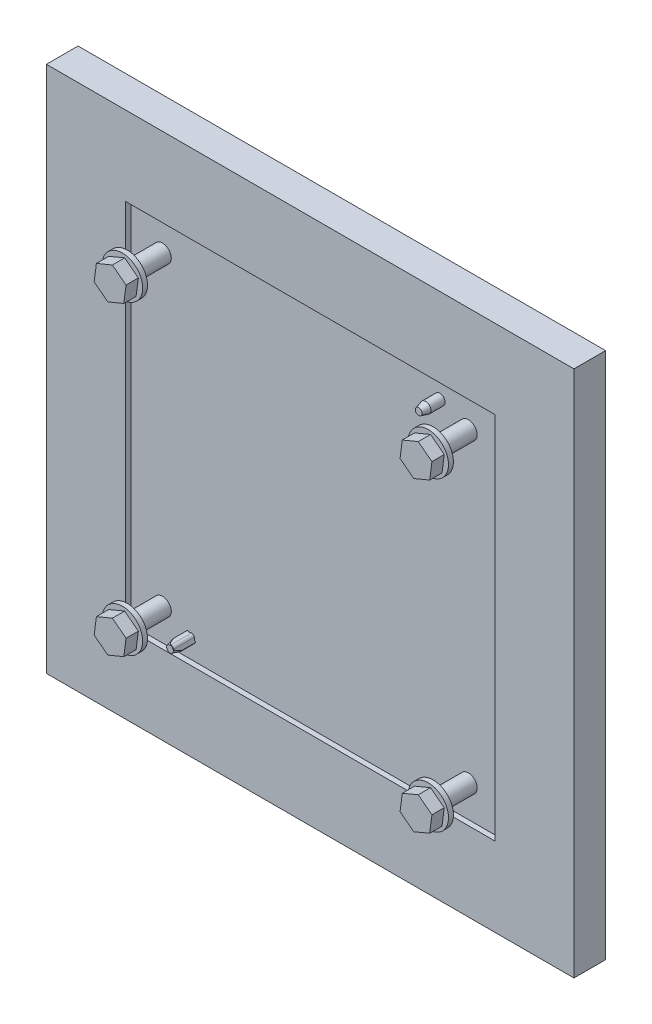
ISO-10303-21;
HEADER;
FILE_DESCRIPTION(('STEP AP214'),'2;1');
FILE_NAME('part.step','',(''),(''),'','','');
FILE_SCHEMA(('AUTOMOTIVE_DESIGN { 1 0 10303 214 1 1 1 1 }'));
ENDSEC;
DATA;
#1=APPLICATION_CONTEXT('core data for automotive mechanical design processes');
#2=APPLICATION_PROTOCOL_DEFINITION('international standard','automotive_design',2000,#1);
#3=PRODUCT_CONTEXT('',#1,'mechanical');
#4=PRODUCT('Part','Part','',(#3));
#5=PRODUCT_RELATED_PRODUCT_CATEGORY('part','',(#4));
#6=PRODUCT_DEFINITION_FORMATION('','',#4);
#7=PRODUCT_DEFINITION_CONTEXT('part definition',#1,'design');
#8=PRODUCT_DEFINITION('design','',#6,#7);
#9=PRODUCT_DEFINITION_SHAPE('','',#8);
#10=(LENGTH_UNIT() NAMED_UNIT(*) SI_UNIT(.MILLI.,.METRE.));
#11=(NAMED_UNIT(*) PLANE_ANGLE_UNIT() SI_UNIT($,.RADIAN.));
#12=(NAMED_UNIT(*) SI_UNIT($,.STERADIAN.) SOLID_ANGLE_UNIT());
#13=UNCERTAINTY_MEASURE_WITH_UNIT(LENGTH_MEASURE(1.E-05),#10,'distance_accuracy_value','');
#14=(GEOMETRIC_REPRESENTATION_CONTEXT(3) GLOBAL_UNCERTAINTY_ASSIGNED_CONTEXT((#13)) GLOBAL_UNIT_ASSIGNED_CONTEXT((#10,
#11,#12)) REPRESENTATION_CONTEXT('',''));
#15=CARTESIAN_POINT('',(0.,0.,0.));
#16=DIRECTION('',(0.,0.,1.));
#17=DIRECTION('',(1.,0.,0.));
#18=AXIS2_PLACEMENT_3D('',#15,#16,#17);
#19=CARTESIAN_POINT('',(-103.829573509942,89.1864093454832,29.8));
#20=DIRECTION('',(0.,0.,1.));
#21=DIRECTION('',(1.,0.,0.));
#22=AXIS2_PLACEMENT_3D('',#19,#20,#21);
#23=PLANE('',#22);
#24=DIRECTION('',(0.130133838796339,0.991496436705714,0.));
#25=VECTOR('',#24,1.);
#26=CARTESIAN_POINT('',(-77.9077855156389,90.7337427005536,29.8));
#27=LINE('',#26,#25);
#28=CARTESIAN_POINT('',(-77.9077855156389,90.7337427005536,29.8));
#29=VERTEX_POINT('',#28);
#30=CARTESIAN_POINT('',(-79.1850432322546,81.0022502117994,29.8));
#31=VERTEX_POINT('',#30);
#32=EDGE_CURVE('E581',#29,#31,#27,.F.);
#33=ORIENTED_EDGE('',*,*,#32,.F.);
#34=DIRECTION('',(-0.793594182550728,0.608447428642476,0.));
#35=VECTOR('',#34,1.);
#36=CARTESIAN_POINT('',(-85.6968763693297,96.7056265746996,29.8));
#37=LINE('',#36,#35);
#38=CARTESIAN_POINT('',(-85.6968763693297,96.7056265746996,29.8));
#39=VERTEX_POINT('',#38);
#40=EDGE_CURVE('E586',#39,#29,#37,.F.);
#41=ORIENTED_EDGE('',*,*,#40,.F.);
#42=DIRECTION('',(-0.923728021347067,-0.383049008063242,0.));
#43=VECTOR('',#42,1.);
#44=CARTESIAN_POINT('',(-94.7632249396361,92.9460179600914,29.8));
#45=LINE('',#44,#43);
#46=CARTESIAN_POINT('',(-94.7632249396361,92.9460179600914,29.8));
#47=VERTEX_POINT('',#46);
#48=EDGE_CURVE('E591',#47,#39,#45,.F.);
#49=ORIENTED_EDGE('',*,*,#48,.F.);
#50=DIRECTION('',(-0.130133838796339,-0.991496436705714,0.));
#51=VECTOR('',#50,1.);
#52=CARTESIAN_POINT('',(-96.0404826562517,83.2145254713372,29.8));
#53=LINE('',#52,#51);
#54=CARTESIAN_POINT('',(-96.0404826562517,83.2145254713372,29.8));
#55=VERTEX_POINT('',#54);
#56=EDGE_CURVE('E596',#55,#47,#53,.F.);
#57=ORIENTED_EDGE('',*,*,#56,.F.);
#58=DIRECTION('',(0.793594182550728,-0.608447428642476,0.));
#59=VECTOR('',#58,1.);
#60=CARTESIAN_POINT('',(-88.251391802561,77.2426415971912,29.8));
#61=LINE('',#60,#59);
#62=CARTESIAN_POINT('',(-88.251391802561,77.2426415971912,29.8));
#63=VERTEX_POINT('',#62);
#64=EDGE_CURVE('E568',#63,#55,#61,.F.);
#65=ORIENTED_EDGE('',*,*,#64,.F.);
#66=DIRECTION('',(0.923728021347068,0.383049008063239,0.));
#67=VECTOR('',#66,1.);
#68=CARTESIAN_POINT('',(-79.1850432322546,81.0022502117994,29.8));
#69=LINE('',#68,#67);
#70=EDGE_CURVE('E576',#31,#63,#69,.F.);
#71=ORIENTED_EDGE('',*,*,#70,.F.);
#72=EDGE_LOOP('',(#33,#41,#49,#57,#65,#71));
#73=FACE_BOUND('',#72,.T.);
#74=ADVANCED_FACE('F17',(#73),#23,.T.);
#75=CARTESIAN_POINT('',(70.1186946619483,89.1864093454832,29.8));
#76=DIRECTION('',(0.,0.,1.));
#77=DIRECTION('',(1.,0.,0.));
#78=AXIS2_PLACEMENT_3D('',#75,#76,#77);
#79=PLANE('',#78);
#80=DIRECTION('',(0.130133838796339,0.991496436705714,0.));
#81=VECTOR('',#80,1.);
#82=CARTESIAN_POINT('',(96.0404826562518,90.7337427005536,29.8));
#83=LINE('',#82,#81);
#84=CARTESIAN_POINT('',(96.0404826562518,90.7337427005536,29.8));
#85=VERTEX_POINT('',#84);
#86=CARTESIAN_POINT('',(94.7632249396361,81.0022502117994,29.8));
#87=VERTEX_POINT('',#86);
#88=EDGE_CURVE('E551',#85,#87,#83,.F.);
#89=ORIENTED_EDGE('',*,*,#88,.F.);
#90=DIRECTION('',(-0.793594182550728,0.608447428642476,0.));
#91=VECTOR('',#90,1.);
#92=CARTESIAN_POINT('',(88.251391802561,96.7056265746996,29.8));
#93=LINE('',#92,#91);
#94=CARTESIAN_POINT('',(88.251391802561,96.7056265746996,29.8));
#95=VERTEX_POINT('',#94);
#96=EDGE_CURVE('E556',#95,#85,#93,.F.);
#97=ORIENTED_EDGE('',*,*,#96,.F.);
#98=DIRECTION('',(-0.923728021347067,-0.383049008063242,0.));
#99=VECTOR('',#98,1.);
#100=CARTESIAN_POINT('',(79.1850432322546,92.9460179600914,29.8));
#101=LINE('',#100,#99);
#102=CARTESIAN_POINT('',(79.1850432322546,92.9460179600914,29.8));
#103=VERTEX_POINT('',#102);
#104=EDGE_CURVE('E561',#103,#95,#101,.F.);
#105=ORIENTED_EDGE('',*,*,#104,.F.);
#106=DIRECTION('',(-0.130133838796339,-0.991496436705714,0.));
#107=VECTOR('',#106,1.);
#108=CARTESIAN_POINT('',(77.907785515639,83.2145254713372,29.8));
#109=LINE('',#108,#107);
#110=CARTESIAN_POINT('',(77.907785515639,83.2145254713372,29.8));
#111=VERTEX_POINT('',#110);
#112=EDGE_CURVE('E566',#111,#103,#109,.F.);
#113=ORIENTED_EDGE('',*,*,#112,.F.);
#114=DIRECTION('',(0.793594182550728,-0.608447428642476,0.));
#115=VECTOR('',#114,1.);
#116=CARTESIAN_POINT('',(85.6968763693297,77.2426415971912,29.8));
#117=LINE('',#116,#115);
#118=CARTESIAN_POINT('',(85.6968763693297,77.2426415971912,29.8));
#119=VERTEX_POINT('',#118);
#120=EDGE_CURVE('E538',#119,#111,#117,.F.);
#121=ORIENTED_EDGE('',*,*,#120,.F.);
#122=DIRECTION('',(0.923728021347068,0.383049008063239,0.));
#123=VECTOR('',#122,1.);
#124=CARTESIAN_POINT('',(94.7632249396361,81.0022502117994,29.8));
#125=LINE('',#124,#123);
#126=EDGE_CURVE('E546',#87,#119,#125,.F.);
#127=ORIENTED_EDGE('',*,*,#126,.F.);
#128=EDGE_LOOP('',(#89,#97,#105,#113,#121,#127));
#129=FACE_BOUND('',#128,.T.);
#130=ADVANCED_FACE('F1241',(#129),#79,.T.);
#131=CARTESIAN_POINT('',(70.1186946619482,-84.7618588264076,29.8));
#132=DIRECTION('',(0.,0.,1.));
#133=DIRECTION('',(1.,0.,0.));
#134=AXIS2_PLACEMENT_3D('',#131,#132,#133);
#135=PLANE('',#134);
#136=DIRECTION('',(0.130133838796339,0.991496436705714,0.));
#137=VECTOR('',#136,1.);
#138=CARTESIAN_POINT('',(96.0404826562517,-83.2145254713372,29.8));
#139=LINE('',#138,#137);
#140=CARTESIAN_POINT('',(96.0404826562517,-83.2145254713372,29.8));
#141=VERTEX_POINT('',#140);
#142=CARTESIAN_POINT('',(94.763224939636,-92.9460179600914,29.8));
#143=VERTEX_POINT('',#142);
#144=EDGE_CURVE('E521',#141,#143,#139,.F.);
#145=ORIENTED_EDGE('',*,*,#144,.F.);
#146=DIRECTION('',(-0.793594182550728,0.608447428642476,0.));
#147=VECTOR('',#146,1.);
#148=CARTESIAN_POINT('',(88.251391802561,-77.2426415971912,29.8));
#149=LINE('',#148,#147);
#150=CARTESIAN_POINT('',(88.251391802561,-77.2426415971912,29.8));
#151=VERTEX_POINT('',#150);
#152=EDGE_CURVE('E526',#151,#141,#149,.F.);
#153=ORIENTED_EDGE('',*,*,#152,.F.);
#154=DIRECTION('',(-0.923728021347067,-0.383049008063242,0.));
#155=VECTOR('',#154,1.);
#156=CARTESIAN_POINT('',(79.1850432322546,-81.0022502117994,29.8));
#157=LINE('',#156,#155);
#158=CARTESIAN_POINT('',(79.1850432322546,-81.0022502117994,29.8));
#159=VERTEX_POINT('',#158);
#160=EDGE_CURVE('E531',#159,#151,#157,.F.);
#161=ORIENTED_EDGE('',*,*,#160,.F.);
#162=DIRECTION('',(-0.130133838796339,-0.991496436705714,0.));
#163=VECTOR('',#162,1.);
#164=CARTESIAN_POINT('',(77.9077855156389,-90.7337427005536,29.8));
#165=LINE('',#164,#163);
#166=CARTESIAN_POINT('',(77.9077855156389,-90.7337427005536,29.8));
#167=VERTEX_POINT('',#166);
#168=EDGE_CURVE('E536',#167,#159,#165,.F.);
#169=ORIENTED_EDGE('',*,*,#168,.F.);
#170=DIRECTION('',(0.793594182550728,-0.608447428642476,0.));
#171=VECTOR('',#170,1.);
#172=CARTESIAN_POINT('',(85.6968763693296,-96.7056265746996,29.8));
#173=LINE('',#172,#171);
#174=CARTESIAN_POINT('',(85.6968763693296,-96.7056265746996,29.8));
#175=VERTEX_POINT('',#174);
#176=EDGE_CURVE('E508',#175,#167,#173,.F.);
#177=ORIENTED_EDGE('',*,*,#176,.F.);
#178=DIRECTION('',(0.923728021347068,0.383049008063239,0.));
#179=VECTOR('',#178,1.);
#180=CARTESIAN_POINT('',(94.763224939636,-92.9460179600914,29.8));
#181=LINE('',#180,#179);
#182=EDGE_CURVE('E516',#143,#175,#181,.F.);
#183=ORIENTED_EDGE('',*,*,#182,.F.);
#184=EDGE_LOOP('',(#145,#153,#161,#169,#177,#183));
#185=FACE_BOUND('',#184,.T.);
#186=ADVANCED_FACE('F1238',(#185),#135,.T.);
#187=CARTESIAN_POINT('',(-103.829573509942,-84.7618588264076,29.8));
#188=DIRECTION('',(0.,0.,1.));
#189=DIRECTION('',(1.,0.,0.));
#190=AXIS2_PLACEMENT_3D('',#187,#188,#189);
#191=PLANE('',#190);
#192=DIRECTION('',(0.130133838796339,0.991496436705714,0.));
#193=VECTOR('',#192,1.);
#194=CARTESIAN_POINT('',(-77.907785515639,-83.2145254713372,29.8));
#195=LINE('',#194,#193);
#196=CARTESIAN_POINT('',(-77.907785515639,-83.2145254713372,29.8));
#197=VERTEX_POINT('',#196);
#198=CARTESIAN_POINT('',(-79.1850432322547,-92.9460179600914,29.8));
#199=VERTEX_POINT('',#198);
#200=EDGE_CURVE('E491',#197,#199,#195,.F.);
#201=ORIENTED_EDGE('',*,*,#200,.F.);
#202=DIRECTION('',(-0.793594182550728,0.608447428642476,0.));
#203=VECTOR('',#202,1.);
#204=CARTESIAN_POINT('',(-85.6968763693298,-77.2426415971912,29.8));
#205=LINE('',#204,#203);
#206=CARTESIAN_POINT('',(-85.6968763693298,-77.2426415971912,29.8));
#207=VERTEX_POINT('',#206);
#208=EDGE_CURVE('E496',#207,#197,#205,.F.);
#209=ORIENTED_EDGE('',*,*,#208,.F.);
#210=DIRECTION('',(-0.923728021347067,-0.383049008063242,0.));
#211=VECTOR('',#210,1.);
#212=CARTESIAN_POINT('',(-94.7632249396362,-81.0022502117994,29.8));
#213=LINE('',#212,#211);
#214=CARTESIAN_POINT('',(-94.7632249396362,-81.0022502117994,29.8));
#215=VERTEX_POINT('',#214);
#216=EDGE_CURVE('E501',#215,#207,#213,.F.);
#217=ORIENTED_EDGE('',*,*,#216,.F.);
#218=DIRECTION('',(-0.130133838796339,-0.991496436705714,0.));
#219=VECTOR('',#218,1.);
#220=CARTESIAN_POINT('',(-96.0404826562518,-90.7337427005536,29.8));
#221=LINE('',#220,#219);
#222=CARTESIAN_POINT('',(-96.0404826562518,-90.7337427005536,29.8));
#223=VERTEX_POINT('',#222);
#224=EDGE_CURVE('E506',#223,#215,#221,.F.);
#225=ORIENTED_EDGE('',*,*,#224,.F.);
#226=DIRECTION('',(0.793594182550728,-0.608447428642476,0.));
#227=VECTOR('',#226,1.);
#228=CARTESIAN_POINT('',(-88.2513918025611,-96.7056265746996,29.8));
#229=LINE('',#228,#227);
#230=CARTESIAN_POINT('',(-88.2513918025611,-96.7056265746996,29.8));
#231=VERTEX_POINT('',#230);
#232=EDGE_CURVE('E478',#231,#223,#229,.F.);
#233=ORIENTED_EDGE('',*,*,#232,.F.);
#234=DIRECTION('',(0.923728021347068,0.383049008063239,0.));
#235=VECTOR('',#234,1.);
#236=CARTESIAN_POINT('',(-79.1850432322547,-92.9460179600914,29.8));
#237=LINE('',#236,#235);
#238=EDGE_CURVE('E486',#199,#231,#237,.F.);
#239=ORIENTED_EDGE('',*,*,#238,.F.);
#240=EDGE_LOOP('',(#201,#209,#217,#225,#233,#239));
#241=FACE_BOUND('',#240,.T.);
#242=ADVANCED_FACE('F1234',(#241),#191,.T.);
#243=CARTESIAN_POINT('',(-96.0404826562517,83.2145254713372,29.8));
#244=DIRECTION('',(-0.991496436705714,0.130133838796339,0.));
#245=DIRECTION('',(-0.130133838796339,-0.991496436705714,0.));
#246=AXIS2_PLACEMENT_3D('',#243,#244,#245);
#247=PLANE('',#246);
#248=DIRECTION('',(0.13013383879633,0.991496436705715,0.));
#249=VECTOR('',#248,1.);
#250=CARTESIAN_POINT('',(-96.0404826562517,83.2145254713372,22.8));
#251=LINE('',#250,#249);
#252=CARTESIAN_POINT('',(-96.0404826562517,83.2145254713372,22.8));
#253=VERTEX_POINT('',#252);
#254=CARTESIAN_POINT('',(-94.7632249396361,92.9460179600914,22.8));
#255=VERTEX_POINT('',#254);
#256=EDGE_CURVE('E476',#253,#255,#251,.T.);
#257=ORIENTED_EDGE('',*,*,#256,.F.);
#258=DIRECTION('',(0.,0.,1.));
#259=VECTOR('',#258,1.);
#260=CARTESIAN_POINT('',(-96.0404826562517,83.2145254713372,29.8));
#261=LINE('',#260,#259);
#262=EDGE_CURVE('E574',#55,#253,#261,.F.);
#263=ORIENTED_EDGE('',*,*,#262,.F.);
#264=ORIENTED_EDGE('',*,*,#56,.T.);
#265=DIRECTION('',(0.,0.,1.));
#266=VECTOR('',#265,1.);
#267=CARTESIAN_POINT('',(-94.7632249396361,92.9460179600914,29.8));
#268=LINE('',#267,#266);
#269=EDGE_CURVE('E593',#255,#47,#268,.T.);
#270=ORIENTED_EDGE('',*,*,#269,.F.);
#271=EDGE_LOOP('',(#257,#263,#264,#270));
#272=FACE_BOUND('',#271,.T.);
#273=ADVANCED_FACE('F1230',(#272),#247,.T.);
#274=CARTESIAN_POINT('',(-94.7632249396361,92.9460179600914,29.8));
#275=DIRECTION('',(-0.383049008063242,0.923728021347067,0.));
#276=DIRECTION('',(-0.923728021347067,-0.383049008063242,0.));
#277=AXIS2_PLACEMENT_3D('',#274,#275,#276);
#278=PLANE('',#277);
#279=ORIENTED_EDGE('',*,*,#269,.T.);
#280=ORIENTED_EDGE('',*,*,#48,.T.);
#281=DIRECTION('',(0.,0.,1.));
#282=VECTOR('',#281,1.);
#283=CARTESIAN_POINT('',(-85.6968763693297,96.7056265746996,29.8));
#284=LINE('',#283,#282);
#285=CARTESIAN_POINT('',(-85.6968763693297,96.7056265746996,22.8));
#286=VERTEX_POINT('',#285);
#287=EDGE_CURVE('E588',#286,#39,#284,.T.);
#288=ORIENTED_EDGE('',*,*,#287,.F.);
#289=DIRECTION('',(0.923728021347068,0.383049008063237,0.));
#290=VECTOR('',#289,1.);
#291=CARTESIAN_POINT('',(-94.7632249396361,92.9460179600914,22.8));
#292=LINE('',#291,#290);
#293=EDGE_CURVE('E474',#255,#286,#292,.T.);
#294=ORIENTED_EDGE('',*,*,#293,.F.);
#295=EDGE_LOOP('',(#279,#280,#288,#294));
#296=FACE_BOUND('',#295,.T.);
#297=ADVANCED_FACE('F1226',(#296),#278,.T.);
#298=CARTESIAN_POINT('',(-85.6968763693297,96.7056265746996,29.8));
#299=DIRECTION('',(0.608447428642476,0.793594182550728,0.));
#300=DIRECTION('',(-0.793594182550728,0.608447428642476,0.));
#301=AXIS2_PLACEMENT_3D('',#298,#299,#300);
#302=PLANE('',#301);
#303=ORIENTED_EDGE('',*,*,#287,.T.);
#304=ORIENTED_EDGE('',*,*,#40,.T.);
#305=DIRECTION('',(0.,0.,1.));
#306=VECTOR('',#305,1.);
#307=CARTESIAN_POINT('',(-77.9077855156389,90.7337427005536,29.8));
#308=LINE('',#307,#306);
#309=CARTESIAN_POINT('',(-77.9077855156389,90.7337427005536,22.8));
#310=VERTEX_POINT('',#309);
#311=EDGE_CURVE('E583',#310,#29,#308,.T.);
#312=ORIENTED_EDGE('',*,*,#311,.F.);
#313=DIRECTION('',(0.79359418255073,-0.608447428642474,0.));
#314=VECTOR('',#313,1.);
#315=CARTESIAN_POINT('',(-85.6968763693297,96.7056265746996,22.8));
#316=LINE('',#315,#314);
#317=EDGE_CURVE('E472',#286,#310,#316,.T.);
#318=ORIENTED_EDGE('',*,*,#317,.F.);
#319=EDGE_LOOP('',(#303,#304,#312,#318));
#320=FACE_BOUND('',#319,.T.);
#321=ADVANCED_FACE('F1222',(#320),#302,.T.);
#322=CARTESIAN_POINT('',(-77.9077855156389,90.7337427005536,29.8));
#323=DIRECTION('',(0.991496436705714,-0.130133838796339,0.));
#324=DIRECTION('',(0.130133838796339,0.991496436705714,0.));
#325=AXIS2_PLACEMENT_3D('',#322,#323,#324);
#326=PLANE('',#325);
#327=ORIENTED_EDGE('',*,*,#311,.T.);
#328=ORIENTED_EDGE('',*,*,#32,.T.);
#329=DIRECTION('',(0.,0.,1.));
#330=VECTOR('',#329,1.);
#331=CARTESIAN_POINT('',(-79.1850432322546,81.0022502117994,29.8));
#332=LINE('',#331,#330);
#333=CARTESIAN_POINT('',(-79.1850432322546,81.0022502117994,22.8));
#334=VERTEX_POINT('',#333);
#335=EDGE_CURVE('E578',#334,#31,#332,.T.);
#336=ORIENTED_EDGE('',*,*,#335,.F.);
#337=DIRECTION('',(-0.13013383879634,-0.991496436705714,0.));
#338=VECTOR('',#337,1.);
#339=CARTESIAN_POINT('',(-77.9077855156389,90.7337427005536,22.8));
#340=LINE('',#339,#338);
#341=EDGE_CURVE('E470',#310,#334,#340,.T.);
#342=ORIENTED_EDGE('',*,*,#341,.F.);
#343=EDGE_LOOP('',(#327,#328,#336,#342));
#344=FACE_BOUND('',#343,.T.);
#345=ADVANCED_FACE('F1218',(#344),#326,.T.);
#346=CARTESIAN_POINT('',(-79.1850432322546,81.0022502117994,29.8));
#347=DIRECTION('',(0.383049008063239,-0.923728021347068,0.));
#348=DIRECTION('',(0.923728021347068,0.383049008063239,0.));
#349=AXIS2_PLACEMENT_3D('',#346,#347,#348);
#350=PLANE('',#349);
#351=ORIENTED_EDGE('',*,*,#335,.T.);
#352=ORIENTED_EDGE('',*,*,#70,.T.);
#353=DIRECTION('',(0.,0.,1.));
#354=VECTOR('',#353,1.);
#355=CARTESIAN_POINT('',(-88.251391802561,77.2426415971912,29.8));
#356=LINE('',#355,#354);
#357=CARTESIAN_POINT('',(-88.251391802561,77.2426415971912,22.8));
#358=VERTEX_POINT('',#357);
#359=EDGE_CURVE('E571',#358,#63,#356,.T.);
#360=ORIENTED_EDGE('',*,*,#359,.F.);
#361=DIRECTION('',(-0.923728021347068,-0.383049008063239,0.));
#362=VECTOR('',#361,1.);
#363=CARTESIAN_POINT('',(-79.1850432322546,81.0022502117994,22.8));
#364=LINE('',#363,#362);
#365=EDGE_CURVE('E468',#334,#358,#364,.T.);
#366=ORIENTED_EDGE('',*,*,#365,.F.);
#367=EDGE_LOOP('',(#351,#352,#360,#366));
#368=FACE_BOUND('',#367,.T.);
#369=ADVANCED_FACE('F1214',(#368),#350,.T.);
#370=CARTESIAN_POINT('',(-88.251391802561,77.2426415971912,29.8));
#371=DIRECTION('',(-0.608447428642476,-0.793594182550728,0.));
#372=DIRECTION('',(0.793594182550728,-0.608447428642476,0.));
#373=AXIS2_PLACEMENT_3D('',#370,#371,#372);
#374=PLANE('',#373);
#375=ORIENTED_EDGE('',*,*,#359,.T.);
#376=ORIENTED_EDGE('',*,*,#64,.T.);
#377=ORIENTED_EDGE('',*,*,#262,.T.);
#378=DIRECTION('',(-0.793594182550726,0.608447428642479,0.));
#379=VECTOR('',#378,1.);
#380=CARTESIAN_POINT('',(-88.251391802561,77.2426415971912,22.8));
#381=LINE('',#380,#379);
#382=EDGE_CURVE('E465',#358,#253,#381,.T.);
#383=ORIENTED_EDGE('',*,*,#382,.F.);
#384=EDGE_LOOP('',(#375,#376,#377,#383));
#385=FACE_BOUND('',#384,.T.);
#386=ADVANCED_FACE('F1210',(#385),#374,.T.);
#387=CARTESIAN_POINT('',(77.907785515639,83.2145254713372,29.8));
#388=DIRECTION('',(-0.991496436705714,0.130133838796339,0.));
#389=DIRECTION('',(-0.130133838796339,-0.991496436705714,0.));
#390=AXIS2_PLACEMENT_3D('',#387,#388,#389);
#391=PLANE('',#390);
#392=DIRECTION('',(0.13013383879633,0.991496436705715,0.));
#393=VECTOR('',#392,1.);
#394=CARTESIAN_POINT('',(77.907785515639,83.2145254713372,22.8));
#395=LINE('',#394,#393);
#396=CARTESIAN_POINT('',(77.907785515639,83.2145254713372,22.8));
#397=VERTEX_POINT('',#396);
#398=CARTESIAN_POINT('',(79.1850432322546,92.9460179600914,22.8));
#399=VERTEX_POINT('',#398);
#400=EDGE_CURVE('E463',#397,#399,#395,.T.);
#401=ORIENTED_EDGE('',*,*,#400,.F.);
#402=DIRECTION('',(0.,0.,1.));
#403=VECTOR('',#402,1.);
#404=CARTESIAN_POINT('',(77.907785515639,83.2145254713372,29.8));
#405=LINE('',#404,#403);
#406=EDGE_CURVE('E544',#111,#397,#405,.F.);
#407=ORIENTED_EDGE('',*,*,#406,.F.);
#408=ORIENTED_EDGE('',*,*,#112,.T.);
#409=DIRECTION('',(0.,0.,1.));
#410=VECTOR('',#409,1.);
#411=CARTESIAN_POINT('',(79.1850432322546,92.9460179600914,29.8));
#412=LINE('',#411,#410);
#413=EDGE_CURVE('E563',#399,#103,#412,.T.);
#414=ORIENTED_EDGE('',*,*,#413,.F.);
#415=EDGE_LOOP('',(#401,#407,#408,#414));
#416=FACE_BOUND('',#415,.T.);
#417=ADVANCED_FACE('F1206',(#416),#391,.T.);
#418=CARTESIAN_POINT('',(79.1850432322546,92.9460179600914,29.8));
#419=DIRECTION('',(-0.383049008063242,0.923728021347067,0.));
#420=DIRECTION('',(-0.923728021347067,-0.383049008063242,0.));
#421=AXIS2_PLACEMENT_3D('',#418,#419,#420);
#422=PLANE('',#421);
#423=ORIENTED_EDGE('',*,*,#413,.T.);
#424=ORIENTED_EDGE('',*,*,#104,.T.);
#425=DIRECTION('',(0.,0.,1.));
#426=VECTOR('',#425,1.);
#427=CARTESIAN_POINT('',(88.251391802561,96.7056265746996,29.8));
#428=LINE('',#427,#426);
#429=CARTESIAN_POINT('',(88.251391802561,96.7056265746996,22.8));
#430=VERTEX_POINT('',#429);
#431=EDGE_CURVE('E558',#430,#95,#428,.T.);
#432=ORIENTED_EDGE('',*,*,#431,.F.);
#433=DIRECTION('',(0.923728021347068,0.383049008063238,0.));
#434=VECTOR('',#433,1.);
#435=CARTESIAN_POINT('',(79.1850432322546,92.9460179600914,22.8));
#436=LINE('',#435,#434);
#437=EDGE_CURVE('E461',#399,#430,#436,.T.);
#438=ORIENTED_EDGE('',*,*,#437,.F.);
#439=EDGE_LOOP('',(#423,#424,#432,#438));
#440=FACE_BOUND('',#439,.T.);
#441=ADVANCED_FACE('F1202',(#440),#422,.T.);
#442=CARTESIAN_POINT('',(88.251391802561,96.7056265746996,29.8));
#443=DIRECTION('',(0.608447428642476,0.793594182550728,0.));
#444=DIRECTION('',(-0.793594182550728,0.608447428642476,0.));
#445=AXIS2_PLACEMENT_3D('',#442,#443,#444);
#446=PLANE('',#445);
#447=ORIENTED_EDGE('',*,*,#431,.T.);
#448=ORIENTED_EDGE('',*,*,#96,.T.);
#449=DIRECTION('',(0.,0.,1.));
#450=VECTOR('',#449,1.);
#451=CARTESIAN_POINT('',(96.0404826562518,90.7337427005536,29.8));
#452=LINE('',#451,#450);
#453=CARTESIAN_POINT('',(96.0404826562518,90.7337427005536,22.8));
#454=VERTEX_POINT('',#453);
#455=EDGE_CURVE('E553',#454,#85,#452,.T.);
#456=ORIENTED_EDGE('',*,*,#455,.F.);
#457=DIRECTION('',(0.793594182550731,-0.608447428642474,0.));
#458=VECTOR('',#457,1.);
#459=CARTESIAN_POINT('',(88.251391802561,96.7056265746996,22.8));
#460=LINE('',#459,#458);
#461=EDGE_CURVE('E459',#430,#454,#460,.T.);
#462=ORIENTED_EDGE('',*,*,#461,.F.);
#463=EDGE_LOOP('',(#447,#448,#456,#462));
#464=FACE_BOUND('',#463,.T.);
#465=ADVANCED_FACE('F1198',(#464),#446,.T.);
#466=CARTESIAN_POINT('',(96.0404826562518,90.7337427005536,29.8));
#467=DIRECTION('',(0.991496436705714,-0.130133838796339,0.));
#468=DIRECTION('',(0.130133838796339,0.991496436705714,0.));
#469=AXIS2_PLACEMENT_3D('',#466,#467,#468);
#470=PLANE('',#469);
#471=ORIENTED_EDGE('',*,*,#455,.T.);
#472=ORIENTED_EDGE('',*,*,#88,.T.);
#473=DIRECTION('',(0.,0.,1.));
#474=VECTOR('',#473,1.);
#475=CARTESIAN_POINT('',(94.7632249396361,81.0022502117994,29.8));
#476=LINE('',#475,#474);
#477=CARTESIAN_POINT('',(94.7632249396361,81.0022502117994,22.8));
#478=VERTEX_POINT('',#477);
#479=EDGE_CURVE('E548',#478,#87,#476,.T.);
#480=ORIENTED_EDGE('',*,*,#479,.F.);
#481=DIRECTION('',(-0.13013383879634,-0.991496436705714,0.));
#482=VECTOR('',#481,1.);
#483=CARTESIAN_POINT('',(96.0404826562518,90.7337427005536,22.8));
#484=LINE('',#483,#482);
#485=EDGE_CURVE('E457',#454,#478,#484,.T.);
#486=ORIENTED_EDGE('',*,*,#485,.F.);
#487=EDGE_LOOP('',(#471,#472,#480,#486));
#488=FACE_BOUND('',#487,.T.);
#489=ADVANCED_FACE('F1194',(#488),#470,.T.);
#490=CARTESIAN_POINT('',(94.7632249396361,81.0022502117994,29.8));
#491=DIRECTION('',(0.383049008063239,-0.923728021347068,0.));
#492=DIRECTION('',(0.923728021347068,0.383049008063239,0.));
#493=AXIS2_PLACEMENT_3D('',#490,#491,#492);
#494=PLANE('',#493);
#495=ORIENTED_EDGE('',*,*,#479,.T.);
#496=ORIENTED_EDGE('',*,*,#126,.T.);
#497=DIRECTION('',(0.,0.,1.));
#498=VECTOR('',#497,1.);
#499=CARTESIAN_POINT('',(85.6968763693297,77.2426415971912,29.8));
#500=LINE('',#499,#498);
#501=CARTESIAN_POINT('',(85.6968763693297,77.2426415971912,22.8));
#502=VERTEX_POINT('',#501);
#503=EDGE_CURVE('E541',#502,#119,#500,.T.);
#504=ORIENTED_EDGE('',*,*,#503,.F.);
#505=DIRECTION('',(-0.923728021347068,-0.383049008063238,0.));
#506=VECTOR('',#505,1.);
#507=CARTESIAN_POINT('',(94.7632249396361,81.0022502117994,22.8));
#508=LINE('',#507,#506);
#509=EDGE_CURVE('E455',#478,#502,#508,.T.);
#510=ORIENTED_EDGE('',*,*,#509,.F.);
#511=EDGE_LOOP('',(#495,#496,#504,#510));
#512=FACE_BOUND('',#511,.T.);
#513=ADVANCED_FACE('F1190',(#512),#494,.T.);
#514=CARTESIAN_POINT('',(85.6968763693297,77.2426415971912,29.8));
#515=DIRECTION('',(-0.608447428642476,-0.793594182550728,0.));
#516=DIRECTION('',(0.793594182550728,-0.608447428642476,0.));
#517=AXIS2_PLACEMENT_3D('',#514,#515,#516);
#518=PLANE('',#517);
#519=ORIENTED_EDGE('',*,*,#503,.T.);
#520=ORIENTED_EDGE('',*,*,#120,.T.);
#521=ORIENTED_EDGE('',*,*,#406,.T.);
#522=DIRECTION('',(-0.793594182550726,0.60844742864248,0.));
#523=VECTOR('',#522,1.);
#524=CARTESIAN_POINT('',(85.6968763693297,77.2426415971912,22.8));
#525=LINE('',#524,#523);
#526=EDGE_CURVE('E452',#502,#397,#525,.T.);
#527=ORIENTED_EDGE('',*,*,#526,.F.);
#528=EDGE_LOOP('',(#519,#520,#521,#527));
#529=FACE_BOUND('',#528,.T.);
#530=ADVANCED_FACE('F1186',(#529),#518,.T.);
#531=CARTESIAN_POINT('',(77.9077855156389,-90.7337427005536,29.8));
#532=DIRECTION('',(-0.991496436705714,0.130133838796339,0.));
#533=DIRECTION('',(-0.130133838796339,-0.991496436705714,0.));
#534=AXIS2_PLACEMENT_3D('',#531,#532,#533);
#535=PLANE('',#534);
#536=DIRECTION('',(0.13013383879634,0.991496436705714,0.));
#537=VECTOR('',#536,1.);
#538=CARTESIAN_POINT('',(77.9077855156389,-90.7337427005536,22.8));
#539=LINE('',#538,#537);
#540=CARTESIAN_POINT('',(77.9077855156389,-90.7337427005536,22.8));
#541=VERTEX_POINT('',#540);
#542=CARTESIAN_POINT('',(79.1850432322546,-81.0022502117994,22.8));
#543=VERTEX_POINT('',#542);
#544=EDGE_CURVE('E450',#541,#543,#539,.T.);
#545=ORIENTED_EDGE('',*,*,#544,.F.);
#546=DIRECTION('',(0.,0.,1.));
#547=VECTOR('',#546,1.);
#548=CARTESIAN_POINT('',(77.9077855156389,-90.7337427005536,29.8));
#549=LINE('',#548,#547);
#550=EDGE_CURVE('E514',#167,#541,#549,.F.);
#551=ORIENTED_EDGE('',*,*,#550,.F.);
#552=ORIENTED_EDGE('',*,*,#168,.T.);
#553=DIRECTION('',(0.,0.,1.));
#554=VECTOR('',#553,1.);
#555=CARTESIAN_POINT('',(79.1850432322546,-81.0022502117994,29.8));
#556=LINE('',#555,#554);
#557=EDGE_CURVE('E533',#543,#159,#556,.T.);
#558=ORIENTED_EDGE('',*,*,#557,.F.);
#559=EDGE_LOOP('',(#545,#551,#552,#558));
#560=FACE_BOUND('',#559,.T.);
#561=ADVANCED_FACE('F1182',(#560),#535,.T.);
#562=CARTESIAN_POINT('',(79.1850432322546,-81.0022502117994,29.8));
#563=DIRECTION('',(-0.383049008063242,0.923728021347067,0.));
#564=DIRECTION('',(-0.923728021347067,-0.383049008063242,0.));
#565=AXIS2_PLACEMENT_3D('',#562,#563,#564);
#566=PLANE('',#565);
#567=ORIENTED_EDGE('',*,*,#557,.T.);
#568=ORIENTED_EDGE('',*,*,#160,.T.);
#569=DIRECTION('',(0.,0.,1.));
#570=VECTOR('',#569,1.);
#571=CARTESIAN_POINT('',(88.251391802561,-77.2426415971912,29.8));
#572=LINE('',#571,#570);
#573=CARTESIAN_POINT('',(88.251391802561,-77.2426415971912,22.8));
#574=VERTEX_POINT('',#573);
#575=EDGE_CURVE('E528',#574,#151,#572,.T.);
#576=ORIENTED_EDGE('',*,*,#575,.F.);
#577=DIRECTION('',(0.923728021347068,0.383049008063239,0.));
#578=VECTOR('',#577,1.);
#579=CARTESIAN_POINT('',(79.1850432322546,-81.0022502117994,22.8));
#580=LINE('',#579,#578);
#581=EDGE_CURVE('E448',#543,#574,#580,.T.);
#582=ORIENTED_EDGE('',*,*,#581,.F.);
#583=EDGE_LOOP('',(#567,#568,#576,#582));
#584=FACE_BOUND('',#583,.T.);
#585=ADVANCED_FACE('F1178',(#584),#566,.T.);
#586=CARTESIAN_POINT('',(88.251391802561,-77.2426415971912,29.8));
#587=DIRECTION('',(0.608447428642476,0.793594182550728,0.));
#588=DIRECTION('',(-0.793594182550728,0.608447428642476,0.));
#589=AXIS2_PLACEMENT_3D('',#586,#587,#588);
#590=PLANE('',#589);
#591=ORIENTED_EDGE('',*,*,#575,.T.);
#592=ORIENTED_EDGE('',*,*,#152,.T.);
#593=DIRECTION('',(0.,0.,1.));
#594=VECTOR('',#593,1.);
#595=CARTESIAN_POINT('',(96.0404826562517,-83.2145254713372,29.8));
#596=LINE('',#595,#594);
#597=CARTESIAN_POINT('',(96.0404826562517,-83.2145254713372,22.8));
#598=VERTEX_POINT('',#597);
#599=EDGE_CURVE('E523',#598,#141,#596,.T.);
#600=ORIENTED_EDGE('',*,*,#599,.F.);
#601=DIRECTION('',(0.793594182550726,-0.608447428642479,0.));
#602=VECTOR('',#601,1.);
#603=CARTESIAN_POINT('',(88.251391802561,-77.2426415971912,22.8));
#604=LINE('',#603,#602);
#605=EDGE_CURVE('E446',#574,#598,#604,.T.);
#606=ORIENTED_EDGE('',*,*,#605,.F.);
#607=EDGE_LOOP('',(#591,#592,#600,#606));
#608=FACE_BOUND('',#607,.T.);
#609=ADVANCED_FACE('F1174',(#608),#590,.T.);
#610=CARTESIAN_POINT('',(96.0404826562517,-83.2145254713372,29.8));
#611=DIRECTION('',(0.991496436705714,-0.130133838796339,0.));
#612=DIRECTION('',(0.130133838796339,0.991496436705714,0.));
#613=AXIS2_PLACEMENT_3D('',#610,#611,#612);
#614=PLANE('',#613);
#615=ORIENTED_EDGE('',*,*,#599,.T.);
#616=ORIENTED_EDGE('',*,*,#144,.T.);
#617=DIRECTION('',(0.,0.,1.));
#618=VECTOR('',#617,1.);
#619=CARTESIAN_POINT('',(94.763224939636,-92.9460179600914,29.8));
#620=LINE('',#619,#618);
#621=CARTESIAN_POINT('',(94.763224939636,-92.9460179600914,22.8));
#622=VERTEX_POINT('',#621);
#623=EDGE_CURVE('E518',#622,#143,#620,.T.);
#624=ORIENTED_EDGE('',*,*,#623,.F.);
#625=DIRECTION('',(-0.130133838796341,-0.991496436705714,0.));
#626=VECTOR('',#625,1.);
#627=CARTESIAN_POINT('',(96.0404826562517,-83.2145254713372,22.8));
#628=LINE('',#627,#626);
#629=EDGE_CURVE('E444',#598,#622,#628,.T.);
#630=ORIENTED_EDGE('',*,*,#629,.F.);
#631=EDGE_LOOP('',(#615,#616,#624,#630));
#632=FACE_BOUND('',#631,.T.);
#633=ADVANCED_FACE('F1170',(#632),#614,.T.);
#634=CARTESIAN_POINT('',(94.763224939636,-92.9460179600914,29.8));
#635=DIRECTION('',(0.383049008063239,-0.923728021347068,0.));
#636=DIRECTION('',(0.923728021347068,0.383049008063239,0.));
#637=AXIS2_PLACEMENT_3D('',#634,#635,#636);
#638=PLANE('',#637);
#639=ORIENTED_EDGE('',*,*,#623,.T.);
#640=ORIENTED_EDGE('',*,*,#182,.T.);
#641=DIRECTION('',(0.,0.,1.));
#642=VECTOR('',#641,1.);
#643=CARTESIAN_POINT('',(85.6968763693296,-96.7056265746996,29.8));
#644=LINE('',#643,#642);
#645=CARTESIAN_POINT('',(85.6968763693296,-96.7056265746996,22.8));
#646=VERTEX_POINT('',#645);
#647=EDGE_CURVE('E511',#646,#175,#644,.T.);
#648=ORIENTED_EDGE('',*,*,#647,.F.);
#649=DIRECTION('',(-0.923728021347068,-0.383049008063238,0.));
#650=VECTOR('',#649,1.);
#651=CARTESIAN_POINT('',(94.763224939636,-92.9460179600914,22.8));
#652=LINE('',#651,#650);
#653=EDGE_CURVE('E442',#622,#646,#652,.T.);
#654=ORIENTED_EDGE('',*,*,#653,.F.);
#655=EDGE_LOOP('',(#639,#640,#648,#654));
#656=FACE_BOUND('',#655,.T.);
#657=ADVANCED_FACE('F1166',(#656),#638,.T.);
#658=CARTESIAN_POINT('',(85.6968763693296,-96.7056265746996,29.8));
#659=DIRECTION('',(-0.608447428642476,-0.793594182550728,0.));
#660=DIRECTION('',(0.793594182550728,-0.608447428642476,0.));
#661=AXIS2_PLACEMENT_3D('',#658,#659,#660);
#662=PLANE('',#661);
#663=ORIENTED_EDGE('',*,*,#647,.T.);
#664=ORIENTED_EDGE('',*,*,#176,.T.);
#665=ORIENTED_EDGE('',*,*,#550,.T.);
#666=DIRECTION('',(-0.793594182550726,0.608447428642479,0.));
#667=VECTOR('',#666,1.);
#668=CARTESIAN_POINT('',(85.6968763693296,-96.7056265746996,22.8));
#669=LINE('',#668,#667);
#670=EDGE_CURVE('E439',#646,#541,#669,.T.);
#671=ORIENTED_EDGE('',*,*,#670,.F.);
#672=EDGE_LOOP('',(#663,#664,#665,#671));
#673=FACE_BOUND('',#672,.T.);
#674=ADVANCED_FACE('F1162',(#673),#662,.T.);
#675=CARTESIAN_POINT('',(-96.0404826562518,-90.7337427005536,29.8));
#676=DIRECTION('',(-0.991496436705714,0.130133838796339,0.));
#677=DIRECTION('',(-0.130133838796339,-0.991496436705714,0.));
#678=AXIS2_PLACEMENT_3D('',#675,#676,#677);
#679=PLANE('',#678);
#680=DIRECTION('',(0.13013383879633,0.991496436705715,0.));
#681=VECTOR('',#680,1.);
#682=CARTESIAN_POINT('',(-96.0404826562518,-90.7337427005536,22.8));
#683=LINE('',#682,#681);
#684=CARTESIAN_POINT('',(-96.0404826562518,-90.7337427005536,22.8));
#685=VERTEX_POINT('',#684);
#686=CARTESIAN_POINT('',(-94.7632249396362,-81.0022502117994,22.8));
#687=VERTEX_POINT('',#686);
#688=EDGE_CURVE('E437',#685,#687,#683,.T.);
#689=ORIENTED_EDGE('',*,*,#688,.F.);
#690=DIRECTION('',(0.,0.,1.));
#691=VECTOR('',#690,1.);
#692=CARTESIAN_POINT('',(-96.0404826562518,-90.7337427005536,29.8));
#693=LINE('',#692,#691);
#694=EDGE_CURVE('E484',#223,#685,#693,.F.);
#695=ORIENTED_EDGE('',*,*,#694,.F.);
#696=ORIENTED_EDGE('',*,*,#224,.T.);
#697=DIRECTION('',(0.,0.,1.));
#698=VECTOR('',#697,1.);
#699=CARTESIAN_POINT('',(-94.7632249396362,-81.0022502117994,29.8));
#700=LINE('',#699,#698);
#701=EDGE_CURVE('E503',#687,#215,#700,.T.);
#702=ORIENTED_EDGE('',*,*,#701,.F.);
#703=EDGE_LOOP('',(#689,#695,#696,#702));
#704=FACE_BOUND('',#703,.T.);
#705=ADVANCED_FACE('F1158',(#704),#679,.T.);
#706=CARTESIAN_POINT('',(-94.7632249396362,-81.0022502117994,29.8));
#707=DIRECTION('',(-0.383049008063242,0.923728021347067,0.));
#708=DIRECTION('',(-0.923728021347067,-0.383049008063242,0.));
#709=AXIS2_PLACEMENT_3D('',#706,#707,#708);
#710=PLANE('',#709);
#711=ORIENTED_EDGE('',*,*,#701,.T.);
#712=ORIENTED_EDGE('',*,*,#216,.T.);
#713=DIRECTION('',(0.,0.,1.));
#714=VECTOR('',#713,1.);
#715=CARTESIAN_POINT('',(-85.6968763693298,-77.2426415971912,29.8));
#716=LINE('',#715,#714);
#717=CARTESIAN_POINT('',(-85.6968763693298,-77.2426415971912,22.8));
#718=VERTEX_POINT('',#717);
#719=EDGE_CURVE('E498',#718,#207,#716,.T.);
#720=ORIENTED_EDGE('',*,*,#719,.F.);
#721=DIRECTION('',(0.923728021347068,0.383049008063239,0.));
#722=VECTOR('',#721,1.);
#723=CARTESIAN_POINT('',(-94.7632249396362,-81.0022502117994,22.8));
#724=LINE('',#723,#722);
#725=EDGE_CURVE('E435',#687,#718,#724,.T.);
#726=ORIENTED_EDGE('',*,*,#725,.F.);
#727=EDGE_LOOP('',(#711,#712,#720,#726));
#728=FACE_BOUND('',#727,.T.);
#729=ADVANCED_FACE('F1154',(#728),#710,.T.);
#730=CARTESIAN_POINT('',(-85.6968763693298,-77.2426415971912,29.8));
#731=DIRECTION('',(0.608447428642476,0.793594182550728,0.));
#732=DIRECTION('',(-0.793594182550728,0.608447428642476,0.));
#733=AXIS2_PLACEMENT_3D('',#730,#731,#732);
#734=PLANE('',#733);
#735=ORIENTED_EDGE('',*,*,#719,.T.);
#736=ORIENTED_EDGE('',*,*,#208,.T.);
#737=DIRECTION('',(0.,0.,1.));
#738=VECTOR('',#737,1.);
#739=CARTESIAN_POINT('',(-77.907785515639,-83.2145254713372,29.8));
#740=LINE('',#739,#738);
#741=CARTESIAN_POINT('',(-77.907785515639,-83.2145254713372,22.8));
#742=VERTEX_POINT('',#741);
#743=EDGE_CURVE('E493',#742,#197,#740,.T.);
#744=ORIENTED_EDGE('',*,*,#743,.F.);
#745=DIRECTION('',(0.79359418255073,-0.608447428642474,0.));
#746=VECTOR('',#745,1.);
#747=CARTESIAN_POINT('',(-85.6968763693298,-77.2426415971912,22.8));
#748=LINE('',#747,#746);
#749=EDGE_CURVE('E433',#718,#742,#748,.T.);
#750=ORIENTED_EDGE('',*,*,#749,.F.);
#751=EDGE_LOOP('',(#735,#736,#744,#750));
#752=FACE_BOUND('',#751,.T.);
#753=ADVANCED_FACE('F1150',(#752),#734,.T.);
#754=CARTESIAN_POINT('',(-77.907785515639,-83.2145254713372,29.8));
#755=DIRECTION('',(0.991496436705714,-0.130133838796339,0.));
#756=DIRECTION('',(0.130133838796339,0.991496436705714,0.));
#757=AXIS2_PLACEMENT_3D('',#754,#755,#756);
#758=PLANE('',#757);
#759=ORIENTED_EDGE('',*,*,#743,.T.);
#760=ORIENTED_EDGE('',*,*,#200,.T.);
#761=DIRECTION('',(0.,0.,1.));
#762=VECTOR('',#761,1.);
#763=CARTESIAN_POINT('',(-79.1850432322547,-92.9460179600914,29.8));
#764=LINE('',#763,#762);
#765=CARTESIAN_POINT('',(-79.1850432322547,-92.9460179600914,22.8));
#766=VERTEX_POINT('',#765);
#767=EDGE_CURVE('E488',#766,#199,#764,.T.);
#768=ORIENTED_EDGE('',*,*,#767,.F.);
#769=DIRECTION('',(-0.13013383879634,-0.991496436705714,0.));
#770=VECTOR('',#769,1.);
#771=CARTESIAN_POINT('',(-77.907785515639,-83.2145254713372,22.8));
#772=LINE('',#771,#770);
#773=EDGE_CURVE('E431',#742,#766,#772,.T.);
#774=ORIENTED_EDGE('',*,*,#773,.F.);
#775=EDGE_LOOP('',(#759,#760,#768,#774));
#776=FACE_BOUND('',#775,.T.);
#777=ADVANCED_FACE('F1146',(#776),#758,.T.);
#778=CARTESIAN_POINT('',(-79.1850432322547,-92.9460179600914,29.8));
#779=DIRECTION('',(0.383049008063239,-0.923728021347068,0.));
#780=DIRECTION('',(0.923728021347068,0.383049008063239,0.));
#781=AXIS2_PLACEMENT_3D('',#778,#779,#780);
#782=PLANE('',#781);
#783=ORIENTED_EDGE('',*,*,#767,.T.);
#784=ORIENTED_EDGE('',*,*,#238,.T.);
#785=DIRECTION('',(0.,0.,1.));
#786=VECTOR('',#785,1.);
#787=CARTESIAN_POINT('',(-88.2513918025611,-96.7056265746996,29.8));
#788=LINE('',#787,#786);
#789=CARTESIAN_POINT('',(-88.2513918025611,-96.7056265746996,22.8));
#790=VERTEX_POINT('',#789);
#791=EDGE_CURVE('E481',#790,#231,#788,.T.);
#792=ORIENTED_EDGE('',*,*,#791,.F.);
#793=DIRECTION('',(-0.923728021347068,-0.383049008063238,0.));
#794=VECTOR('',#793,1.);
#795=CARTESIAN_POINT('',(-79.1850432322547,-92.9460179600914,22.8));
#796=LINE('',#795,#794);
#797=EDGE_CURVE('E429',#766,#790,#796,.T.);
#798=ORIENTED_EDGE('',*,*,#797,.F.);
#799=EDGE_LOOP('',(#783,#784,#792,#798));
#800=FACE_BOUND('',#799,.T.);
#801=ADVANCED_FACE('F1142',(#800),#782,.T.);
#802=CARTESIAN_POINT('',(-88.2513918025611,-96.7056265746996,29.8));
#803=DIRECTION('',(-0.608447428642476,-0.793594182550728,0.));
#804=DIRECTION('',(0.793594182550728,-0.608447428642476,0.));
#805=AXIS2_PLACEMENT_3D('',#802,#803,#804);
#806=PLANE('',#805);
#807=ORIENTED_EDGE('',*,*,#791,.T.);
#808=ORIENTED_EDGE('',*,*,#232,.T.);
#809=ORIENTED_EDGE('',*,*,#694,.T.);
#810=DIRECTION('',(-0.793594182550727,0.608447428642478,0.));
#811=VECTOR('',#810,1.);
#812=CARTESIAN_POINT('',(-88.2513918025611,-96.7056265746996,22.8));
#813=LINE('',#812,#811);
#814=EDGE_CURVE('E425',#790,#685,#813,.T.);
#815=ORIENTED_EDGE('',*,*,#814,.F.);
#816=EDGE_LOOP('',(#807,#808,#809,#815));
#817=FACE_BOUND('',#816,.T.);
#818=ADVANCED_FACE('F1138',(#817),#806,.T.);
#819=CARTESIAN_POINT('',(-86.9741340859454,86.9741340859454,22.8));
#820=DIRECTION('',(0.,0.,1.));
#821=DIRECTION('',(1.,0.,0.));
#822=AXIS2_PLACEMENT_3D('',#819,#820,#821);
#823=PLANE('',#822);
#824=CARTESIAN_POINT('',(-86.9741340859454,86.9741340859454,22.8));
#825=DIRECTION('',(0.,0.,-1.));
#826=DIRECTION('',(-1.,0.,0.));
#827=AXIS2_PLACEMENT_3D('',#824,#825,#826);
#828=CIRCLE('',#827,11.5);
#829=CARTESIAN_POINT('',(-98.4741340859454,86.9741340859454,22.8));
#830=VERTEX_POINT('',#829);
#831=EDGE_CURVE('E428',#830,#830,#828,.T.);
#832=ORIENTED_EDGE('',*,*,#831,.F.);
#833=EDGE_LOOP('',(#832));
#834=FACE_BOUND('',#833,.T.);
#835=ORIENTED_EDGE('',*,*,#365,.T.);
#836=ORIENTED_EDGE('',*,*,#382,.T.);
#837=ORIENTED_EDGE('',*,*,#256,.T.);
#838=ORIENTED_EDGE('',*,*,#293,.T.);
#839=ORIENTED_EDGE('',*,*,#317,.T.);
#840=ORIENTED_EDGE('',*,*,#341,.T.);
#841=EDGE_LOOP('',(#835,#836,#837,#838,#839,#840));
#842=FACE_BOUND('',#841,.T.);
#843=ADVANCED_FACE('F1134',(#834,#842),#823,.T.);
#844=CARTESIAN_POINT('',(86.9741340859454,86.9741340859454,22.8));
#845=DIRECTION('',(0.,0.,1.));
#846=DIRECTION('',(1.,0.,0.));
#847=AXIS2_PLACEMENT_3D('',#844,#845,#846);
#848=PLANE('',#847);
#849=CARTESIAN_POINT('',(86.9741340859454,86.9741340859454,22.8));
#850=DIRECTION('',(0.,0.,-1.));
#851=DIRECTION('',(-1.,0.,0.));
#852=AXIS2_PLACEMENT_3D('',#849,#850,#851);
#853=CIRCLE('',#852,11.5);
#854=CARTESIAN_POINT('',(75.4741340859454,86.9741340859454,22.8));
#855=VERTEX_POINT('',#854);
#856=EDGE_CURVE('E1015',#855,#855,#853,.T.);
#857=ORIENTED_EDGE('',*,*,#856,.F.);
#858=EDGE_LOOP('',(#857));
#859=FACE_BOUND('',#858,.T.);
#860=ORIENTED_EDGE('',*,*,#509,.T.);
#861=ORIENTED_EDGE('',*,*,#526,.T.);
#862=ORIENTED_EDGE('',*,*,#400,.T.);
#863=ORIENTED_EDGE('',*,*,#437,.T.);
#864=ORIENTED_EDGE('',*,*,#461,.T.);
#865=ORIENTED_EDGE('',*,*,#485,.T.);
#866=EDGE_LOOP('',(#860,#861,#862,#863,#864,#865));
#867=FACE_BOUND('',#866,.T.);
#868=ADVANCED_FACE('F1130',(#859,#867),#848,.T.);
#869=CARTESIAN_POINT('',(86.9741340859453,-86.9741340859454,22.8));
#870=DIRECTION('',(0.,0.,1.));
#871=DIRECTION('',(1.,0.,0.));
#872=AXIS2_PLACEMENT_3D('',#869,#870,#871);
#873=PLANE('',#872);
#874=CARTESIAN_POINT('',(86.9741340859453,-86.9741340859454,22.8));
#875=DIRECTION('',(0.,0.,1.));
#876=DIRECTION('',(1.,0.,0.));
#877=AXIS2_PLACEMENT_3D('',#874,#875,#876);
#878=CIRCLE('',#877,11.5);
#879=CARTESIAN_POINT('',(98.4741340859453,-86.9741340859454,22.8));
#880=VERTEX_POINT('',#879);
#881=EDGE_CURVE('E1018',#880,#880,#878,.F.);
#882=ORIENTED_EDGE('',*,*,#881,.F.);
#883=EDGE_LOOP('',(#882));
#884=FACE_BOUND('',#883,.T.);
#885=ORIENTED_EDGE('',*,*,#653,.T.);
#886=ORIENTED_EDGE('',*,*,#670,.T.);
#887=ORIENTED_EDGE('',*,*,#544,.T.);
#888=ORIENTED_EDGE('',*,*,#581,.T.);
#889=ORIENTED_EDGE('',*,*,#605,.T.);
#890=ORIENTED_EDGE('',*,*,#629,.T.);
#891=EDGE_LOOP('',(#885,#886,#887,#888,#889,#890));
#892=FACE_BOUND('',#891,.T.);
#893=ADVANCED_FACE('F1126',(#884,#892),#873,.T.);
#894=CARTESIAN_POINT('',(-86.9741340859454,-86.9741340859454,22.8));
#895=DIRECTION('',(0.,0.,1.));
#896=DIRECTION('',(1.,0.,0.));
#897=AXIS2_PLACEMENT_3D('',#894,#895,#896);
#898=PLANE('',#897);
#899=CARTESIAN_POINT('',(-86.9741340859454,-86.9741340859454,22.8));
#900=DIRECTION('',(0.,0.,1.));
#901=DIRECTION('',(1.,0.,0.));
#902=AXIS2_PLACEMENT_3D('',#899,#900,#901);
#903=CIRCLE('',#902,11.5);
#904=CARTESIAN_POINT('',(-75.4741340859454,-86.9741340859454,22.8));
#905=VERTEX_POINT('',#904);
#906=EDGE_CURVE('E1021',#905,#905,#903,.F.);
#907=ORIENTED_EDGE('',*,*,#906,.F.);
#908=EDGE_LOOP('',(#907));
#909=FACE_BOUND('',#908,.T.);
#910=ORIENTED_EDGE('',*,*,#797,.T.);
#911=ORIENTED_EDGE('',*,*,#814,.T.);
#912=ORIENTED_EDGE('',*,*,#688,.T.);
#913=ORIENTED_EDGE('',*,*,#725,.T.);
#914=ORIENTED_EDGE('',*,*,#749,.T.);
#915=ORIENTED_EDGE('',*,*,#773,.T.);
#916=EDGE_LOOP('',(#910,#911,#912,#913,#914,#915));
#917=FACE_BOUND('',#916,.T.);
#918=ADVANCED_FACE('F1122',(#909,#917),#898,.T.);
#919=CARTESIAN_POINT('',(-86.9741340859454,86.9741340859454,22.8));
#920=DIRECTION('',(0.,0.,-1.));
#921=DIRECTION('',(-1.,0.,0.));
#922=AXIS2_PLACEMENT_3D('',#919,#920,#921);
#923=CYLINDRICAL_SURFACE('',#922,11.5);
#924=ORIENTED_EDGE('',*,*,#831,.T.);
#925=EDGE_LOOP('',(#924));
#926=FACE_BOUND('',#925,.T.);
#927=CARTESIAN_POINT('',(-86.9741340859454,86.9741340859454,20.));
#928=DIRECTION('',(0.,0.,-1.));
#929=DIRECTION('',(-1.,0.,0.));
#930=AXIS2_PLACEMENT_3D('',#927,#928,#929);
#931=CIRCLE('',#930,11.5);
#932=CARTESIAN_POINT('',(-98.4741340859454,86.9741340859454,20.));
#933=VERTEX_POINT('',#932);
#934=EDGE_CURVE('E1024',#933,#933,#931,.T.);
#935=ORIENTED_EDGE('',*,*,#934,.F.);
#936=EDGE_LOOP('',(#935));
#937=FACE_BOUND('',#936,.T.);
#938=ADVANCED_FACE('F1118',(#926,#937),#923,.T.);
#939=CARTESIAN_POINT('',(86.9741340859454,86.9741340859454,22.8));
#940=DIRECTION('',(0.,0.,-1.));
#941=DIRECTION('',(-1.,0.,0.));
#942=AXIS2_PLACEMENT_3D('',#939,#940,#941);
#943=CYLINDRICAL_SURFACE('',#942,11.5);
#944=ORIENTED_EDGE('',*,*,#856,.T.);
#945=EDGE_LOOP('',(#944));
#946=FACE_BOUND('',#945,.T.);
#947=CARTESIAN_POINT('',(86.9741340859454,86.9741340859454,20.));
#948=DIRECTION('',(0.,0.,-1.));
#949=DIRECTION('',(-1.,0.,0.));
#950=AXIS2_PLACEMENT_3D('',#947,#948,#949);
#951=CIRCLE('',#950,11.5);
#952=CARTESIAN_POINT('',(75.4741340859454,86.9741340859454,20.));
#953=VERTEX_POINT('',#952);
#954=EDGE_CURVE('E1027',#953,#953,#951,.T.);
#955=ORIENTED_EDGE('',*,*,#954,.F.);
#956=EDGE_LOOP('',(#955));
#957=FACE_BOUND('',#956,.T.);
#958=ADVANCED_FACE('F1114',(#946,#957),#943,.T.);
#959=CARTESIAN_POINT('',(86.9741340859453,-86.9741340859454,20.));
#960=DIRECTION('',(0.,0.,1.));
#961=DIRECTION('',(1.,0.,0.));
#962=AXIS2_PLACEMENT_3D('',#959,#960,#961);
#963=CYLINDRICAL_SURFACE('',#962,11.5);
#964=CARTESIAN_POINT('',(86.9741340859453,-86.9741340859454,20.));
#965=DIRECTION('',(0.,0.,1.));
#966=DIRECTION('',(1.,0.,0.));
#967=AXIS2_PLACEMENT_3D('',#964,#965,#966);
#968=CIRCLE('',#967,11.5);
#969=CARTESIAN_POINT('',(98.4741340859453,-86.9741340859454,20.));
#970=VERTEX_POINT('',#969);
#971=EDGE_CURVE('E1030',#970,#970,#968,.F.);
#972=ORIENTED_EDGE('',*,*,#971,.F.);
#973=EDGE_LOOP('',(#972));
#974=FACE_BOUND('',#973,.T.);
#975=ORIENTED_EDGE('',*,*,#881,.T.);
#976=EDGE_LOOP('',(#975));
#977=FACE_BOUND('',#976,.T.);
#978=ADVANCED_FACE('F1110',(#974,#977),#963,.T.);
#979=CARTESIAN_POINT('',(-86.9741340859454,-86.9741340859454,20.));
#980=DIRECTION('',(0.,0.,1.));
#981=DIRECTION('',(1.,0.,0.));
#982=AXIS2_PLACEMENT_3D('',#979,#980,#981);
#983=CYLINDRICAL_SURFACE('',#982,11.5);
#984=CARTESIAN_POINT('',(-86.9741340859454,-86.9741340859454,20.));
#985=DIRECTION('',(0.,0.,1.));
#986=DIRECTION('',(1.,0.,0.));
#987=AXIS2_PLACEMENT_3D('',#984,#985,#986);
#988=CIRCLE('',#987,11.5);
#989=CARTESIAN_POINT('',(-75.4741340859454,-86.9741340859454,20.));
#990=VERTEX_POINT('',#989);
#991=EDGE_CURVE('E1033',#990,#990,#988,.F.);
#992=ORIENTED_EDGE('',*,*,#991,.F.);
#993=EDGE_LOOP('',(#992));
#994=FACE_BOUND('',#993,.T.);
#995=ORIENTED_EDGE('',*,*,#906,.T.);
#996=EDGE_LOOP('',(#995));
#997=FACE_BOUND('',#996,.T.);
#998=ADVANCED_FACE('F1106',(#994,#997),#983,.T.);
#999=CARTESIAN_POINT('',(-86.9741340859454,86.9741340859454,20.));
#1000=DIRECTION('',(0.,0.,-1.));
#1001=DIRECTION('',(-1.,0.,0.));
#1002=AXIS2_PLACEMENT_3D('',#999,#1000,#1001);
#1003=PLANE('',#1002);
#1004=ORIENTED_EDGE('',*,*,#934,.T.);
#1005=EDGE_LOOP('',(#1004));
#1006=FACE_BOUND('',#1005,.T.);
#1007=CARTESIAN_POINT('',(-86.9741340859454,86.9741340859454,20.));
#1008=DIRECTION('',(0.,0.,1.));
#1009=DIRECTION('',(1.,0.,0.));
#1010=AXIS2_PLACEMENT_3D('',#1007,#1008,#1009);
#1011=CIRCLE('',#1010,5.25);
#1012=CARTESIAN_POINT('',(-81.7241340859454,86.9741340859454,20.));
#1013=VERTEX_POINT('',#1012);
#1014=EDGE_CURVE('E1036',#1013,#1013,#1011,.T.);
#1015=ORIENTED_EDGE('',*,*,#1014,.T.);
#1016=EDGE_LOOP('',(#1015));
#1017=FACE_BOUND('',#1016,.T.);
#1018=ADVANCED_FACE('F1102',(#1006,#1017),#1003,.T.);
#1019=CARTESIAN_POINT('',(86.9741340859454,86.9741340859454,20.));
#1020=DIRECTION('',(0.,0.,-1.));
#1021=DIRECTION('',(-1.,0.,0.));
#1022=AXIS2_PLACEMENT_3D('',#1019,#1020,#1021);
#1023=PLANE('',#1022);
#1024=ORIENTED_EDGE('',*,*,#954,.T.);
#1025=EDGE_LOOP('',(#1024));
#1026=FACE_BOUND('',#1025,.T.);
#1027=CARTESIAN_POINT('',(86.9741340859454,86.9741340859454,20.));
#1028=DIRECTION('',(0.,0.,1.));
#1029=DIRECTION('',(1.,0.,0.));
#1030=AXIS2_PLACEMENT_3D('',#1027,#1028,#1029);
#1031=CIRCLE('',#1030,5.25);
#1032=CARTESIAN_POINT('',(92.2241340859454,86.9741340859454,20.));
#1033=VERTEX_POINT('',#1032);
#1034=EDGE_CURVE('E1039',#1033,#1033,#1031,.T.);
#1035=ORIENTED_EDGE('',*,*,#1034,.T.);
#1036=EDGE_LOOP('',(#1035));
#1037=FACE_BOUND('',#1036,.T.);
#1038=ADVANCED_FACE('F1098',(#1026,#1037),#1023,.T.);
#1039=CARTESIAN_POINT('',(86.9741340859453,-86.9741340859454,20.));
#1040=DIRECTION('',(0.,0.,-1.));
#1041=DIRECTION('',(-1.,0.,0.));
#1042=AXIS2_PLACEMENT_3D('',#1039,#1040,#1041);
#1043=PLANE('',#1042);
#1044=ORIENTED_EDGE('',*,*,#971,.T.);
#1045=EDGE_LOOP('',(#1044));
#1046=FACE_BOUND('',#1045,.T.);
#1047=CARTESIAN_POINT('',(86.9741340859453,-86.9741340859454,20.));
#1048=DIRECTION('',(0.,0.,-1.));
#1049=DIRECTION('',(-1.,0.,0.));
#1050=AXIS2_PLACEMENT_3D('',#1047,#1048,#1049);
#1051=CIRCLE('',#1050,5.25);
#1052=CARTESIAN_POINT('',(81.7241340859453,-86.9741340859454,20.));
#1053=VERTEX_POINT('',#1052);
#1054=EDGE_CURVE('E1042',#1053,#1053,#1051,.F.);
#1055=ORIENTED_EDGE('',*,*,#1054,.T.);
#1056=EDGE_LOOP('',(#1055));
#1057=FACE_BOUND('',#1056,.T.);
#1058=ADVANCED_FACE('F1094',(#1046,#1057),#1043,.T.);
#1059=CARTESIAN_POINT('',(-86.9741340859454,-86.9741340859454,20.));
#1060=DIRECTION('',(0.,0.,-1.));
#1061=DIRECTION('',(-1.,0.,0.));
#1062=AXIS2_PLACEMENT_3D('',#1059,#1060,#1061);
#1063=PLANE('',#1062);
#1064=ORIENTED_EDGE('',*,*,#991,.T.);
#1065=EDGE_LOOP('',(#1064));
#1066=FACE_BOUND('',#1065,.T.);
#1067=CARTESIAN_POINT('',(-86.9741340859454,-86.9741340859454,20.));
#1068=DIRECTION('',(0.,0.,-1.));
#1069=DIRECTION('',(-1.,0.,0.));
#1070=AXIS2_PLACEMENT_3D('',#1067,#1068,#1069);
#1071=CIRCLE('',#1070,5.25);
#1072=CARTESIAN_POINT('',(-92.2241340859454,-86.9741340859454,20.));
#1073=VERTEX_POINT('',#1072);
#1074=EDGE_CURVE('E310',#1073,#1073,#1071,.F.);
#1075=ORIENTED_EDGE('',*,*,#1074,.T.);
#1076=EDGE_LOOP('',(#1075));
#1077=FACE_BOUND('',#1076,.T.);
#1078=ADVANCED_FACE('F1090',(#1066,#1077),#1063,.T.);
#1079=CARTESIAN_POINT('',(-70.7132652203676,-93.8396724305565,12.));
#1080=DIRECTION('',(0.,0.,-1.));
#1081=DIRECTION('',(-1.,0.,0.));
#1082=AXIS2_PLACEMENT_3D('',#1079,#1080,#1081);
#1083=PLANE('',#1082);
#1084=CARTESIAN_POINT('',(-70.7132652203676,-93.8396724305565,12.0000000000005));
#1085=DIRECTION('',(0.,0.,-1.));
#1086=DIRECTION('',(-1.,0.,0.));
#1087=AXIS2_PLACEMENT_3D('',#1084,#1085,#1086);
#1088=CIRCLE('',#1087,1.92820323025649);
#1089=CARTESIAN_POINT('',(-72.6414684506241,-93.8396724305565,12.0000000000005));
#1090=VERTEX_POINT('',#1089);
#1091=EDGE_CURVE('E424',#1090,#1090,#1088,.T.);
#1092=ORIENTED_EDGE('',*,*,#1091,.F.);
#1093=EDGE_LOOP('',(#1092));
#1094=FACE_BOUND('',#1093,.T.);
#1095=ADVANCED_FACE('F1086',(#1094),#1083,.F.);
#1096=CARTESIAN_POINT('',(-86.9741340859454,86.9741340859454,20.));
#1097=DIRECTION('',(0.,0.,1.));
#1098=DIRECTION('',(1.,0.,0.));
#1099=AXIS2_PLACEMENT_3D('',#1096,#1097,#1098);
#1100=CYLINDRICAL_SURFACE('',#1099,5.25);
#1101=ORIENTED_EDGE('',*,*,#1014,.F.);
#1102=EDGE_LOOP('',(#1101));
#1103=FACE_BOUND('',#1102,.T.);
#1104=CARTESIAN_POINT('',(-86.9741340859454,86.9741340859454,22.8));
#1105=DIRECTION('',(0.,0.,1.));
#1106=DIRECTION('',(1.,0.,0.));
#1107=AXIS2_PLACEMENT_3D('',#1104,#1105,#1106);
#1108=CIRCLE('',#1107,5.25);
#1109=CARTESIAN_POINT('',(-81.7241340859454,86.9741340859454,22.8));
#1110=VERTEX_POINT('',#1109);
#1111=EDGE_CURVE('E1049',#1110,#1110,#1108,.T.);
#1112=ORIENTED_EDGE('',*,*,#1111,.T.);
#1113=EDGE_LOOP('',(#1112));
#1114=FACE_BOUND('',#1113,.T.);
#1115=ADVANCED_FACE('F1082',(#1103,#1114),#1100,.F.);
#1116=CARTESIAN_POINT('',(86.9741340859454,86.9741340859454,20.));
#1117=DIRECTION('',(0.,0.,1.));
#1118=DIRECTION('',(1.,0.,0.));
#1119=AXIS2_PLACEMENT_3D('',#1116,#1117,#1118);
#1120=CYLINDRICAL_SURFACE('',#1119,5.25);
#1121=ORIENTED_EDGE('',*,*,#1034,.F.);
#1122=EDGE_LOOP('',(#1121));
#1123=FACE_BOUND('',#1122,.T.);
#1124=CARTESIAN_POINT('',(86.9741340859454,86.9741340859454,22.8));
#1125=DIRECTION('',(0.,0.,1.));
#1126=DIRECTION('',(1.,0.,0.));
#1127=AXIS2_PLACEMENT_3D('',#1124,#1125,#1126);
#1128=CIRCLE('',#1127,5.25);
#1129=CARTESIAN_POINT('',(92.2241340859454,86.9741340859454,22.8));
#1130=VERTEX_POINT('',#1129);
#1131=EDGE_CURVE('E1052',#1130,#1130,#1128,.T.);
#1132=ORIENTED_EDGE('',*,*,#1131,.T.);
#1133=EDGE_LOOP('',(#1132));
#1134=FACE_BOUND('',#1133,.T.);
#1135=ADVANCED_FACE('F1078',(#1123,#1134),#1120,.F.);
#1136=CARTESIAN_POINT('',(86.9741340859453,-86.9741340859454,22.8));
#1137=DIRECTION('',(0.,0.,-1.));
#1138=DIRECTION('',(-1.,0.,0.));
#1139=AXIS2_PLACEMENT_3D('',#1136,#1137,#1138);
#1140=CYLINDRICAL_SURFACE('',#1139,5.25);
#1141=CARTESIAN_POINT('',(86.9741340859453,-86.9741340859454,22.8));
#1142=DIRECTION('',(0.,0.,-1.));
#1143=DIRECTION('',(-1.,0.,0.));
#1144=AXIS2_PLACEMENT_3D('',#1141,#1142,#1143);
#1145=CIRCLE('',#1144,5.25);
#1146=CARTESIAN_POINT('',(81.7241340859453,-86.9741340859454,22.8));
#1147=VERTEX_POINT('',#1146);
#1148=EDGE_CURVE('E1055',#1147,#1147,#1145,.F.);
#1149=ORIENTED_EDGE('',*,*,#1148,.T.);
#1150=EDGE_LOOP('',(#1149));
#1151=FACE_BOUND('',#1150,.T.);
#1152=ORIENTED_EDGE('',*,*,#1054,.F.);
#1153=EDGE_LOOP('',(#1152));
#1154=FACE_BOUND('',#1153,.T.);
#1155=ADVANCED_FACE('F1073',(#1151,#1154),#1140,.F.);
#1156=CARTESIAN_POINT('',(-86.9741340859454,-86.9741340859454,22.8));
#1157=DIRECTION('',(0.,0.,-1.));
#1158=DIRECTION('',(-1.,0.,0.));
#1159=AXIS2_PLACEMENT_3D('',#1156,#1157,#1158);
#1160=CYLINDRICAL_SURFACE('',#1159,5.25);
#1161=CARTESIAN_POINT('',(-86.9741340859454,-86.9741340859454,22.8));
#1162=DIRECTION('',(0.,0.,-1.));
#1163=DIRECTION('',(-1.,0.,0.));
#1164=AXIS2_PLACEMENT_3D('',#1161,#1162,#1163);
#1165=CIRCLE('',#1164,5.25);
#1166=CARTESIAN_POINT('',(-92.2241340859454,-86.9741340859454,22.8));
#1167=VERTEX_POINT('',#1166);
#1168=EDGE_CURVE('E1057',#1167,#1167,#1165,.F.);
#1169=ORIENTED_EDGE('',*,*,#1168,.T.);
#1170=EDGE_LOOP('',(#1169));
#1171=FACE_BOUND('',#1170,.T.);
#1172=ORIENTED_EDGE('',*,*,#1074,.F.);
#1173=EDGE_LOOP('',(#1172));
#1174=FACE_BOUND('',#1173,.T.);
#1175=ADVANCED_FACE('F1068',(#1171,#1174),#1160,.F.);
#1176=CARTESIAN_POINT('',(70.7132652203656,93.839672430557,12.));
#1177=DIRECTION('',(0.,0.,-1.));
#1178=DIRECTION('',(-1.,0.,0.));
#1179=AXIS2_PLACEMENT_3D('',#1176,#1177,#1178);
#1180=PLANE('',#1179);
#1181=CARTESIAN_POINT('',(70.7132652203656,93.839672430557,11.9999999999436));
#1182=DIRECTION('',(0.,0.,-1.));
#1183=DIRECTION('',(-1.,0.,0.));
#1184=AXIS2_PLACEMENT_3D('',#1181,#1182,#1183);
#1185=CIRCLE('',#1184,1.92820323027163);
#1186=CARTESIAN_POINT('',(68.785061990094,93.839672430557,11.9999999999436));
#1187=VERTEX_POINT('',#1186);
#1188=EDGE_CURVE('E390',#1187,#1187,#1185,.T.);
#1189=ORIENTED_EDGE('',*,*,#1188,.F.);
#1190=EDGE_LOOP('',(#1189));
#1191=FACE_BOUND('',#1190,.T.);
#1192=ADVANCED_FACE('F1066',(#1191),#1180,.F.);
#1193=CARTESIAN_POINT('',(-70.7132652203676,-93.8396724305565,-6.));
#1194=DIRECTION('',(0.,0.,-1.));
#1195=DIRECTION('',(-1.,0.,0.));
#1196=AXIS2_PLACEMENT_3D('',#1193,#1194,#1195);
#1197=CYLINDRICAL_SURFACE('',#1196,3.);
#1198=CARTESIAN_POINT('',(-70.7132652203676,-93.8396724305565,0.));
#1199=DIRECTION('',(0.,0.,-1.));
#1200=DIRECTION('',(-1.,0.,0.));
#1201=AXIS2_PLACEMENT_3D('',#1198,#1199,#1200);
#1202=CIRCLE('',#1201,3.);
#1203=CARTESIAN_POINT('',(-68.6700056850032,-96.0362812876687,0.));
#1204=VERTEX_POINT('',#1203);
#1205=CARTESIAN_POINT('',(-68.06155825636,-95.2426871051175,0.));
#1206=VERTEX_POINT('',#1205);
#1207=EDGE_CURVE('E302',#1204,#1206,#1202,.F.);
#1208=ORIENTED_EDGE('',*,*,#1207,.T.);
#1209=DIRECTION('',(0.,0.,1.));
#1210=VECTOR('',#1209,1.);
#1211=CARTESIAN_POINT('',(-68.06155825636,-95.2426871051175,13.));
#1212=LINE('',#1211,#1210);
#1213=CARTESIAN_POINT('',(-68.0615582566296,-95.242687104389,7.99999999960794));
#1214=VERTEX_POINT('',#1213);
#1215=EDGE_CURVE('E337',#1206,#1214,#1212,.T.);
#1216=ORIENTED_EDGE('',*,*,#1215,.T.);
#1217=CARTESIAN_POINT('',(-70.7132652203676,-93.8396724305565,7.99999999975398));
#1218=DIRECTION('',(0.,0.,-1.));
#1219=DIRECTION('',(0.608447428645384,0.793594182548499,0.));
#1220=AXIS2_PLACEMENT_3D('',#1217,#1218,#1219);
#1221=CIRCLE('',#1220,2.99999999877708);
#1222=CARTESIAN_POINT('',(-68.6700056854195,-96.0362812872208,7.99999999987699));
#1223=VERTEX_POINT('',#1222);
#1224=EDGE_CURVE('E309',#1223,#1214,#1221,.F.);
#1225=ORIENTED_EDGE('',*,*,#1224,.F.);
#1226=DIRECTION('',(0.,0.,1.));
#1227=VECTOR('',#1226,1.);
#1228=CARTESIAN_POINT('',(-68.6700056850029,-96.0362812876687,13.));
#1229=LINE('',#1228,#1227);
#1230=EDGE_CURVE('E289',#1223,#1204,#1229,.F.);
#1231=ORIENTED_EDGE('',*,*,#1230,.T.);
#1232=EDGE_LOOP('',(#1208,#1216,#1225,#1231));
#1233=FACE_BOUND('',#1232,.T.);
#1234=ADVANCED_FACE('F312',(#1233),#1197,.T.);
#1235=CARTESIAN_POINT('',(-70.7132652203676,-93.8396724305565,7.99999999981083));
#1236=DIRECTION('',(0.,0.,-1.));
#1237=DIRECTION('',(-1.,0.,0.));
#1238=AXIS2_PLACEMENT_3D('',#1235,#1236,#1237);
#1239=CONICAL_SURFACE('',#1238,2.99999999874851,0.26179938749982);
#1240=ORIENTED_EDGE('',*,*,#1091,.T.);
#1241=EDGE_LOOP('',(#1240));
#1242=FACE_BOUND('',#1241,.T.);
#1243=CARTESIAN_POINT('',(-70.7132652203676,-93.8396724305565,7.99999999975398));
#1244=DIRECTION('',(0.,0.,-1.));
#1245=DIRECTION('',(0.608447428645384,0.793594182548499,0.));
#1246=AXIS2_PLACEMENT_3D('',#1243,#1244,#1245);
#1247=CIRCLE('',#1246,2.99999999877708);
#1248=CARTESIAN_POINT('',(-72.7565247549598,-91.643063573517,7.99999999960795));
#1249=VERTEX_POINT('',#1248);
#1250=CARTESIAN_POINT('',(-73.3649721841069,-92.4366577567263,7.99999999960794));
#1251=VERTEX_POINT('',#1250);
#1252=EDGE_CURVE('E422',#1249,#1251,#1247,.F.);
#1253=ORIENTED_EDGE('',*,*,#1252,.T.);
#1254=CARTESIAN_POINT('',(-73.3649721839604,-92.4366577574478,7.99999999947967));
#1255=CARTESIAN_POINT('',(-73.350292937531,-92.4763272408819,8.11763414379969));
#1256=CARTESIAN_POINT('',(-73.3354553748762,-92.5164245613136,8.23510652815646));
#1257=CARTESIAN_POINT('',(-73.305390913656,-92.5976713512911,8.4696502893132));
#1258=CARTESIAN_POINT('',(-73.2901639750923,-92.6388209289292,8.58672162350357));
#1259=CARTESIAN_POINT('',(-73.2592169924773,-92.7224526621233,8.82061895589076));
#1260=CARTESIAN_POINT('',(-73.2434959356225,-92.7649375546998,8.93744384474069));
#1261=CARTESIAN_POINT('',(-73.2114933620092,-92.8514219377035,9.17045000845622));
#1262=CARTESIAN_POINT('',(-73.1952118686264,-92.8954213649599,9.28663130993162));
#1263=CARTESIAN_POINT('',(-73.1563559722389,-93.0004263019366,9.55717156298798));
#1264=CARTESIAN_POINT('',(-73.1335092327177,-93.0621677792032,9.71120778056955));
#1265=CARTESIAN_POINT('',(-73.0861443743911,-93.1901675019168,10.0169672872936));
#1266=CARTESIAN_POINT('',(-73.061628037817,-93.2564209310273,10.1686928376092));
#1267=CARTESIAN_POINT('',(-73.0184442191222,-93.3731217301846,10.4200795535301));
#1268=CARTESIAN_POINT('',(-73.0004523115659,-93.4217434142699,10.5206959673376));
#1269=CARTESIAN_POINT('',(-72.9628780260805,-93.5232849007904,10.7196888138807));
#1270=CARTESIAN_POINT('',(-72.9432927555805,-93.576212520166,10.8180607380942));
#1271=CARTESIAN_POINT('',(-72.9018089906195,-93.6883190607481,11.0114034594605));
#1272=CARTESIAN_POINT('',(-72.8799008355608,-93.7475240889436,11.1063576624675));
#1273=CARTESIAN_POINT('',(-72.8444865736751,-93.843228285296,11.2431769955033));
#1274=CARTESIAN_POINT('',(-72.8322720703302,-93.8762369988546,11.2877997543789));
#1275=CARTESIAN_POINT('',(-72.8067474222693,-93.9452153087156,11.3743387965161));
#1276=CARTESIAN_POINT('',(-72.7934384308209,-93.9811817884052,11.4162578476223));
#1277=CARTESIAN_POINT('',(-72.7680122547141,-94.0498939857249,11.4886087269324));
#1278=CARTESIAN_POINT('',(-72.7561332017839,-94.0819961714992,11.5197276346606));
#1279=CARTESIAN_POINT('',(-72.7312245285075,-94.1493098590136,11.5780067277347));
#1280=CARTESIAN_POINT('',(-72.7181948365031,-94.1845215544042,11.6051666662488));
#1281=CARTESIAN_POINT('',(-72.6932929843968,-94.2518168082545,11.6491400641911));
#1282=CARTESIAN_POINT('',(-72.6816334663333,-94.2833257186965,11.6669357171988));
#1283=CARTESIAN_POINT('',(-72.6574896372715,-94.3485724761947,11.6968592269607));
#1284=CARTESIAN_POINT('',(-72.6450090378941,-94.3823002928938,11.7090108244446));
#1285=CARTESIAN_POINT('',(-72.6251695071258,-94.4359150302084,11.7222896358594));
#1286=CARTESIAN_POINT('',(-72.6180085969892,-94.4552668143,11.72591656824));
#1287=CARTESIAN_POINT('',(-72.6035565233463,-94.4943223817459,11.7308119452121));
#1288=CARTESIAN_POINT('',(-72.5962649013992,-94.5140274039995,11.7320690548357));
#1289=CARTESIAN_POINT('',(-72.5889652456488,-94.5337541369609,11.7320508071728));
#1290=B_SPLINE_CURVE_WITH_KNOTS('',3,(#1254,#1255,#1256,#1257,#1258,#1259,#1260,#1261,#1262,
#1263,#1264,#1265,#1266,#1267,#1268,#1269,#1270,#1271,#1272,#1273,#1274,#1275,#1276,#1277,#1278,
#1279,#1280,#1281,#1282,#1283,#1284,#1285,#1286,#1287,#1288,#1289),.UNSPECIFIED.,.F.,.F.,(4,2,2,
2,2,2,2,2,2,2,2,2,2,2,2,2,2,4),(0.,0.37502549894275,0.750089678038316,1.12598046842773,
1.50185559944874,2.00434449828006,2.50630517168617,2.84578189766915,3.18588927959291,
3.52747115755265,3.69786857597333,3.86808869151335,4.00667641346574,4.14527277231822,
4.258967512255,4.37217958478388,4.43490483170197,4.49792934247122),.UNSPECIFIED.);
#1291=CARTESIAN_POINT('',(-72.5889652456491,-94.5337541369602,11.73205080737));
#1292=VERTEX_POINT('',#1291);
#1293=EDGE_CURVE('E381',#1251,#1292,#1290,.T.);
#1294=ORIENTED_EDGE('',*,*,#1293,.T.);
#1295=CARTESIAN_POINT('',(-70.7132652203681,-93.8396724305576,11.7320508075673));
#1296=DIRECTION('',(0.,0.,-1.));
#1297=DIRECTION('',(-1.,0.,0.));
#1298=AXIS2_PLACEMENT_3D('',#1295,#1296,#1297);
#1299=CIRCLE('',#1298,2.00000000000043);
#1300=CARTESIAN_POINT('',(-70.8966535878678,-95.8312468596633,11.7320508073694));
#1301=VERTEX_POINT('',#1300);
#1302=EDGE_CURVE('E415',#1301,#1292,#1299,.T.);
#1303=ORIENTED_EDGE('',*,*,#1302,.F.);
#1304=CARTESIAN_POINT('',(-70.8966535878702,-95.8312468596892,11.732050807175));
#1305=CARTESIAN_POINT('',(-70.8605976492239,-95.8345669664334,11.7321851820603));
#1306=CARTESIAN_POINT('',(-70.8247510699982,-95.8378677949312,11.7283860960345));
#1307=CARTESIAN_POINT('',(-70.7549693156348,-95.8442934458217,11.714269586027));
#1308=CARTESIAN_POINT('',(-70.7210117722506,-95.8474203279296,11.7040663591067));
#1309=CARTESIAN_POINT('',(-70.6448130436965,-95.8544368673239,11.6743639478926));
#1310=CARTESIAN_POINT('',(-70.6033359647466,-95.8582561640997,11.6529480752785));
#1311=CARTESIAN_POINT('',(-70.5239394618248,-95.8655671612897,11.6038962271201));
#1312=CARTESIAN_POINT('',(-70.4860500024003,-95.8690561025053,11.5762134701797));
#1313=CARTESIAN_POINT('',(-70.4051583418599,-95.8765047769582,11.5098540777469));
#1314=CARTESIAN_POINT('',(-70.363032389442,-95.8803838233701,11.4701203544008));
#1315=CARTESIAN_POINT('',(-70.2827145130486,-95.8877796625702,11.3867813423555));
#1316=CARTESIAN_POINT('',(-70.24453042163,-95.8912957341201,11.3431686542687));
#1317=CARTESIAN_POINT('',(-70.1710950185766,-95.8980578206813,11.2532116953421));
#1318=CARTESIAN_POINT('',(-70.1358580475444,-95.9013025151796,11.2068557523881));
#1319=CARTESIAN_POINT('',(-70.0678840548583,-95.907561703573,11.1124194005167));
#1320=CARTESIAN_POINT('',(-70.0351446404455,-95.9105764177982,11.0643407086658));
#1321=CARTESIAN_POINT('',(-69.9368000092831,-95.9196321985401,10.9135417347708));
#1322=CARTESIAN_POINT('',(-69.8744849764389,-95.925370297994,10.8086662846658));
#1323=CARTESIAN_POINT('',(-69.7554707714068,-95.9363293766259,10.5957251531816));
#1324=CARTESIAN_POINT('',(-69.6987761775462,-95.9415499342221,10.4876569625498));
#1325=CARTESIAN_POINT('',(-69.5893073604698,-95.9516300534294,10.2692321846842));
#1326=CARTESIAN_POINT('',(-69.5365425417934,-95.9564887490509,10.1588708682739));
#1327=CARTESIAN_POINT('',(-69.4340390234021,-95.965927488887,9.93673770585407));
#1328=CARTESIAN_POINT('',(-69.3843006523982,-95.9705075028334,9.82496570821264));
#1329=CARTESIAN_POINT('',(-69.2871719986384,-95.9794513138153,9.60040960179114));
#1330=CARTESIAN_POINT('',(-69.2397815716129,-95.9838151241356,9.48762555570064));
#1331=CARTESIAN_POINT('',(-69.1468660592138,-95.9923709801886,9.26127805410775));
#1332=CARTESIAN_POINT('',(-69.1013411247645,-95.9965630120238,9.14771453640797));
#1333=CARTESIAN_POINT('',(-68.9671337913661,-96.0089211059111,8.80640484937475));
#1334=CARTESIAN_POINT('',(-68.8807025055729,-96.016879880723,8.57776517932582));
#1335=CARTESIAN_POINT('',(-68.7750298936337,-96.0266104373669,8.29035956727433));
#1336=CARTESIAN_POINT('',(-68.7538356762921,-96.0285620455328,8.23230471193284));
#1337=CARTESIAN_POINT('',(-68.7117245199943,-96.0324397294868,8.11618067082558));
#1338=CARTESIAN_POINT('',(-68.6908072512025,-96.0343658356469,8.05811160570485));
#1339=CARTESIAN_POINT('',(-68.6700056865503,-96.0362812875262,7.99999999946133));
#1340=B_SPLINE_CURVE_WITH_KNOTS('',3,(#1304,#1305,#1306,#1307,#1308,#1309,#1310,#1311,#1312,
#1313,#1314,#1315,#1316,#1317,#1318,#1319,#1320,#1321,#1322,#1323,#1324,#1325,#1326,#1327,#1328,
#1329,#1330,#1331,#1332,#1333,#1334,#1335,#1336,#1337,#1338,#1339),.UNSPECIFIED.,.F.,.F.,(4,2,2,
2,2,2,2,2,2,2,2,2,2,2,2,2,2,4),(0.,0.108091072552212,0.214307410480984,0.35401440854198,
0.494800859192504,0.668508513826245,0.842554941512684,1.0174041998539,1.19208378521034,
1.55814029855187,1.92449258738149,2.29169517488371,2.65893757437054,3.0261573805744,
3.39340683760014,4.12701143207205,4.31251187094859,4.49776681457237),.UNSPECIFIED.);
#1341=EDGE_CURVE('E297',#1301,#1223,#1340,.T.);
#1342=ORIENTED_EDGE('',*,*,#1341,.T.);
#1343=ORIENTED_EDGE('',*,*,#1224,.T.);
#1344=CARTESIAN_POINT('',(-68.0615582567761,-95.2426871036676,7.99999999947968));
#1345=CARTESIAN_POINT('',(-68.0762375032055,-95.2030176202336,8.11763414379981));
#1346=CARTESIAN_POINT('',(-68.0910750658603,-95.1629202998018,8.23510652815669));
#1347=CARTESIAN_POINT('',(-68.1211395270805,-95.0816735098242,8.46965028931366));
#1348=CARTESIAN_POINT('',(-68.1363664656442,-95.0405239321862,8.58672162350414));
#1349=CARTESIAN_POINT('',(-68.1673134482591,-94.9568921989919,8.82061895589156));
#1350=CARTESIAN_POINT('',(-68.1830345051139,-94.9144073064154,8.9374438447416));
#1351=CARTESIAN_POINT('',(-68.2150370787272,-94.8279229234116,9.17045000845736));
#1352=CARTESIAN_POINT('',(-68.23131857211,-94.7839234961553,9.28663130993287));
#1353=CARTESIAN_POINT('',(-68.2701744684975,-94.6789185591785,9.55717156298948));
#1354=CARTESIAN_POINT('',(-68.2930212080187,-94.6171770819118,9.71120778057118));
#1355=CARTESIAN_POINT('',(-68.3403860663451,-94.4891773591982,10.0169672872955));
#1356=CARTESIAN_POINT('',(-68.3649024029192,-94.4229239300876,10.1686928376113));
#1357=CARTESIAN_POINT('',(-68.408086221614,-94.3062231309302,10.4200795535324));
#1358=CARTESIAN_POINT('',(-68.4260781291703,-94.257601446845,10.5206959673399));
#1359=CARTESIAN_POINT('',(-68.4636524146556,-94.1560599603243,10.7196888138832));
#1360=CARTESIAN_POINT('',(-68.4832376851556,-94.1031323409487,10.8180607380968));
#1361=CARTESIAN_POINT('',(-68.5247214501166,-93.9910258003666,11.0114034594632));
#1362=CARTESIAN_POINT('',(-68.5466296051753,-93.9318207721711,11.1063576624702));
#1363=CARTESIAN_POINT('',(-68.5820438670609,-93.8361165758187,11.2431769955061));
#1364=CARTESIAN_POINT('',(-68.5942583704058,-93.8031078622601,11.2877997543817));
#1365=CARTESIAN_POINT('',(-68.6197830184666,-93.7341295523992,11.374338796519));
#1366=CARTESIAN_POINT('',(-68.633092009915,-93.6981630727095,11.4162578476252));
#1367=CARTESIAN_POINT('',(-68.6585181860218,-93.6294508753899,11.4886087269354));
#1368=CARTESIAN_POINT('',(-68.670397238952,-93.5973486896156,11.5197276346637));
#1369=CARTESIAN_POINT('',(-68.6953059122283,-93.5300350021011,11.5780067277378));
#1370=CARTESIAN_POINT('',(-68.7083356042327,-93.4948233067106,11.605166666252));
#1371=CARTESIAN_POINT('',(-68.7332374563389,-93.4275280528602,11.6491400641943));
#1372=CARTESIAN_POINT('',(-68.7448969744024,-93.3960191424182,11.6669357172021));
#1373=CARTESIAN_POINT('',(-68.7690408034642,-93.33077238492,11.696859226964));
#1374=CARTESIAN_POINT('',(-68.7815214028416,-93.2970445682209,11.7090108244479));
#1375=CARTESIAN_POINT('',(-68.8013609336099,-93.2434298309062,11.7222896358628));
#1376=CARTESIAN_POINT('',(-68.8085218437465,-93.2240780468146,11.7259165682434));
#1377=CARTESIAN_POINT('',(-68.8229739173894,-93.1850224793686,11.7308119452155));
#1378=CARTESIAN_POINT('',(-68.8302655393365,-93.165317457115,11.7320690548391));
#1379=CARTESIAN_POINT('',(-68.8375651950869,-93.1455907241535,11.7320508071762));
#1380=B_SPLINE_CURVE_WITH_KNOTS('',3,(#1344,#1345,#1346,#1347,#1348,#1349,#1350,#1351,#1352,
#1353,#1354,#1355,#1356,#1357,#1358,#1359,#1360,#1361,#1362,#1363,#1364,#1365,#1366,#1367,#1368,
#1369,#1370,#1371,#1372,#1373,#1374,#1375,#1376,#1377,#1378,#1379),.UNSPECIFIED.,.F.,.F.,(4,2,2,
2,2,2,2,2,2,2,2,2,2,2,2,2,2,4),(0.,0.375025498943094,0.750089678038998,1.12598046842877,
1.50185559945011,2.00434449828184,2.50630517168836,2.84578189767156,3.18588927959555,
3.52747115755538,3.69786857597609,3.86808869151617,4.00667641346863,4.14527277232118,
4.25896751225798,4.37217958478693,4.43490483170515,4.49792934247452),.UNSPECIFIED.);
#1381=CARTESIAN_POINT('',(-68.8375651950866,-93.1455907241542,11.7320508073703));
#1382=VERTEX_POINT('',#1381);
#1383=EDGE_CURVE('E298',#1214,#1382,#1380,.T.);
#1384=ORIENTED_EDGE('',*,*,#1383,.T.);
#1385=CARTESIAN_POINT('',(-70.7132652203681,-93.8396724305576,11.7320508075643));
#1386=DIRECTION('',(0.,0.,-1.));
#1387=DIRECTION('',(-1.,0.,0.));
#1388=AXIS2_PLACEMENT_3D('',#1385,#1386,#1387);
#1389=CIRCLE('',#1388,2.00000000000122);
#1390=CARTESIAN_POINT('',(-70.5298768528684,-91.8480980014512,11.7320508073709));
#1391=VERTEX_POINT('',#1390);
#1392=EDGE_CURVE('E316',#1391,#1382,#1389,.T.);
#1393=ORIENTED_EDGE('',*,*,#1392,.F.);
#1394=CARTESIAN_POINT('',(-70.5298768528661,-91.8480980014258,11.7320508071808));
#1395=CARTESIAN_POINT('',(-70.5659327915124,-91.8447778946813,11.732185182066));
#1396=CARTESIAN_POINT('',(-70.6017793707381,-91.8414770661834,11.7283860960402));
#1397=CARTESIAN_POINT('',(-70.6715611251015,-91.8350514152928,11.7142695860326));
#1398=CARTESIAN_POINT('',(-70.7055186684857,-91.8319245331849,11.7040663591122));
#1399=CARTESIAN_POINT('',(-70.7817173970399,-91.8249079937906,11.674363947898));
#1400=CARTESIAN_POINT('',(-70.8231944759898,-91.8210886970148,11.6529480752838));
#1401=CARTESIAN_POINT('',(-70.9025909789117,-91.8137776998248,11.6038962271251));
#1402=CARTESIAN_POINT('',(-70.9404804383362,-91.8102887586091,11.5762134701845));
#1403=CARTESIAN_POINT('',(-71.0213720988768,-91.8028400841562,11.5098540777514));
#1404=CARTESIAN_POINT('',(-71.0634980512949,-91.7989610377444,11.470120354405));
#1405=CARTESIAN_POINT('',(-71.1438159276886,-91.7915651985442,11.3867813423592));
#1406=CARTESIAN_POINT('',(-71.1820000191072,-91.7880491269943,11.3431686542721));
#1407=CARTESIAN_POINT('',(-71.2554354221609,-91.7812870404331,11.2532116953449));
#1408=CARTESIAN_POINT('',(-71.2906723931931,-91.7780423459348,11.2068557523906));
#1409=CARTESIAN_POINT('',(-71.3586463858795,-91.7717831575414,11.1124194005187));
#1410=CARTESIAN_POINT('',(-71.3913858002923,-91.7687684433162,11.0643407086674));
#1411=CARTESIAN_POINT('',(-71.4897304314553,-91.7597126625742,10.9135417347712));
#1412=CARTESIAN_POINT('',(-71.5520454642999,-91.7539745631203,10.8086662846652));
#1413=CARTESIAN_POINT('',(-71.6710596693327,-91.7430154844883,10.595725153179));
#1414=CARTESIAN_POINT('',(-71.7277542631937,-91.7377949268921,10.4876569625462));
#1415=CARTESIAN_POINT('',(-71.8372230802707,-91.7277148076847,10.2692321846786));
#1416=CARTESIAN_POINT('',(-71.8899878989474,-91.7228561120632,10.1588708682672));
#1417=CARTESIAN_POINT('',(-71.9924914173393,-91.713417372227,9.93673770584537));
#1418=CARTESIAN_POINT('',(-72.0422297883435,-91.7088373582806,9.82496570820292));
#1419=CARTESIAN_POINT('',(-72.1393584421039,-91.6998935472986,9.60040960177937));
#1420=CARTESIAN_POINT('',(-72.1867488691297,-91.6955297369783,9.48762555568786));
#1421=CARTESIAN_POINT('',(-72.2796643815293,-91.6869738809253,9.26127805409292));
#1422=CARTESIAN_POINT('',(-72.3251893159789,-91.68278184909,9.14771453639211));
#1423=CARTESIAN_POINT('',(-72.4593966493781,-91.6704237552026,8.80640484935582));
#1424=CARTESIAN_POINT('',(-72.5458279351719,-91.6624649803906,8.57776517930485));
#1425=CARTESIAN_POINT('',(-72.6515005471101,-91.6527344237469,8.29035956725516));
#1426=CARTESIAN_POINT('',(-72.6726947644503,-91.6507828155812,8.23230471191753));
#1427=CARTESIAN_POINT('',(-72.7148059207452,-91.6469051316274,8.11618067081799));
#1428=CARTESIAN_POINT('',(-72.7357231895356,-91.6449790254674,8.05811160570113));
#1429=CARTESIAN_POINT('',(-72.7565247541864,-91.6430635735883,7.99999999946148));
#1430=B_SPLINE_CURVE_WITH_KNOTS('',3,(#1394,#1395,#1396,#1397,#1398,#1399,#1400,#1401,#1402,
#1403,#1404,#1405,#1406,#1407,#1408,#1409,#1410,#1411,#1412,#1413,#1414,#1415,#1416,#1417,#1418,
#1419,#1420,#1421,#1422,#1423,#1424,#1425,#1426,#1427,#1428,#1429),.UNSPECIFIED.,.F.,.F.,(4,2,2,
2,2,2,2,2,2,2,2,2,2,2,2,2,2,4),(0.,0.108091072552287,0.214307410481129,0.35401440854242,
0.494800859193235,0.668508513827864,0.842554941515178,1.01740419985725,1.19208378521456,
1.55814029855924,1.92449258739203,2.29169517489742,2.65893757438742,3.02615738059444,
3.39340683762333,4.12701143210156,4.31251187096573,4.49776681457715),.UNSPECIFIED.);
#1431=EDGE_CURVE('E365',#1391,#1249,#1430,.T.);
#1432=ORIENTED_EDGE('',*,*,#1431,.T.);
#1433=EDGE_LOOP('',(#1253,#1294,#1303,#1342,#1343,#1384,#1393,#1432));
#1434=FACE_BOUND('',#1433,.T.);
#1435=ADVANCED_FACE('F370',(#1242,#1434),#1239,.T.);
#1436=CARTESIAN_POINT('',(-103.829573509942,89.1864093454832,22.8));
#1437=DIRECTION('',(0.,0.,1.));
#1438=DIRECTION('',(1.,0.,0.));
#1439=AXIS2_PLACEMENT_3D('',#1436,#1437,#1438);
#1440=PLANE('',#1439);
#1441=ORIENTED_EDGE('',*,*,#1111,.F.);
#1442=EDGE_LOOP('',(#1441));
#1443=FACE_BOUND('',#1442,.T.);
#1444=CARTESIAN_POINT('',(-86.9741340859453,86.9741340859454,22.8));
#1445=DIRECTION('',(0.,0.,-1.));
#1446=DIRECTION('',(-1.,0.,0.));
#1447=AXIS2_PLACEMENT_3D('',#1444,#1445,#1446);
#1448=CIRCLE('',#1447,5.);
#1449=CARTESIAN_POINT('',(-91.9741340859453,86.9741340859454,22.8));
#1450=VERTEX_POINT('',#1449);
#1451=EDGE_CURVE('E680',#1450,#1450,#1448,.T.);
#1452=ORIENTED_EDGE('',*,*,#1451,.F.);
#1453=EDGE_LOOP('',(#1452));
#1454=FACE_BOUND('',#1453,.T.);
#1455=ADVANCED_FACE('F375',(#1443,#1454),#1440,.F.);
#1456=CARTESIAN_POINT('',(70.1186946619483,89.1864093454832,22.8));
#1457=DIRECTION('',(0.,0.,1.));
#1458=DIRECTION('',(1.,0.,0.));
#1459=AXIS2_PLACEMENT_3D('',#1456,#1457,#1458);
#1460=PLANE('',#1459);
#1461=ORIENTED_EDGE('',*,*,#1131,.F.);
#1462=EDGE_LOOP('',(#1461));
#1463=FACE_BOUND('',#1462,.T.);
#1464=CARTESIAN_POINT('',(86.9741340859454,86.9741340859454,22.8));
#1465=DIRECTION('',(0.,0.,-1.));
#1466=DIRECTION('',(-1.,0.,0.));
#1467=AXIS2_PLACEMENT_3D('',#1464,#1465,#1466);
#1468=CIRCLE('',#1467,5.);
#1469=CARTESIAN_POINT('',(81.9741340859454,86.9741340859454,22.8));
#1470=VERTEX_POINT('',#1469);
#1471=EDGE_CURVE('E677',#1470,#1470,#1468,.T.);
#1472=ORIENTED_EDGE('',*,*,#1471,.F.);
#1473=EDGE_LOOP('',(#1472));
#1474=FACE_BOUND('',#1473,.T.);
#1475=ADVANCED_FACE('F1589',(#1463,#1474),#1460,.F.);
#1476=CARTESIAN_POINT('',(70.1186946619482,-84.7618588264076,22.8));
#1477=DIRECTION('',(0.,0.,1.));
#1478=DIRECTION('',(1.,0.,0.));
#1479=AXIS2_PLACEMENT_3D('',#1476,#1477,#1478);
#1480=PLANE('',#1479);
#1481=CARTESIAN_POINT('',(86.9741340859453,-86.9741340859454,22.8));
#1482=DIRECTION('',(0.,0.,-1.));
#1483=DIRECTION('',(-1.,0.,0.));
#1484=AXIS2_PLACEMENT_3D('',#1481,#1482,#1483);
#1485=CIRCLE('',#1484,5.);
#1486=CARTESIAN_POINT('',(81.9741340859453,-86.9741340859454,22.8));
#1487=VERTEX_POINT('',#1486);
#1488=EDGE_CURVE('E674',#1487,#1487,#1485,.T.);
#1489=ORIENTED_EDGE('',*,*,#1488,.F.);
#1490=EDGE_LOOP('',(#1489));
#1491=FACE_BOUND('',#1490,.T.);
#1492=ORIENTED_EDGE('',*,*,#1148,.F.);
#1493=EDGE_LOOP('',(#1492));
#1494=FACE_BOUND('',#1493,.T.);
#1495=ADVANCED_FACE('F1598',(#1491,#1494),#1480,.F.);
#1496=CARTESIAN_POINT('',(-103.829573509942,-84.7618588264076,22.8));
#1497=DIRECTION('',(0.,0.,1.));
#1498=DIRECTION('',(1.,0.,0.));
#1499=AXIS2_PLACEMENT_3D('',#1496,#1497,#1498);
#1500=PLANE('',#1499);
#1501=CARTESIAN_POINT('',(-86.9741340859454,-86.9741340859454,22.8));
#1502=DIRECTION('',(0.,0.,-1.));
#1503=DIRECTION('',(-1.,0.,0.));
#1504=AXIS2_PLACEMENT_3D('',#1501,#1502,#1503);
#1505=CIRCLE('',#1504,5.);
#1506=CARTESIAN_POINT('',(-91.9741340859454,-86.9741340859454,22.8));
#1507=VERTEX_POINT('',#1506);
#1508=EDGE_CURVE('E670',#1507,#1507,#1505,.T.);
#1509=ORIENTED_EDGE('',*,*,#1508,.F.);
#1510=EDGE_LOOP('',(#1509));
#1511=FACE_BOUND('',#1510,.T.);
#1512=ORIENTED_EDGE('',*,*,#1168,.F.);
#1513=EDGE_LOOP('',(#1512));
#1514=FACE_BOUND('',#1513,.T.);
#1515=ADVANCED_FACE('F1607',(#1511,#1514),#1500,.F.);
#1516=CARTESIAN_POINT('',(70.7132652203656,93.839672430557,7.99999999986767));
#1517=DIRECTION('',(0.,0.,-1.));
#1518=DIRECTION('',(-1.,0.,0.));
#1519=AXIS2_PLACEMENT_3D('',#1516,#1517,#1518);
#1520=CONICAL_SURFACE('',#1519,2.99999999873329,0.261799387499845);
#1521=ORIENTED_EDGE('',*,*,#1188,.T.);
#1522=EDGE_LOOP('',(#1521));
#1523=FACE_BOUND('',#1522,.T.);
#1524=CARTESIAN_POINT('',(70.7132652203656,93.839672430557,8.));
#1525=DIRECTION('',(0.,0.,-1.));
#1526=DIRECTION('',(-1.,0.,0.));
#1527=AXIS2_PLACEMENT_3D('',#1524,#1525,#1526);
#1528=CIRCLE('',#1527,3.);
#1529=CARTESIAN_POINT('',(67.7132652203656,93.839672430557,8.));
#1530=VERTEX_POINT('',#1529);
#1531=EDGE_CURVE('E673',#1530,#1530,#1528,.T.);
#1532=ORIENTED_EDGE('',*,*,#1531,.F.);
#1533=EDGE_LOOP('',(#1532));
#1534=FACE_BOUND('',#1533,.T.);
#1535=ADVANCED_FACE('F396',(#1523,#1534),#1520,.T.);
#1536=CARTESIAN_POINT('',(-73.3649721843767,-92.4366577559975,13.));
#1537=DIRECTION('',(0.937850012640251,0.347040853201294,0.));
#1538=DIRECTION('',(-0.347040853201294,0.937850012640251,0.));
#1539=AXIS2_PLACEMENT_3D('',#1536,#1537,#1538);
#1540=PLANE('',#1539);
#1541=DIRECTION('',(0.,0.,-1.));
#1542=VECTOR('',#1541,1.);
#1543=CARTESIAN_POINT('',(-72.5889652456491,-94.5337541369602,13.));
#1544=LINE('',#1543,#1542);
#1545=CARTESIAN_POINT('',(-72.5889652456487,-94.5337541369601,0.));
#1546=VERTEX_POINT('',#1545);
#1547=EDGE_CURVE('E417',#1292,#1546,#1544,.T.);
#1548=ORIENTED_EDGE('',*,*,#1547,.F.);
#1549=ORIENTED_EDGE('',*,*,#1293,.F.);
#1550=DIRECTION('',(0.,0.,-1.));
#1551=VECTOR('',#1550,1.);
#1552=CARTESIAN_POINT('',(-73.3649721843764,-92.4366577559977,-6.));
#1553=LINE('',#1552,#1551);
#1554=CARTESIAN_POINT('',(-73.3649721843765,-92.4366577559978,0.));
#1555=VERTEX_POINT('',#1554);
#1556=EDGE_CURVE('E748',#1555,#1251,#1553,.F.);
#1557=ORIENTED_EDGE('',*,*,#1556,.F.);
#1558=DIRECTION('',(-0.347040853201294,0.937850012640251,0.));
#1559=VECTOR('',#1558,1.);
#1560=CARTESIAN_POINT('',(-73.3649721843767,-92.4366577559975,0.));
#1561=LINE('',#1560,#1559);
#1562=CARTESIAN_POINT('',(-73.2010877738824,-92.8795422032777,0.));
#1563=VERTEX_POINT('',#1562);
#1564=EDGE_CURVE('E389',#1563,#1555,#1561,.T.);
#1565=ORIENTED_EDGE('',*,*,#1564,.F.);
#1566=CARTESIAN_POINT('',(-72.5889652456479,-94.5337541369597,0.));
#1567=CARTESIAN_POINT('',(-72.6052743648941,-94.489634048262,0.0192134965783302));
#1568=CARTESIAN_POINT('',(-72.6216088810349,-94.445542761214,0.0384836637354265));
#1569=CARTESIAN_POINT('',(-72.6522509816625,-94.3628662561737,0.0741309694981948));
#1570=CARTESIAN_POINT('',(-72.6665495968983,-94.324300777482,0.09056194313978));
#1571=CARTESIAN_POINT('',(-72.6931214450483,-94.2525619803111,0.120359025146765));
#1572=CARTESIAN_POINT('',(-72.7053848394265,-94.2194255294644,0.133821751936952));
#1573=CARTESIAN_POINT('',(-72.727841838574,-94.1586515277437,0.157802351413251));
#1574=CARTESIAN_POINT('',(-72.7380270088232,-94.1310529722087,0.168427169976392));
#1575=CARTESIAN_POINT('',(-72.7629116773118,-94.0637384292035,0.193640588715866));
#1576=CARTESIAN_POINT('',(-72.7776606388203,-94.0239380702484,0.207958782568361));
#1577=CARTESIAN_POINT('',(-72.8065115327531,-93.9461271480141,0.234274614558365));
#1578=CARTESIAN_POINT('',(-72.8206031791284,-93.9081418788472,0.246357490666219));
#1579=CARTESIAN_POINT('',(-72.8480937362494,-93.8339974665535,0.268073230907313));
#1580=CARTESIAN_POINT('',(-72.8614834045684,-93.7978657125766,0.277809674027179));
#1581=CARTESIAN_POINT('',(-72.8813357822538,-93.7442389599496,0.290746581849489));
#1582=CARTESIAN_POINT('',(-72.8877493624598,-93.7269056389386,0.294697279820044));
#1583=CARTESIAN_POINT('',(-72.9003829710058,-93.6927514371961,0.301987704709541));
#1584=CARTESIAN_POINT('',(-72.9066019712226,-93.675933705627,0.305343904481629));
#1585=CARTESIAN_POINT('',(-72.9207606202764,-93.6376581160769,0.312407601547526));
#1586=CARTESIAN_POINT('',(-72.9287105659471,-93.6161759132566,0.315964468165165));
#1587=CARTESIAN_POINT('',(-72.9444004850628,-93.5737865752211,0.322082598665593));
#1588=CARTESIAN_POINT('',(-72.952139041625,-93.5528830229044,0.324672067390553));
#1589=CARTESIAN_POINT('',(-72.9673827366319,-93.5116952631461,0.328834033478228));
#1590=CARTESIAN_POINT('',(-72.974886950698,-93.491413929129,0.330437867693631));
#1591=CARTESIAN_POINT('',(-72.9896389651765,-93.4515233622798,0.332616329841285));
#1592=CARTESIAN_POINT('',(-72.9968863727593,-93.4319159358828,0.333225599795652));
#1593=CARTESIAN_POINT('',(-73.011101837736,-93.393433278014,0.333411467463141));
#1594=CARTESIAN_POINT('',(-73.018070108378,-93.3745583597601,0.333026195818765));
#1595=CARTESIAN_POINT('',(-73.0317064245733,-93.3376043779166,0.331228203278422));
#1596=CARTESIAN_POINT('',(-73.0383753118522,-93.3195237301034,0.329857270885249));
#1597=CARTESIAN_POINT('',(-73.0482437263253,-93.2927673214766,0.327009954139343));
#1598=CARTESIAN_POINT('',(-73.0514583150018,-93.2840513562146,0.325952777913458));
#1599=CARTESIAN_POINT('',(-73.0578054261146,-93.2668447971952,0.323593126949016));
#1600=CARTESIAN_POINT('',(-73.0609381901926,-93.2583534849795,0.322296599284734));
#1601=CARTESIAN_POINT('',(-73.0671191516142,-93.2416052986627,0.319461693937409));
#1602=CARTESIAN_POINT('',(-73.0701676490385,-93.2333474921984,0.317929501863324));
#1603=CARTESIAN_POINT('',(-73.0761792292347,-93.2170761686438,0.314626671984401));
#1604=CARTESIAN_POINT('',(-73.0791426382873,-93.2090614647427,0.312862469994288));
#1605=CARTESIAN_POINT('',(-73.0865883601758,-93.1889295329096,0.308063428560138));
#1606=CARTESIAN_POINT('',(-73.0910576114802,-93.1768504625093,0.304845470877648));
#1607=CARTESIAN_POINT('',(-73.0997777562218,-93.153271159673,0.297831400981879));
#1608=CARTESIAN_POINT('',(-73.1040309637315,-93.1417650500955,0.294058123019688));
#1609=CARTESIAN_POINT('',(-73.1102925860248,-93.1248217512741,0.287922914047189));
#1610=CARTESIAN_POINT('',(-73.1123335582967,-93.1192984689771,0.285829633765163));
#1611=CARTESIAN_POINT('',(-73.116356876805,-93.1084089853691,0.281507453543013));
#1612=CARTESIAN_POINT('',(-73.118339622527,-93.1030417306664,0.279281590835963));
#1613=CARTESIAN_POINT('',(-73.1222449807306,-93.0924687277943,0.274696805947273));
#1614=CARTESIAN_POINT('',(-73.1241680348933,-93.0872618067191,0.272340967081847));
#1615=CARTESIAN_POINT('',(-73.1279525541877,-93.0770136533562,0.267498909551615));
#1616=CARTESIAN_POINT('',(-73.1298145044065,-93.0719711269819,0.265015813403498));
#1617=CARTESIAN_POINT('',(-73.1334753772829,-93.0620559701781,0.259922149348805));
#1618=CARTESIAN_POINT('',(-73.135274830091,-93.0571819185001,0.257314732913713));
#1619=CARTESIAN_POINT('',(-73.1388092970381,-93.047607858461,0.251975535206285));
#1620=CARTESIAN_POINT('',(-73.1405448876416,-93.0429062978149,0.249246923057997));
#1621=CARTESIAN_POINT('',(-73.1439502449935,-93.0336813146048,0.243668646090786));
#1622=CARTESIAN_POINT('',(-73.1456206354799,-93.0291562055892,0.240822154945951));
#1623=CARTESIAN_POINT('',(-73.148894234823,-93.0202881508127,0.235011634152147));
#1624=CARTESIAN_POINT('',(-73.1504981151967,-93.0159433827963,0.232050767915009));
#1625=CARTESIAN_POINT('',(-73.153637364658,-93.0074399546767,0.226015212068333));
#1626=CARTESIAN_POINT('',(-73.1551734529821,-93.0032793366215,0.222943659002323));
#1627=CARTESIAN_POINT('',(-73.1581758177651,-92.9951480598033,0.216690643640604));
#1628=CARTESIAN_POINT('',(-73.1596428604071,-92.9911753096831,0.213512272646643));
#1629=CARTESIAN_POINT('',(-73.1625058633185,-92.983423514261,0.207049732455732));
#1630=CARTESIAN_POINT('',(-73.1639026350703,-92.9796422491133,0.203768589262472));
#1631=CARTESIAN_POINT('',(-73.1666238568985,-92.9722770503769,0.197104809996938));
#1632=CARTESIAN_POINT('',(-73.1679491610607,-92.9686907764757,0.19372511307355));
#1633=CARTESIAN_POINT('',(-73.1705262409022,-92.9617190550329,0.186868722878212));
#1634=CARTESIAN_POINT('',(-73.1717789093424,-92.9583311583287,0.183394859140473));
#1635=CARTESIAN_POINT('',(-73.1742095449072,-92.9517595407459,0.176354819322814));
#1636=CARTESIAN_POINT('',(-73.1753884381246,-92.9485732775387,0.172791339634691));
#1637=CARTESIAN_POINT('',(-73.1776703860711,-92.9424081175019,0.165576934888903));
#1638=CARTESIAN_POINT('',(-73.1787743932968,-92.9394266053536,0.161928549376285));
#1639=CARTESIAN_POINT('',(-73.1809054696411,-92.9336739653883,0.154549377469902));
#1640=CARTESIAN_POINT('',(-73.1819335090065,-92.930900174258,0.150820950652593));
#1641=CARTESIAN_POINT('',(-73.1839115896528,-92.9255658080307,0.14328691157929));
#1642=CARTESIAN_POINT('',(-73.1848626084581,-92.9230025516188,0.139483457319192));
#1643=CARTESIAN_POINT('',(-73.1866856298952,-92.9180918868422,0.131804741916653));
#1644=CARTESIAN_POINT('',(-73.1875586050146,-92.9157418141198,0.127931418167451));
#1645=CARTESIAN_POINT('',(-73.1892245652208,-92.9112599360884,0.120118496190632));
#1646=CARTESIAN_POINT('',(-73.1900185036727,-92.9091255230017,0.116180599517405));
#1647=CARTESIAN_POINT('',(-73.1915254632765,-92.9050771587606,0.10824420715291));
#1648=CARTESIAN_POINT('',(-73.1922394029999,-92.9031607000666,0.104247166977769));
#1649=CARTESIAN_POINT('',(-73.1935854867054,-92.8995502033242,0.0961982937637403));
#1650=CARTESIAN_POINT('',(-73.1942184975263,-92.8978538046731,0.0921476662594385));
#1651=CARTESIAN_POINT('',(-73.19540189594,-92.8946851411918,0.0839975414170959));
#1652=CARTESIAN_POINT('',(-73.1959530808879,-92.8932107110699,0.0798990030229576));
#1653=CARTESIAN_POINT('',(-73.1969720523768,-92.8904874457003,0.071659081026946));
#1654=CARTESIAN_POINT('',(-73.1974405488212,-92.8892366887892,0.0675184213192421));
#1655=CARTESIAN_POINT('',(-73.1982934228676,-92.8869619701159,0.0592003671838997));
#1656=CARTESIAN_POINT('',(-73.1986784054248,-92.8859363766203,0.0550234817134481));
#1657=CARTESIAN_POINT('',(-73.1993635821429,-92.88411293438,0.0466391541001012));
#1658=CARTESIAN_POINT('',(-73.1996642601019,-92.8833137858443,0.0424320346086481));
#1659=CARTESIAN_POINT('',(-73.2001802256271,-92.8819438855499,0.0339934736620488));
#1660=CARTESIAN_POINT('',(-73.2003958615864,-92.8813722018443,0.0297622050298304));
#1661=CARTESIAN_POINT('',(-73.2007411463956,-92.8804577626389,0.0212815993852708));
#1662=CARTESIAN_POINT('',(-73.2008709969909,-92.8801144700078,0.0170323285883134));
#1663=CARTESIAN_POINT('',(-73.2010443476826,-92.879656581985,0.00852205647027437));
#1664=CARTESIAN_POINT('',(-73.2010878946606,-92.8795418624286,0.00426106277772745));
#1665=CARTESIAN_POINT('',(-73.2010877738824,-92.8795422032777,0.));
#1666=B_SPLINE_CURVE_WITH_KNOTS('',3,(#1566,#1567,#1568,#1569,#1570,#1571,#1572,#1573,#1574,
#1575,#1576,#1577,#1578,#1579,#1580,#1581,#1582,#1583,#1584,#1585,#1586,#1587,#1588,#1589,#1590,
#1591,#1592,#1593,#1594,#1595,#1596,#1597,#1598,#1599,#1600,#1601,#1602,#1603,#1604,#1605,#1606,
#1607,#1608,#1609,#1610,#1611,#1612,#1613,#1614,#1615,#1616,#1617,#1618,#1619,#1620,#1621,#1622,
#1623,#1624,#1625,#1626,#1627,#1628,#1629,#1630,#1631,#1632,#1633,#1634,#1635,#1636,#1637,#1638,
#1639,#1640,#1641,#1642,#1643,#1644,#1645,#1646,#1647,#1648,#1649,#1650,#1651,#1652,#1653,#1654,
#1655,#1656,#1657,#1658,#1659,#1660,#1661,#1662,#1663,#1664,#1665),.UNSPECIFIED.,.F.,.F.,(4,2,2,
2,2,2,2,2,2,2,2,2,2,2,2,2,2,2,2,2,2,2,2,2,2,2,2,2,2,2,2,2,2,2,2,2,2,2,2,2,2,2,2,2,2,2,2,2,2,4),
(0.,0.152439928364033,0.285311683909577,0.39873760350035,0.492568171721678,0.626931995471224,
0.753735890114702,0.872921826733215,0.929614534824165,0.984335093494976,1.05386065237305,
1.12116249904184,1.18619581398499,1.2489114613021,1.30925860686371,1.3671876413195,
1.39523383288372,1.4226592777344,1.44945965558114,1.4756314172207,1.5154389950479,
1.55392031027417,1.57266600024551,1.59108159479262,1.60916855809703,1.62692891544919,
1.64436530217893,1.66148101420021,1.67828005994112,1.69476721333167,1.71094806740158,
1.72682908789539,1.74241766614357,1.75772217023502,1.77275199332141,1.78751759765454,
1.80203055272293,1.8163035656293,1.83035050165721,1.84418639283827,1.85782743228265,
1.87129095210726,1.88459538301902,1.89776019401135,1.91080581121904,1.92375351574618,
1.93662532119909,1.94944383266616,1.96223208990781,1.97501339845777),.UNSPECIFIED.);
#1667=EDGE_CURVE('E683',#1563,#1546,#1666,.F.);
#1668=ORIENTED_EDGE('',*,*,#1667,.T.);
#1669=EDGE_LOOP('',(#1548,#1549,#1557,#1565,#1668));
#1670=FACE_BOUND('',#1669,.T.);
#1671=ADVANCED_FACE('F392',(#1670),#1540,.F.);
#1672=CARTESIAN_POINT('',(-70.5298768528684,-91.8480980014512,13.));
#1673=DIRECTION('',(-0.0916941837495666,-0.995787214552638,0.));
#1674=DIRECTION('',(0.995787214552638,-0.0916941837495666,0.));
#1675=AXIS2_PLACEMENT_3D('',#1672,#1673,#1674);
#1676=PLANE('',#1675);
#1677=ORIENTED_EDGE('',*,*,#1431,.F.);
#1678=DIRECTION('',(0.,0.,-1.));
#1679=VECTOR('',#1678,1.);
#1680=CARTESIAN_POINT('',(-70.5298768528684,-91.8480980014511,13.));
#1681=LINE('',#1680,#1679);
#1682=CARTESIAN_POINT('',(-70.5298768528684,-91.8480980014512,0.));
#1683=VERTEX_POINT('',#1682);
#1684=EDGE_CURVE('E313',#1683,#1391,#1681,.F.);
#1685=ORIENTED_EDGE('',*,*,#1684,.F.);
#1686=CARTESIAN_POINT('',(-72.2862804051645,-91.6863646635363,0.));
#1687=CARTESIAN_POINT('',(-72.2862807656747,-91.6863646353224,0.00426168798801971));
#1688=CARTESIAN_POINT('',(-72.2861586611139,-91.6863769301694,0.00852330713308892));
#1689=CARTESIAN_POINT('',(-72.2856714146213,-91.6864255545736,0.0170347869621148));
#1690=CARTESIAN_POINT('',(-72.2853061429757,-91.6864618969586,0.0212846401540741));
#1691=CARTESIAN_POINT('',(-72.2843333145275,-91.6865581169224,0.0297663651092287));
#1692=CARTESIAN_POINT('',(-72.2837251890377,-91.6866180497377,0.0339981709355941));
#1693=CARTESIAN_POINT('',(-72.2822681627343,-91.6867609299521,0.0424377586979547));
#1694=CARTESIAN_POINT('',(-72.2814182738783,-91.6868439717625,0.046645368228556));
#1695=CARTESIAN_POINT('',(-72.2794792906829,-91.6870325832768,0.0550306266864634));
#1696=CARTESIAN_POINT('',(-72.2783888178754,-91.6871382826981,0.059207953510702));
#1697=CARTESIAN_POINT('',(-72.2759704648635,-91.6873717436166,0.0675268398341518));
#1698=CARTESIAN_POINT('',(-72.2746408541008,-91.6874996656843,0.0716678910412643));
#1699=CARTESIAN_POINT('',(-72.2717461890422,-91.6877771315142,0.0799085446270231));
#1700=CARTESIAN_POINT('',(-72.2701790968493,-91.6879268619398,0.0840074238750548));
#1701=CARTESIAN_POINT('',(-72.2668116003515,-91.688247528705,0.0921581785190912));
#1702=CARTESIAN_POINT('',(-72.2650089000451,-91.688418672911,0.0962090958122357));
#1703=CARTESIAN_POINT('',(-72.2611724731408,-91.6887817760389,0.104258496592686));
#1704=CARTESIAN_POINT('',(-72.2591362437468,-91.688973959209,0.108255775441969));
#1705=CARTESIAN_POINT('',(-72.2548351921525,-91.6893787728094,0.116192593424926));
#1706=CARTESIAN_POINT('',(-72.2525677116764,-91.6895916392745,0.120130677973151));
#1707=CARTESIAN_POINT('',(-72.2478067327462,-91.6900374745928,0.127943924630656));
#1708=CARTESIAN_POINT('',(-72.2453104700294,-91.6902706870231,0.131817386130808));
#1709=CARTESIAN_POINT('',(-72.2400946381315,-91.6907568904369,0.139496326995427));
#1710=CARTESIAN_POINT('',(-72.2373722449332,-91.6910101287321,0.143299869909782));
#1711=CARTESIAN_POINT('',(-72.2317069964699,-91.6915360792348,0.150834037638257));
#1712=CARTESIAN_POINT('',(-72.2287612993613,-91.6918090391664,0.154562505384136));
#1713=CARTESIAN_POINT('',(-72.222652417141,-91.692374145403,0.161941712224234));
#1714=CARTESIAN_POINT('',(-72.2194864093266,-91.6926665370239,0.165590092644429));
#1715=CARTESIAN_POINT('',(-72.2129400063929,-91.6932702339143,0.172804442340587));
#1716=CARTESIAN_POINT('',(-72.2095568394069,-91.6935817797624,0.176367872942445));
#1717=CARTESIAN_POINT('',(-72.2025793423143,-91.6942235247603,0.183407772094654));
#1718=CARTESIAN_POINT('',(-72.1989823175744,-91.6945539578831,0.186881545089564));
#1719=CARTESIAN_POINT('',(-72.1915804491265,-91.6952332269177,0.19373771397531));
#1720=CARTESIAN_POINT('',(-72.187773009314,-91.6955822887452,0.197117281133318));
#1721=CARTESIAN_POINT('',(-72.1799537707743,-91.6962985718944,0.203780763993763));
#1722=CARTESIAN_POINT('',(-72.1759394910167,-91.6966660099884,0.207061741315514));
#1723=CARTESIAN_POINT('',(-72.1677101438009,-91.6974188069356,0.213523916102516));
#1724=CARTESIAN_POINT('',(-72.1634927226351,-91.6978043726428,0.216702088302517));
#1725=CARTESIAN_POINT('',(-72.1548607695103,-91.6985931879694,0.222954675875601));
#1726=CARTESIAN_POINT('',(-72.1504440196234,-91.6989966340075,0.226026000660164));
#1727=CARTESIAN_POINT('',(-72.1414171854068,-91.6998209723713,0.232061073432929));
#1728=CARTESIAN_POINT('',(-72.1368050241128,-91.7002420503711,0.235021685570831));
#1729=CARTESIAN_POINT('',(-72.1273912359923,-91.7011014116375,0.240831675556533));
#1730=CARTESIAN_POINT('',(-72.1225876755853,-91.7015398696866,0.243677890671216));
#1731=CARTESIAN_POINT('',(-72.112795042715,-91.7024337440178,0.249255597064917));
#1732=CARTESIAN_POINT('',(-72.1078041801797,-91.7028893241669,0.251983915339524));
#1733=CARTESIAN_POINT('',(-72.0976409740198,-91.7038171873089,0.257322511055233));
#1734=CARTESIAN_POINT('',(-72.0924669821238,-91.7042896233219,0.259929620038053));
#1735=CARTESIAN_POINT('',(-72.0819416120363,-91.705250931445,0.265022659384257));
#1736=CARTESIAN_POINT('',(-72.0765887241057,-91.7057399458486,0.267505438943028));
#1737=CARTESIAN_POINT('',(-72.0657097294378,-91.7067341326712,0.272346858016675));
#1738=CARTESIAN_POINT('',(-72.0601822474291,-91.7072394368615,0.274702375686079));
#1739=CARTESIAN_POINT('',(-72.0489582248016,-91.7082659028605,0.279286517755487));
#1740=CARTESIAN_POINT('',(-72.0432604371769,-91.7087871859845,0.281512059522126));
#1741=CARTESIAN_POINT('',(-72.0317002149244,-91.7098453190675,0.285833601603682));
#1742=CARTESIAN_POINT('',(-72.0258366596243,-91.7103822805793,0.287926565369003));
#1743=CARTESIAN_POINT('',(-72.0078494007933,-91.7120301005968,0.294060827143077));
#1744=CARTESIAN_POINT('',(-71.995634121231,-91.7131499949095,0.297833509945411));
#1745=CARTESIAN_POINT('',(-71.9706005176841,-91.7154487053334,0.304846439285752));
#1746=CARTESIAN_POINT('',(-71.9577759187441,-91.716628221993,0.308063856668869));
#1747=CARTESIAN_POINT('',(-71.9363979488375,-91.7185916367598,0.312863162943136));
#1748=CARTESIAN_POINT('',(-71.9278847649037,-91.7193727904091,0.314627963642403));
#1749=CARTESIAN_POINT('',(-71.9106033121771,-91.7209543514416,0.317931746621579));
#1750=CARTESIAN_POINT('',(-71.9018338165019,-91.7217547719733,0.319464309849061));
#1751=CARTESIAN_POINT('',(-71.8840489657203,-91.723376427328,0.322299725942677));
#1752=CARTESIAN_POINT('',(-71.8750326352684,-91.7241977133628,0.323596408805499));
#1753=CARTESIAN_POINT('',(-71.8567630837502,-91.7258610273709,0.325956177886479));
#1754=CARTESIAN_POINT('',(-71.8475091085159,-91.7267031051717,0.327013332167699));
#1755=CARTESIAN_POINT('',(-71.8191028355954,-91.7292883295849,0.329860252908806));
#1756=CARTESIAN_POINT('',(-71.7999078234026,-91.7310357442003,0.331230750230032));
#1757=CARTESIAN_POINT('',(-71.7606769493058,-91.7346130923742,0.333027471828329));
#1758=CARTESIAN_POINT('',(-71.7406393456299,-91.7364434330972,0.333412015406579));
#1759=CARTESIAN_POINT('',(-71.6997861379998,-91.7401830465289,0.333224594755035));
#1760=CARTESIAN_POINT('',(-71.6789707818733,-91.742092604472,0.332614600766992));
#1761=CARTESIAN_POINT('',(-71.636622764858,-91.7459843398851,0.330434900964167));
#1762=CARTESIAN_POINT('',(-71.6150919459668,-91.7479665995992,0.328830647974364));
#1763=CARTESIAN_POINT('',(-71.5713674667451,-91.7519956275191,0.324668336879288));
#1764=CARTESIAN_POINT('',(-71.5491768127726,-91.7540422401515,0.322079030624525));
#1765=CARTESIAN_POINT('',(-71.5041797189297,-91.7581892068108,0.315962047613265));
#1766=CARTESIAN_POINT('',(-71.4813770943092,-91.7602891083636,0.312406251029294));
#1767=CARTESIAN_POINT('',(-71.4407382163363,-91.7640259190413,0.305342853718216));
#1768=CARTESIAN_POINT('',(-71.4228758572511,-91.7656664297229,0.301985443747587));
#1769=CARTESIAN_POINT('',(-71.3866015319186,-91.7690018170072,0.29469256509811));
#1770=CARTESIAN_POINT('',(-71.368192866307,-91.7706965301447,0.2907406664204));
#1771=CARTESIAN_POINT('',(-71.311243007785,-91.7759486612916,0.277801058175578));
#1772=CARTESIAN_POINT('',(-71.2728707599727,-91.7795007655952,0.26806298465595));
#1773=CARTESIAN_POINT('',(-71.1941327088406,-91.7868028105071,0.246345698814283));
#1774=CARTESIAN_POINT('',(-71.1537956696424,-91.7905509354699,0.234263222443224));
#1775=CARTESIAN_POINT('',(-71.0711776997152,-91.7982130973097,0.207951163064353));
#1776=CARTESIAN_POINT('',(-71.028923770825,-91.8021237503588,0.193636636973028));
#1777=CARTESIAN_POINT('',(-70.9574595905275,-91.8086811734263,0.16842447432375));
#1778=CARTESIAN_POINT('',(-70.9281551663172,-91.8113537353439,0.157796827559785));
#1779=CARTESIAN_POINT('',(-70.8636244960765,-91.8172659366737,0.133812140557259));
#1780=CARTESIAN_POINT('',(-70.8284380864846,-91.8205075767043,0.120348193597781));
#1781=CARTESIAN_POINT('',(-70.7522611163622,-91.8275464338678,0.0905506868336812));
#1782=CARTESIAN_POINT('',(-70.7113086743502,-91.8313437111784,0.0741206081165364));
#1783=CARTESIAN_POINT('',(-70.6235226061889,-91.8394730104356,0.0384773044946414));
#1784=CARTESIAN_POINT('',(-70.5767103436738,-91.8438014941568,0.0192103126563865));
#1785=CARTESIAN_POINT('',(-70.5298768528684,-91.8480980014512,0.));
#1786=B_SPLINE_CURVE_WITH_KNOTS('',3,(#1686,#1687,#1688,#1689,#1690,#1691,#1692,#1693,#1694,
#1695,#1696,#1697,#1698,#1699,#1700,#1701,#1702,#1703,#1704,#1705,#1706,#1707,#1708,#1709,#1710,
#1711,#1712,#1713,#1714,#1715,#1716,#1717,#1718,#1719,#1720,#1721,#1722,#1723,#1724,#1725,#1726,
#1727,#1728,#1729,#1730,#1731,#1732,#1733,#1734,#1735,#1736,#1737,#1738,#1739,#1740,#1741,#1742,
#1743,#1744,#1745,#1746,#1747,#1748,#1749,#1750,#1751,#1752,#1753,#1754,#1755,#1756,#1757,#1758,
#1759,#1760,#1761,#1762,#1763,#1764,#1765,#1766,#1767,#1768,#1769,#1770,#1771,#1772,#1773,#1774,
#1775,#1776,#1777,#1778,#1779,#1780,#1781,#1782,#1783,#1784,#1785),.UNSPECIFIED.,.F.,.F.,(4,2,2,
2,2,2,2,2,2,2,2,2,2,2,2,2,2,2,2,2,2,2,2,2,2,2,2,2,2,2,2,2,2,2,2,2,2,2,2,2,2,2,2,2,2,2,2,2,2,4),
(0.,0.012783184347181,0.0255731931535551,0.0383933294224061,0.0512666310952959,
0.0642157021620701,0.077262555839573,0.0904284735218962,0.103733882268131,0.117198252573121,
0.130840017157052,0.144676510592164,0.158723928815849,0.172997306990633,0.187510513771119,
0.202276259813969,0.21730611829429,0.232610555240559,0.248198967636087,0.264079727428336,
0.280260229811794,0.296746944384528,0.313545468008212,0.330660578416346,0.348096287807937,
0.365855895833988,0.383942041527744,0.402356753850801,0.421101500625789,0.459580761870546,
0.499386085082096,0.52556976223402,0.55238040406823,0.579814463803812,0.607867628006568,
0.66580572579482,0.726155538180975,0.788867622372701,0.85389134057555,0.921177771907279,
0.990682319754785,1.04542352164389,1.10213070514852,1.22132763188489,1.34811949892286,
1.48244927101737,1.57630543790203,1.68973965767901,1.82260280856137,1.97501745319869),.UNSPECIFIED.);
#1787=CARTESIAN_POINT('',(-72.2862804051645,-91.6863646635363,0.));
#1788=VERTEX_POINT('',#1787);
#1789=EDGE_CURVE('E686',#1683,#1788,#1786,.F.);
#1790=ORIENTED_EDGE('',*,*,#1789,.T.);
#1791=DIRECTION('',(0.995787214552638,-0.0916941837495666,0.));
#1792=VECTOR('',#1791,1.);
#1793=CARTESIAN_POINT('',(-70.5298768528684,-91.8480980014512,0.));
#1794=LINE('',#1793,#1792);
#1795=CARTESIAN_POINT('',(-72.7565247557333,-91.6430635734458,0.));
#1796=VERTEX_POINT('',#1795);
#1797=EDGE_CURVE('E388',#1796,#1788,#1794,.T.);
#1798=ORIENTED_EDGE('',*,*,#1797,.F.);
#1799=DIRECTION('',(0.,0.,-1.));
#1800=VECTOR('',#1799,1.);
#1801=CARTESIAN_POINT('',(-72.7565247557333,-91.6430635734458,-6.));
#1802=LINE('',#1801,#1800);
#1803=EDGE_CURVE('E744',#1249,#1796,#1802,.T.);
#1804=ORIENTED_EDGE('',*,*,#1803,.F.);
#1805=EDGE_LOOP('',(#1677,#1685,#1790,#1798,#1804));
#1806=FACE_BOUND('',#1805,.T.);
#1807=ADVANCED_FACE('F348',(#1806),#1676,.F.);
#1808=CARTESIAN_POINT('',(-68.06155825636,-95.2426871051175,13.));
#1809=DIRECTION('',(-0.937850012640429,-0.347040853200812,0.));
#1810=DIRECTION('',(0.347040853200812,-0.937850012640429,0.));
#1811=AXIS2_PLACEMENT_3D('',#1808,#1809,#1810);
#1812=PLANE('',#1811);
#1813=DIRECTION('',(0.,0.,-1.));
#1814=VECTOR('',#1813,1.);
#1815=CARTESIAN_POINT('',(-68.8375651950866,-93.1455907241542,13.));
#1816=LINE('',#1815,#1814);
#1817=CARTESIAN_POINT('',(-68.8375651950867,-93.1455907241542,0.));
#1818=VERTEX_POINT('',#1817);
#1819=EDGE_CURVE('E420',#1382,#1818,#1816,.T.);
#1820=ORIENTED_EDGE('',*,*,#1819,.F.);
#1821=ORIENTED_EDGE('',*,*,#1383,.F.);
#1822=ORIENTED_EDGE('',*,*,#1215,.F.);
#1823=DIRECTION('',(0.347040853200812,-0.937850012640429,0.));
#1824=VECTOR('',#1823,1.);
#1825=CARTESIAN_POINT('',(-68.06155825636,-95.2426871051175,0.));
#1826=LINE('',#1825,#1824);
#1827=CARTESIAN_POINT('',(-68.2254426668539,-94.7998026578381,0.));
#1828=VERTEX_POINT('',#1827);
#1829=EDGE_CURVE('E305',#1828,#1206,#1826,.T.);
#1830=ORIENTED_EDGE('',*,*,#1829,.F.);
#1831=CARTESIAN_POINT('',(-68.837565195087,-93.1455907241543,0.));
#1832=CARTESIAN_POINT('',(-68.8212560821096,-93.1897107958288,0.0192134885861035));
#1833=CARTESIAN_POINT('',(-68.8049215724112,-93.2338020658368,0.0384836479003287));
#1834=CARTESIAN_POINT('',(-68.7742794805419,-93.3164785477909,0.0741309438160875));
#1835=CARTESIAN_POINT('',(-68.7599808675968,-93.3550440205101,0.0905619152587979));
#1836=CARTESIAN_POINT('',(-68.7334090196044,-93.4267828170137,0.120358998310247));
#1837=CARTESIAN_POINT('',(-68.7211456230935,-93.4599192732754,0.133821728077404));
#1838=CARTESIAN_POINT('',(-68.6986886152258,-93.5206932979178,0.157802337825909));
#1839=CARTESIAN_POINT('',(-68.6885034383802,-93.5482918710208,0.168427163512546));
#1840=CARTESIAN_POINT('',(-68.6636187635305,-93.6156064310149,0.193640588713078));
#1841=CARTESIAN_POINT('',(-68.6488698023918,-93.6554067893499,0.207958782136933));
#1842=CARTESIAN_POINT('',(-68.6200189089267,-93.7332177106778,0.234274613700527));
#1843=CARTESIAN_POINT('',(-68.6059272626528,-93.7712029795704,0.246357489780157));
#1844=CARTESIAN_POINT('',(-68.5784367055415,-93.8453473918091,0.268073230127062));
#1845=CARTESIAN_POINT('',(-68.5650470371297,-93.8814791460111,0.277809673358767));
#1846=CARTESIAN_POINT('',(-68.5451946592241,-93.9351058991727,0.290746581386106));
#1847=CARTESIAN_POINT('',(-68.5387810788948,-93.9524392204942,0.294697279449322));
#1848=CARTESIAN_POINT('',(-68.5261474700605,-93.9865934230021,0.301987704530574));
#1849=CARTESIAN_POINT('',(-68.5199284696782,-94.0034111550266,0.305343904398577));
#1850=CARTESIAN_POINT('',(-68.5057698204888,-94.0416867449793,0.312407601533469));
#1851=CARTESIAN_POINT('',(-68.4978198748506,-94.0631689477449,0.315964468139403));
#1852=CARTESIAN_POINT('',(-68.4821299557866,-94.1055582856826,0.32208259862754));
#1853=CARTESIAN_POINT('',(-68.4743913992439,-94.1264618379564,0.324672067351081));
#1854=CARTESIAN_POINT('',(-68.4591477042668,-94.1676495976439,0.328834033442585));
#1855=CARTESIAN_POINT('',(-68.4516434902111,-94.1879309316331,0.330437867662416));
#1856=CARTESIAN_POINT('',(-68.4368914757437,-94.2278214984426,0.33261632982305));
#1857=CARTESIAN_POINT('',(-68.4296440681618,-94.2474289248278,0.333225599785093));
#1858=CARTESIAN_POINT('',(-68.4154286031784,-94.2859115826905,0.333411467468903));
#1859=CARTESIAN_POINT('',(-68.4084603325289,-94.3047865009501,0.333026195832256));
#1860=CARTESIAN_POINT('',(-68.3948240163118,-94.3417404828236,0.331228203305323));
#1861=CARTESIAN_POINT('',(-68.3881551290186,-94.3598211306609,0.329857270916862));
#1862=CARTESIAN_POINT('',(-68.378286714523,-94.3865775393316,0.327009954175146));
#1863=CARTESIAN_POINT('',(-68.3750721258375,-94.395293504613,0.325952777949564));
#1864=CARTESIAN_POINT('',(-68.368725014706,-94.412500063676,0.323593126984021));
#1865=CARTESIAN_POINT('',(-68.3655922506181,-94.4209913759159,0.3222965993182));
#1866=CARTESIAN_POINT('',(-68.3594112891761,-94.4377395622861,0.319461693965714));
#1867=CARTESIAN_POINT('',(-68.3563627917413,-94.4459973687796,0.317929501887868));
#1868=CARTESIAN_POINT('',(-68.3503512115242,-94.4622686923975,0.314626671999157));
#1869=CARTESIAN_POINT('',(-68.3473878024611,-94.4702833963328,0.312862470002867));
#1870=CARTESIAN_POINT('',(-68.3399420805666,-94.4904153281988,0.308063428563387));
#1871=CARTESIAN_POINT('',(-68.335472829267,-94.5024943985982,0.304845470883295));
#1872=CARTESIAN_POINT('',(-68.3267526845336,-94.5260737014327,0.297831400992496));
#1873=CARTESIAN_POINT('',(-68.3224994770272,-94.5375798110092,0.294058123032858));
#1874=CARTESIAN_POINT('',(-68.3162378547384,-94.5545231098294,0.287922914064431));
#1875=CARTESIAN_POINT('',(-68.3141968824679,-94.560046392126,0.285829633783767));
#1876=CARTESIAN_POINT('',(-68.3101735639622,-94.5709358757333,0.281507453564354));
#1877=CARTESIAN_POINT('',(-68.3081908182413,-94.5763031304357,0.279281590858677));
#1878=CARTESIAN_POINT('',(-68.3042854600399,-94.5868761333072,0.274696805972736));
#1879=CARTESIAN_POINT('',(-68.3023624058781,-94.5920830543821,0.272340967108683));
#1880=CARTESIAN_POINT('',(-68.2985778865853,-94.6023312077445,0.267498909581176));
#1881=CARTESIAN_POINT('',(-68.2967159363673,-94.6073737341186,0.265015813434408));
#1882=CARTESIAN_POINT('',(-68.2930550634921,-94.6172888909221,0.259922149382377));
#1883=CARTESIAN_POINT('',(-68.2912556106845,-94.6221629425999,0.257314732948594));
#1884=CARTESIAN_POINT('',(-68.2877211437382,-94.6317370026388,0.251975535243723));
#1885=CARTESIAN_POINT('',(-68.2859855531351,-94.6364385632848,0.249246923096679));
#1886=CARTESIAN_POINT('',(-68.2825801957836,-94.6456635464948,0.243668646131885));
#1887=CARTESIAN_POINT('',(-68.2809098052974,-94.6501886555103,0.240822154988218));
#1888=CARTESIAN_POINT('',(-68.2776362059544,-94.6590567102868,0.235011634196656));
#1889=CARTESIAN_POINT('',(-68.2760323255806,-94.6634014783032,0.232050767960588));
#1890=CARTESIAN_POINT('',(-68.2728930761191,-94.6719049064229,0.226015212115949));
#1891=CARTESIAN_POINT('',(-68.2713569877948,-94.6760655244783,0.222943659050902));
#1892=CARTESIAN_POINT('',(-68.2683546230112,-94.6841968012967,0.216690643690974));
#1893=CARTESIAN_POINT('',(-68.2668875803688,-94.688169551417,0.21351227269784));
#1894=CARTESIAN_POINT('',(-68.2640245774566,-94.6959213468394,0.207049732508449));
#1895=CARTESIAN_POINT('',(-68.2626278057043,-94.6997026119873,0.203768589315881));
#1896=CARTESIAN_POINT('',(-68.259906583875,-94.7070678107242,0.197104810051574));
#1897=CARTESIAN_POINT('',(-68.2585812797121,-94.7106540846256,0.193725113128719));
#1898=CARTESIAN_POINT('',(-68.2560041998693,-94.7176258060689,0.186868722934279));
#1899=CARTESIAN_POINT('',(-68.2547515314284,-94.7210137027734,0.183394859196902));
#1900=CARTESIAN_POINT('',(-68.252320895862,-94.7275853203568,0.176354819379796));
#1901=CARTESIAN_POINT('',(-68.2511420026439,-94.7307715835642,0.172791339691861));
#1902=CARTESIAN_POINT('',(-68.2488600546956,-94.7369367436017,0.165576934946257));
#1903=CARTESIAN_POINT('',(-68.247756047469,-94.7399182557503,0.161928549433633));
#1904=CARTESIAN_POINT('',(-68.2456249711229,-94.7456708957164,0.154549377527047));
#1905=CARTESIAN_POINT('',(-68.2445969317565,-94.7484446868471,0.150820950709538));
#1906=CARTESIAN_POINT('',(-68.2426188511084,-94.7537790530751,0.143286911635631));
#1907=CARTESIAN_POINT('',(-68.2416678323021,-94.7563423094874,0.139483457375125));
#1908=CARTESIAN_POINT('',(-68.239844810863,-94.7612529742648,0.131804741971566));
#1909=CARTESIAN_POINT('',(-68.2389718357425,-94.7636030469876,0.127931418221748));
#1910=CARTESIAN_POINT('',(-68.2373058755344,-94.7680849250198,0.120118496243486));
#1911=CARTESIAN_POINT('',(-68.2365119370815,-94.7702193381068,0.116180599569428));
#1912=CARTESIAN_POINT('',(-68.2350049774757,-94.7742677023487,0.108244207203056));
#1913=CARTESIAN_POINT('',(-68.2342910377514,-94.7761841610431,0.104247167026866));
#1914=CARTESIAN_POINT('',(-68.232944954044,-94.7797946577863,0.0961982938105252));
#1915=CARTESIAN_POINT('',(-68.2323119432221,-94.7814910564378,0.0921476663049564));
#1916=CARTESIAN_POINT('',(-68.2311285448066,-94.7846597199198,0.083997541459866));
#1917=CARTESIAN_POINT('',(-68.2305773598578,-94.7861341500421,0.0798990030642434));
#1918=CARTESIAN_POINT('',(-68.2295583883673,-94.7888574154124,0.0716590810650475));
#1919=CARTESIAN_POINT('',(-68.2290898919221,-94.7901081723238,0.0675184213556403));
#1920=CARTESIAN_POINT('',(-68.2282370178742,-94.7923828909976,0.0592003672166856));
#1921=CARTESIAN_POINT('',(-68.2278520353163,-94.7934084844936,0.0550234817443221));
#1922=CARTESIAN_POINT('',(-68.2271668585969,-94.7952319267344,0.0466391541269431));
#1923=CARTESIAN_POINT('',(-68.2268661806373,-94.7960310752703,0.0424320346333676));
#1924=CARTESIAN_POINT('',(-68.2263502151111,-94.7974009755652,0.0339934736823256));
#1925=CARTESIAN_POINT('',(-68.2261345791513,-94.7979726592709,0.0297622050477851));
#1926=CARTESIAN_POINT('',(-68.2257892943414,-94.7988870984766,0.0212815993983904));
#1927=CARTESIAN_POINT('',(-68.2256594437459,-94.7992303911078,0.0170323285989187));
#1928=CARTESIAN_POINT('',(-68.2254860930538,-94.7996882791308,0.00852205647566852));
#1929=CARTESIAN_POINT('',(-68.2254425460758,-94.7998029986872,0.00426106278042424));
#1930=CARTESIAN_POINT('',(-68.2254426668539,-94.7998026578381,0.));
#1931=B_SPLINE_CURVE_WITH_KNOTS('',3,(#1831,#1832,#1833,#1834,#1835,#1836,#1837,#1838,#1839,
#1840,#1841,#1842,#1843,#1844,#1845,#1846,#1847,#1848,#1849,#1850,#1851,#1852,#1853,#1854,#1855,
#1856,#1857,#1858,#1859,#1860,#1861,#1862,#1863,#1864,#1865,#1866,#1867,#1868,#1869,#1870,#1871,
#1872,#1873,#1874,#1875,#1876,#1877,#1878,#1879,#1880,#1881,#1882,#1883,#1884,#1885,#1886,#1887,
#1888,#1889,#1890,#1891,#1892,#1893,#1894,#1895,#1896,#1897,#1898,#1899,#1900,#1901,#1902,#1903,
#1904,#1905,#1906,#1907,#1908,#1909,#1910,#1911,#1912,#1913,#1914,#1915,#1916,#1917,#1918,#1919,
#1920,#1921,#1922,#1923,#1924,#1925,#1926,#1927,#1928,#1929,#1930),.UNSPECIFIED.,.F.,.F.,(4,2,2,
2,2,2,2,2,2,2,2,2,2,2,2,2,2,2,2,2,2,2,2,2,2,2,2,2,2,2,2,2,2,2,2,2,2,2,2,2,2,2,2,2,2,2,2,2,2,4),
(0.,0.152439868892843,0.285311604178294,0.398737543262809,0.492568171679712,0.626931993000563,
0.753735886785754,0.872921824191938,0.929614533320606,0.984335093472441,1.05386065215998,
1.12116249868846,1.18619581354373,1.24891146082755,1.30925860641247,1.36718764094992,
1.39523383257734,1.42265927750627,1.44945965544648,1.47563141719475,1.51543899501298,
1.55392031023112,1.57266600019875,1.59108159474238,1.60916855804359,1.62692891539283,
1.64436530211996,1.66148101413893,1.67828005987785,1.69476721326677,1.71094806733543,
1.72682908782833,1.74241766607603,1.7577221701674,1.77275199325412,1.78751759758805,
1.80203055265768,1.81630356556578,1.8303505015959,1.84418639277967,1.85782743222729,
1.87129095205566,1.88459538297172,1.89776019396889,1.91080581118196,1.92375351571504,
1.93662532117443,1.94944383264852,1.96223208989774,1.97501339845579),.UNSPECIFIED.);
#1932=EDGE_CURVE('E331',#1828,#1818,#1931,.F.);
#1933=ORIENTED_EDGE('',*,*,#1932,.T.);
#1934=EDGE_LOOP('',(#1820,#1821,#1822,#1830,#1933));
#1935=FACE_BOUND('',#1934,.T.);
#1936=ADVANCED_FACE('F339',(#1935),#1812,.F.);
#1937=CARTESIAN_POINT('',(-70.8966535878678,-95.8312468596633,13.));
#1938=DIRECTION('',(0.0916941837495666,0.995787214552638,0.));
#1939=DIRECTION('',(-0.995787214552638,0.0916941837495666,0.));
#1940=AXIS2_PLACEMENT_3D('',#1937,#1938,#1939);
#1941=PLANE('',#1940);
#1942=ORIENTED_EDGE('',*,*,#1341,.F.);
#1943=DIRECTION('',(0.,0.,-1.));
#1944=VECTOR('',#1943,1.);
#1945=CARTESIAN_POINT('',(-70.8966535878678,-95.8312468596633,13.));
#1946=LINE('',#1945,#1944);
#1947=CARTESIAN_POINT('',(-70.8966535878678,-95.8312468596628,0.));
#1948=VERTEX_POINT('',#1947);
#1949=EDGE_CURVE('E418',#1948,#1301,#1946,.F.);
#1950=ORIENTED_EDGE('',*,*,#1949,.F.);
#1951=CARTESIAN_POINT('',(-69.1402500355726,-95.9929801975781,0.));
#1952=CARTESIAN_POINT('',(-69.1402496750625,-95.9929802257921,0.00426168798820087));
#1953=CARTESIAN_POINT('',(-69.1403717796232,-95.9929679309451,0.00852330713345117));
#1954=CARTESIAN_POINT('',(-69.1408590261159,-95.9929193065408,0.0170347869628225));
#1955=CARTESIAN_POINT('',(-69.1412242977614,-95.9928829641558,0.0212846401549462));
#1956=CARTESIAN_POINT('',(-69.1421971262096,-95.992786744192,0.0297663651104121));
#1957=CARTESIAN_POINT('',(-69.1428052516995,-95.9927268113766,0.0339981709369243));
#1958=CARTESIAN_POINT('',(-69.1442622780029,-95.9925839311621,0.0424377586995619));
#1959=CARTESIAN_POINT('',(-69.1451121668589,-95.9925008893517,0.0466453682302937));
#1960=CARTESIAN_POINT('',(-69.1470511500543,-95.9923122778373,0.0550306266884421));
#1961=CARTESIAN_POINT('',(-69.1481416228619,-95.9922065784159,0.0592079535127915));
#1962=CARTESIAN_POINT('',(-69.1505599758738,-95.9919731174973,0.0675268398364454));
#1963=CARTESIAN_POINT('',(-69.1518895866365,-95.9918451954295,0.0716678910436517));
#1964=CARTESIAN_POINT('',(-69.1547842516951,-95.9915677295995,0.0799085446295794));
#1965=CARTESIAN_POINT('',(-69.156351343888,-95.9914179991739,0.0840074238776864));
#1966=CARTESIAN_POINT('',(-69.1597188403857,-95.9910973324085,0.092158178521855));
#1967=CARTESIAN_POINT('',(-69.1615215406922,-95.9909261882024,0.0962090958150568));
#1968=CARTESIAN_POINT('',(-69.1653579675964,-95.9905630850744,0.104258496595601));
#1969=CARTESIAN_POINT('',(-69.1673941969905,-95.9903709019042,0.108255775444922));
#1970=CARTESIAN_POINT('',(-69.1716952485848,-95.9899660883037,0.11619259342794));
#1971=CARTESIAN_POINT('',(-69.1739627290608,-95.9897532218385,0.120130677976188));
#1972=CARTESIAN_POINT('',(-69.178723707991,-95.9893073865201,0.127943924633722));
#1973=CARTESIAN_POINT('',(-69.1812199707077,-95.9890741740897,0.131817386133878));
#1974=CARTESIAN_POINT('',(-69.1864358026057,-95.9885879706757,0.139496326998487));
#1975=CARTESIAN_POINT('',(-69.1891581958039,-95.9883347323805,0.143299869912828));
#1976=CARTESIAN_POINT('',(-69.1948234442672,-95.9878087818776,0.150834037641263));
#1977=CARTESIAN_POINT('',(-69.1977691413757,-95.9875358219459,0.154562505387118));
#1978=CARTESIAN_POINT('',(-69.2038780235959,-95.9869707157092,0.161941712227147));
#1979=CARTESIAN_POINT('',(-69.2070440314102,-95.9866783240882,0.165590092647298));
#1980=CARTESIAN_POINT('',(-69.2135904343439,-95.9860746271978,0.172804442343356));
#1981=CARTESIAN_POINT('',(-69.2169736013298,-95.9857630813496,0.176367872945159));
#1982=CARTESIAN_POINT('',(-69.2239510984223,-95.9851213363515,0.183407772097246));
#1983=CARTESIAN_POINT('',(-69.2275481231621,-95.9847909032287,0.18688154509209));
#1984=CARTESIAN_POINT('',(-69.2349499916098,-95.984111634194,0.193737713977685));
#1985=CARTESIAN_POINT('',(-69.2387574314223,-95.9837625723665,0.197117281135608));
#1986=CARTESIAN_POINT('',(-69.2465766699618,-95.9830462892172,0.203780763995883));
#1987=CARTESIAN_POINT('',(-69.2505909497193,-95.9826788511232,0.207061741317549));
#1988=CARTESIAN_POINT('',(-69.2588202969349,-95.981926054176,0.213523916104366));
#1989=CARTESIAN_POINT('',(-69.2630377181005,-95.9815404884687,0.216702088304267));
#1990=CARTESIAN_POINT('',(-69.2716696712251,-95.9807516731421,0.222954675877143));
#1991=CARTESIAN_POINT('',(-69.276086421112,-95.980348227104,0.226026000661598));
#1992=CARTESIAN_POINT('',(-69.2851132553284,-95.9795238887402,0.232061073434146));
#1993=CARTESIAN_POINT('',(-69.2897254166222,-95.9791028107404,0.23502168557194));
#1994=CARTESIAN_POINT('',(-69.2991392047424,-95.9782434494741,0.240831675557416));
#1995=CARTESIAN_POINT('',(-69.3039427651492,-95.977804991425,0.243677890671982));
#1996=CARTESIAN_POINT('',(-69.3137353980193,-95.9769111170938,0.249255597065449));
#1997=CARTESIAN_POINT('',(-69.3187262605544,-95.9764555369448,0.251983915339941));
#1998=CARTESIAN_POINT('',(-69.3288894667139,-95.9755276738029,0.257322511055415));
#1999=CARTESIAN_POINT('',(-69.3340634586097,-95.9750552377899,0.259929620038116));
#2000=CARTESIAN_POINT('',(-69.3445888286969,-95.974093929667,0.265022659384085));
#2001=CARTESIAN_POINT('',(-69.3499417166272,-95.9736049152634,0.267505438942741));
#2002=CARTESIAN_POINT('',(-69.3608207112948,-95.972610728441,0.272346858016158));
#2003=CARTESIAN_POINT('',(-69.3663481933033,-95.9721054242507,0.274702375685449));
#2004=CARTESIAN_POINT('',(-69.3775722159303,-95.971078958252,0.279286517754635));
#2005=CARTESIAN_POINT('',(-69.3832700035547,-95.9705576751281,0.281512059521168));
#2006=CARTESIAN_POINT('',(-69.3948302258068,-95.9694995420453,0.285833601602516));
#2007=CARTESIAN_POINT('',(-69.4006937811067,-95.9689625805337,0.287926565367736));
#2008=CARTESIAN_POINT('',(-69.418681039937,-95.9673147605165,0.294060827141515));
#2009=CARTESIAN_POINT('',(-69.4308963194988,-95.9661948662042,0.297833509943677));
#2010=CARTESIAN_POINT('',(-69.4559299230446,-95.9638961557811,0.304846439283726));
#2011=CARTESIAN_POINT('',(-69.468754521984,-95.9627166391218,0.308063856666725));
#2012=CARTESIAN_POINT('',(-69.4901324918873,-95.960753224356,0.312863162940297));
#2013=CARTESIAN_POINT('',(-69.4986456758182,-95.9599720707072,0.31462796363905));
#2014=CARTESIAN_POINT('',(-69.5159271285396,-95.9583905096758,0.317931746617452));
#2015=CARTESIAN_POINT('',(-69.5246966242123,-95.9575900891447,0.319464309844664));
#2016=CARTESIAN_POINT('',(-69.5424814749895,-95.9559684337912,0.322299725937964));
#2017=CARTESIAN_POINT('',(-69.5514978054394,-95.955147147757,0.32359640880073));
#2018=CARTESIAN_POINT('',(-69.5697673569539,-95.95348383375,0.325956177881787));
#2019=CARTESIAN_POINT('',(-69.5790213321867,-95.9526417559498,0.32701333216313));
#2020=CARTESIAN_POINT('',(-69.6074276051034,-95.9500565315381,0.329860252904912));
#2021=CARTESIAN_POINT('',(-69.6266226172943,-95.9483091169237,0.331230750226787));
#2022=CARTESIAN_POINT('',(-69.6658534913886,-95.9447317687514,0.333027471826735));
#2023=CARTESIAN_POINT('',(-69.6858910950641,-95.9429014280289,0.333412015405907));
#2024=CARTESIAN_POINT('',(-69.7267443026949,-95.9391618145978,0.333224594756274));
#2025=CARTESIAN_POINT('',(-69.7475596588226,-95.9372522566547,0.332614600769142));
#2026=CARTESIAN_POINT('',(-69.7899076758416,-95.933360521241,0.330434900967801));
#2027=CARTESIAN_POINT('',(-69.8114384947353,-95.9313782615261,0.328830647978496));
#2028=CARTESIAN_POINT('',(-69.8551629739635,-95.9273492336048,0.324668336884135));
#2029=CARTESIAN_POINT('',(-69.87735362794,-95.9253026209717,0.322079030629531));
#2030=CARTESIAN_POINT('',(-69.9223507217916,-95.9211556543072,0.315962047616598));
#2031=CARTESIAN_POINT('',(-69.9451533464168,-95.9190557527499,0.31240625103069));
#2032=CARTESIAN_POINT('',(-69.9857922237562,-95.9153189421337,0.305342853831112));
#2033=CARTESIAN_POINT('',(-70.0036545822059,-95.9136784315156,0.301985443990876));
#2034=CARTESIAN_POINT('',(-70.0399289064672,-95.9103430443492,0.294692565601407));
#2035=CARTESIAN_POINT('',(-70.0583375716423,-95.9086483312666,0.290740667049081));
#2036=CARTESIAN_POINT('',(-70.1152874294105,-95.9033962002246,0.277801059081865));
#2037=CARTESIAN_POINT('',(-70.1536596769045,-95.89984409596,0.268062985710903));
#2038=CARTESIAN_POINT('',(-70.2323977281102,-95.8925420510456,0.246345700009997));
#2039=CARTESIAN_POINT('',(-70.2727347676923,-95.8887939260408,0.234263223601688));
#2040=CARTESIAN_POINT('',(-70.3553527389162,-95.8811317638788,0.207951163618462));
#2041=CARTESIAN_POINT('',(-70.3976066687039,-95.8772211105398,0.193636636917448));
#2042=CARTESIAN_POINT('',(-70.4690708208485,-95.870663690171,0.168424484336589));
#2043=CARTESIAN_POINT('',(-70.4983752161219,-95.8679911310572,0.157796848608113));
#2044=CARTESIAN_POINT('',(-70.5629058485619,-95.8620789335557,0.133812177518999));
#2045=CARTESIAN_POINT('',(-70.5980922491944,-95.8588372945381,0.120348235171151));
#2046=CARTESIAN_POINT('',(-70.6742692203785,-95.8517984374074,0.0905507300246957));
#2047=CARTESIAN_POINT('',(-70.7152216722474,-95.848001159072,0.0741206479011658));
#2048=CARTESIAN_POINT('',(-70.8030077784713,-95.8398718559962,0.0384773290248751));
#2049=CARTESIAN_POINT('',(-70.8498200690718,-95.8355433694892,0.0192103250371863));
#2050=CARTESIAN_POINT('',(-70.8966535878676,-95.8312468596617,0.));
#2051=B_SPLINE_CURVE_WITH_KNOTS('',3,(#1951,#1952,#1953,#1954,#1955,#1956,#1957,#1958,#1959,
#1960,#1961,#1962,#1963,#1964,#1965,#1966,#1967,#1968,#1969,#1970,#1971,#1972,#1973,#1974,#1975,
#1976,#1977,#1978,#1979,#1980,#1981,#1982,#1983,#1984,#1985,#1986,#1987,#1988,#1989,#1990,#1991,
#1992,#1993,#1994,#1995,#1996,#1997,#1998,#1999,#2000,#2001,#2002,#2003,#2004,#2005,#2006,#2007,
#2008,#2009,#2010,#2011,#2012,#2013,#2014,#2015,#2016,#2017,#2018,#2019,#2020,#2021,#2022,#2023,
#2024,#2025,#2026,#2027,#2028,#2029,#2030,#2031,#2032,#2033,#2034,#2035,#2036,#2037,#2038,#2039,
#2040,#2041,#2042,#2043,#2044,#2045,#2046,#2047,#2048,#2049,#2050),.UNSPECIFIED.,.F.,.F.,(4,2,2,
2,2,2,2,2,2,2,2,2,2,2,2,2,2,2,2,2,2,2,2,2,2,2,2,2,2,2,2,2,2,2,2,2,2,2,2,2,2,2,2,2,2,2,2,2,2,4),
(0.,0.012783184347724,0.0255731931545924,0.0383933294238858,0.0512666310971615,
0.0642157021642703,0.0772625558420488,0.0904284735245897,0.103733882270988,0.117198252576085,
0.130840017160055,0.144676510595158,0.158723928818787,0.172997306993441,0.187510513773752,
0.202276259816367,0.217306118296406,0.232610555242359,0.248198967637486,0.264079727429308,
0.280260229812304,0.296746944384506,0.313545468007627,0.330660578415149,0.348096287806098,
0.365855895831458,0.383942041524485,0.402356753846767,0.421101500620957,0.459580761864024,
0.499386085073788,0.525569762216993,0.552380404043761,0.579814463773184,0.607867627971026,
0.66580572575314,0.726155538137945,0.788867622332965,0.853891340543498,0.921177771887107,
0.990682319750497,1.04542351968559,1.10213070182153,1.22132762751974,1.34811949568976,
1.48244927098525,1.57630534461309,1.68973953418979,1.82260271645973,1.97501745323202),.UNSPECIFIED.);
#2052=CARTESIAN_POINT('',(-69.1402500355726,-95.9929801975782,0.));
#2053=VERTEX_POINT('',#2052);
#2054=EDGE_CURVE('E292',#1948,#2053,#2051,.F.);
#2055=ORIENTED_EDGE('',*,*,#2054,.T.);
#2056=DIRECTION('',(-0.995787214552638,0.0916941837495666,0.));
#2057=VECTOR('',#2056,1.);
#2058=CARTESIAN_POINT('',(-70.8966535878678,-95.8312468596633,0.));
#2059=LINE('',#2058,#2057);
#2060=EDGE_CURVE('E285',#1204,#2053,#2059,.T.);
#2061=ORIENTED_EDGE('',*,*,#2060,.F.);
#2062=ORIENTED_EDGE('',*,*,#1230,.F.);
#2063=EDGE_LOOP('',(#1942,#1950,#2055,#2061,#2062));
#2064=FACE_BOUND('',#2063,.T.);
#2065=ADVANCED_FACE('F287',(#2064),#1941,.F.);
#2066=CARTESIAN_POINT('',(-70.7132652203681,-93.8396724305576,13.));
#2067=DIRECTION('',(0.,0.,-1.));
#2068=DIRECTION('',(-1.,0.,0.));
#2069=AXIS2_PLACEMENT_3D('',#2066,#2067,#2068);
#2070=CYLINDRICAL_SURFACE('',#2069,2.00000000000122);
#2071=ORIENTED_EDGE('',*,*,#1392,.T.);
#2072=ORIENTED_EDGE('',*,*,#1819,.T.);
#2073=CARTESIAN_POINT('',(-70.7132652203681,-93.8396724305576,0.));
#2074=DIRECTION('',(0.,0.,-1.));
#2075=DIRECTION('',(-1.,0.,0.));
#2076=AXIS2_PLACEMENT_3D('',#2073,#2074,#2075);
#2077=CIRCLE('',#2076,2.00000000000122);
#2078=EDGE_CURVE('E663',#1683,#1818,#2077,.T.);
#2079=ORIENTED_EDGE('',*,*,#2078,.F.);
#2080=ORIENTED_EDGE('',*,*,#1684,.T.);
#2081=EDGE_LOOP('',(#2071,#2072,#2079,#2080));
#2082=FACE_BOUND('',#2081,.T.);
#2083=ADVANCED_FACE('F715',(#2082),#2070,.T.);
#2084=CARTESIAN_POINT('',(-70.7132652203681,-93.8396724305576,13.));
#2085=DIRECTION('',(0.,0.,-1.));
#2086=DIRECTION('',(-1.,0.,0.));
#2087=AXIS2_PLACEMENT_3D('',#2084,#2085,#2086);
#2088=CYLINDRICAL_SURFACE('',#2087,2.00000000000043);
#2089=ORIENTED_EDGE('',*,*,#1302,.T.);
#2090=ORIENTED_EDGE('',*,*,#1547,.T.);
#2091=CARTESIAN_POINT('',(-70.7132652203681,-93.8396724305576,0.));
#2092=DIRECTION('',(0.,0.,-1.));
#2093=DIRECTION('',(-1.,0.,0.));
#2094=AXIS2_PLACEMENT_3D('',#2091,#2092,#2093);
#2095=CIRCLE('',#2094,2.00000000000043);
#2096=EDGE_CURVE('E653',#1948,#1546,#2095,.T.);
#2097=ORIENTED_EDGE('',*,*,#2096,.F.);
#2098=ORIENTED_EDGE('',*,*,#1949,.T.);
#2099=EDGE_LOOP('',(#2089,#2090,#2097,#2098));
#2100=FACE_BOUND('',#2099,.T.);
#2101=ADVANCED_FACE('F766',(#2100),#2088,.T.);
#2102=CARTESIAN_POINT('',(-70.7132652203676,-93.8396724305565,0.));
#2103=DIRECTION('',(0.,0.,-1.));
#2104=DIRECTION('',(0.608447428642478,0.793594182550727,0.));
#2105=AXIS2_PLACEMENT_3D('',#2102,#2103,#2104);
#2106=TOROIDAL_SURFACE('',#2105,2.33333333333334,0.33333333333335);
#2107=CARTESIAN_POINT('',(-70.7132652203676,-93.8396724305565,0.));
#2108=DIRECTION('',(0.,0.,-1.));
#2109=DIRECTION('',(-1.,0.,0.));
#2110=AXIS2_PLACEMENT_3D('',#2107,#2108,#2109);
#2111=CIRCLE('',#2110,2.66666666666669);
#2112=EDGE_CURVE('E684',#1788,#1563,#2111,.F.);
#2113=ORIENTED_EDGE('',*,*,#2112,.F.);
#2114=ORIENTED_EDGE('',*,*,#1789,.F.);
#2115=CARTESIAN_POINT('',(-70.7132652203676,-93.8396724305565,0.));
#2116=DIRECTION('',(0.,0.,-1.));
#2117=DIRECTION('',(-1.,0.,0.));
#2118=AXIS2_PLACEMENT_3D('',#2115,#2116,#2117);
#2119=CIRCLE('',#2118,1.99999999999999);
#2120=EDGE_CURVE('E650',#1546,#1683,#2119,.T.);
#2121=ORIENTED_EDGE('',*,*,#2120,.F.);
#2122=ORIENTED_EDGE('',*,*,#1667,.F.);
#2123=EDGE_LOOP('',(#2113,#2114,#2121,#2122));
#2124=FACE_BOUND('',#2123,.T.);
#2125=ADVANCED_FACE('F722',(#2124),#2106,.F.);
#2126=CARTESIAN_POINT('',(-86.9741340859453,86.9741340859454,22.8));
#2127=DIRECTION('',(0.,0.,-1.));
#2128=DIRECTION('',(-1.,0.,0.));
#2129=AXIS2_PLACEMENT_3D('',#2126,#2127,#2128);
#2130=CYLINDRICAL_SURFACE('',#2129,5.);
#2131=ORIENTED_EDGE('',*,*,#1451,.T.);
#2132=EDGE_LOOP('',(#2131));
#2133=FACE_BOUND('',#2132,.T.);
#2134=CARTESIAN_POINT('',(-86.9741340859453,86.9741340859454,0.));
#2135=DIRECTION('',(0.,0.,-1.));
#2136=DIRECTION('',(-1.,0.,0.));
#2137=AXIS2_PLACEMENT_3D('',#2134,#2135,#2136);
#2138=CIRCLE('',#2137,5.);
#2139=CARTESIAN_POINT('',(-91.9741340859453,86.9741340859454,0.));
#2140=VERTEX_POINT('',#2139);
#2141=EDGE_CURVE('E647',#2140,#2140,#2138,.T.);
#2142=ORIENTED_EDGE('',*,*,#2141,.F.);
#2143=EDGE_LOOP('',(#2142));
#2144=FACE_BOUND('',#2143,.T.);
#2145=ADVANCED_FACE('F765',(#2133,#2144),#2130,.T.);
#2146=CARTESIAN_POINT('',(86.9741340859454,86.9741340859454,22.8));
#2147=DIRECTION('',(0.,0.,-1.));
#2148=DIRECTION('',(-1.,0.,0.));
#2149=AXIS2_PLACEMENT_3D('',#2146,#2147,#2148);
#2150=CYLINDRICAL_SURFACE('',#2149,5.);
#2151=ORIENTED_EDGE('',*,*,#1471,.T.);
#2152=EDGE_LOOP('',(#2151));
#2153=FACE_BOUND('',#2152,.T.);
#2154=CARTESIAN_POINT('',(86.9741340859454,86.9741340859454,0.));
#2155=DIRECTION('',(0.,0.,-1.));
#2156=DIRECTION('',(-1.,0.,0.));
#2157=AXIS2_PLACEMENT_3D('',#2154,#2155,#2156);
#2158=CIRCLE('',#2157,5.);
#2159=CARTESIAN_POINT('',(81.9741340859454,86.9741340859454,0.));
#2160=VERTEX_POINT('',#2159);
#2161=EDGE_CURVE('E644',#2160,#2160,#2158,.T.);
#2162=ORIENTED_EDGE('',*,*,#2161,.F.);
#2163=EDGE_LOOP('',(#2162));
#2164=FACE_BOUND('',#2163,.T.);
#2165=ADVANCED_FACE('F1680',(#2153,#2164),#2150,.T.);
#2166=CARTESIAN_POINT('',(86.9741340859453,-86.9741340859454,22.8));
#2167=DIRECTION('',(0.,0.,-1.));
#2168=DIRECTION('',(-1.,0.,0.));
#2169=AXIS2_PLACEMENT_3D('',#2166,#2167,#2168);
#2170=CYLINDRICAL_SURFACE('',#2169,5.);
#2171=ORIENTED_EDGE('',*,*,#1488,.T.);
#2172=EDGE_LOOP('',(#2171));
#2173=FACE_BOUND('',#2172,.T.);
#2174=CARTESIAN_POINT('',(86.9741340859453,-86.9741340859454,0.));
#2175=DIRECTION('',(0.,0.,-1.));
#2176=DIRECTION('',(-1.,0.,0.));
#2177=AXIS2_PLACEMENT_3D('',#2174,#2175,#2176);
#2178=CIRCLE('',#2177,5.);
#2179=CARTESIAN_POINT('',(81.9741340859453,-86.9741340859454,0.));
#2180=VERTEX_POINT('',#2179);
#2181=EDGE_CURVE('E641',#2180,#2180,#2178,.T.);
#2182=ORIENTED_EDGE('',*,*,#2181,.F.);
#2183=EDGE_LOOP('',(#2182));
#2184=FACE_BOUND('',#2183,.T.);
#2185=ADVANCED_FACE('F1689',(#2173,#2184),#2170,.T.);
#2186=CARTESIAN_POINT('',(-86.9741340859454,-86.9741340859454,22.8));
#2187=DIRECTION('',(0.,0.,-1.));
#2188=DIRECTION('',(-1.,0.,0.));
#2189=AXIS2_PLACEMENT_3D('',#2186,#2187,#2188);
#2190=CYLINDRICAL_SURFACE('',#2189,5.);
#2191=ORIENTED_EDGE('',*,*,#1508,.T.);
#2192=EDGE_LOOP('',(#2191));
#2193=FACE_BOUND('',#2192,.T.);
#2194=CARTESIAN_POINT('',(-86.9741340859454,-86.9741340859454,0.));
#2195=DIRECTION('',(0.,0.,-1.));
#2196=DIRECTION('',(-1.,0.,0.));
#2197=AXIS2_PLACEMENT_3D('',#2194,#2195,#2196);
#2198=CIRCLE('',#2197,5.);
#2199=CARTESIAN_POINT('',(-91.9741340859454,-86.9741340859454,0.));
#2200=VERTEX_POINT('',#2199);
#2201=EDGE_CURVE('E638',#2200,#2200,#2198,.T.);
#2202=ORIENTED_EDGE('',*,*,#2201,.F.);
#2203=EDGE_LOOP('',(#2202));
#2204=FACE_BOUND('',#2203,.T.);
#2205=ADVANCED_FACE('F1698',(#2193,#2204),#2190,.T.);
#2206=CARTESIAN_POINT('',(70.7132652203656,93.839672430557,-6.));
#2207=DIRECTION('',(0.,0.,-1.));
#2208=DIRECTION('',(-1.,0.,0.));
#2209=AXIS2_PLACEMENT_3D('',#2206,#2207,#2208);
#2210=CYLINDRICAL_SURFACE('',#2209,3.);
#2211=ORIENTED_EDGE('',*,*,#1531,.T.);
#2212=EDGE_LOOP('',(#2211));
#2213=FACE_BOUND('',#2212,.T.);
#2214=CARTESIAN_POINT('',(70.7132652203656,93.839672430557,0.));
#2215=DIRECTION('',(0.,0.,-1.));
#2216=DIRECTION('',(-1.,0.,0.));
#2217=AXIS2_PLACEMENT_3D('',#2214,#2215,#2216);
#2218=CIRCLE('',#2217,3.);
#2219=CARTESIAN_POINT('',(67.7132652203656,93.839672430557,0.));
#2220=VERTEX_POINT('',#2219);
#2221=EDGE_CURVE('E635',#2220,#2220,#2218,.T.);
#2222=ORIENTED_EDGE('',*,*,#2221,.F.);
#2223=EDGE_LOOP('',(#2222));
#2224=FACE_BOUND('',#2223,.T.);
#2225=ADVANCED_FACE('F1708',(#2213,#2224),#2210,.T.);
#2226=CARTESIAN_POINT('',(-70.7132652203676,-93.8396724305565,-6.));
#2227=DIRECTION('',(0.,0.,-1.));
#2228=DIRECTION('',(-1.,0.,0.));
#2229=AXIS2_PLACEMENT_3D('',#2226,#2227,#2228);
#2230=CYLINDRICAL_SURFACE('',#2229,3.);
#2231=ORIENTED_EDGE('',*,*,#1252,.F.);
#2232=ORIENTED_EDGE('',*,*,#1803,.T.);
#2233=CARTESIAN_POINT('',(-70.7132652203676,-93.8396724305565,0.));
#2234=DIRECTION('',(0.,0.,-1.));
#2235=DIRECTION('',(-1.,0.,0.));
#2236=AXIS2_PLACEMENT_3D('',#2233,#2234,#2235);
#2237=CIRCLE('',#2236,3.);
#2238=EDGE_CURVE('E630',#1555,#1796,#2237,.T.);
#2239=ORIENTED_EDGE('',*,*,#2238,.F.);
#2240=ORIENTED_EDGE('',*,*,#1556,.T.);
#2241=EDGE_LOOP('',(#2231,#2232,#2239,#2240));
#2242=FACE_BOUND('',#2241,.T.);
#2243=ADVANCED_FACE('F746',(#2242),#2230,.T.);
#2244=CARTESIAN_POINT('',(-70.7132652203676,-93.8396724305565,0.));
#2245=DIRECTION('',(0.,0.,-1.));
#2246=DIRECTION('',(0.608447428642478,0.793594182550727,0.));
#2247=AXIS2_PLACEMENT_3D('',#2244,#2245,#2246);
#2248=TOROIDAL_SURFACE('',#2247,2.33333333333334,0.33333333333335);
#2249=CARTESIAN_POINT('',(-70.7132652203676,-93.8396724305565,0.));
#2250=DIRECTION('',(0.,0.,-1.));
#2251=DIRECTION('',(-1.,0.,0.));
#2252=AXIS2_PLACEMENT_3D('',#2249,#2250,#2251);
#2253=CIRCLE('',#2252,1.99999999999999);
#2254=EDGE_CURVE('E658',#1818,#1948,#2253,.T.);
#2255=ORIENTED_EDGE('',*,*,#2254,.F.);
#2256=ORIENTED_EDGE('',*,*,#1932,.F.);
#2257=CARTESIAN_POINT('',(-70.7132652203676,-93.8396724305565,0.));
#2258=DIRECTION('',(0.,0.,-1.));
#2259=DIRECTION('',(-1.,0.,0.));
#2260=AXIS2_PLACEMENT_3D('',#2257,#2258,#2259);
#2261=CIRCLE('',#2260,2.66666666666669);
#2262=EDGE_CURVE('E627',#2053,#1828,#2261,.F.);
#2263=ORIENTED_EDGE('',*,*,#2262,.F.);
#2264=ORIENTED_EDGE('',*,*,#2054,.F.);
#2265=EDGE_LOOP('',(#2255,#2256,#2263,#2264));
#2266=FACE_BOUND('',#2265,.T.);
#2267=ADVANCED_FACE('F879',(#2266),#2248,.F.);
#2268=CARTESIAN_POINT('',(-105.,105.,0.));
#2269=DIRECTION('',(0.,0.,1.));
#2270=DIRECTION('',(1.,0.,0.));
#2271=AXIS2_PLACEMENT_3D('',#2268,#2269,#2270);
#2272=PLANE('',#2271);
#2273=ORIENTED_EDGE('',*,*,#2060,.T.);
#2274=ORIENTED_EDGE('',*,*,#2262,.T.);
#2275=ORIENTED_EDGE('',*,*,#1829,.T.);
#2276=ORIENTED_EDGE('',*,*,#1207,.F.);
#2277=EDGE_LOOP('',(#2273,#2274,#2275,#2276));
#2278=FACE_BOUND('',#2277,.T.);
#2279=ORIENTED_EDGE('',*,*,#2238,.T.);
#2280=ORIENTED_EDGE('',*,*,#1797,.T.);
#2281=ORIENTED_EDGE('',*,*,#2112,.T.);
#2282=ORIENTED_EDGE('',*,*,#1564,.T.);
#2283=EDGE_LOOP('',(#2279,#2280,#2281,#2282));
#2284=FACE_BOUND('',#2283,.T.);
#2285=ORIENTED_EDGE('',*,*,#2221,.T.);
#2286=EDGE_LOOP('',(#2285));
#2287=FACE_BOUND('',#2286,.T.);
#2288=DIRECTION('',(1.,0.,0.));
#2289=VECTOR('',#2288,1.);
#2290=CARTESIAN_POINT('',(-105.,-105.,0.));
#2291=LINE('',#2290,#2289);
#2292=CARTESIAN_POINT('',(-105.,-105.,0.));
#2293=VERTEX_POINT('',#2292);
#2294=CARTESIAN_POINT('',(105.,-105.,0.));
#2295=VERTEX_POINT('',#2294);
#2296=EDGE_CURVE('E905',#2293,#2295,#2291,.T.);
#2297=ORIENTED_EDGE('',*,*,#2296,.T.);
#2298=DIRECTION('',(0.,1.,0.));
#2299=VECTOR('',#2298,1.);
#2300=CARTESIAN_POINT('',(105.,-105.,0.));
#2301=LINE('',#2300,#2299);
#2302=CARTESIAN_POINT('',(105.,105.,0.));
#2303=VERTEX_POINT('',#2302);
#2304=EDGE_CURVE('E899',#2295,#2303,#2301,.T.);
#2305=ORIENTED_EDGE('',*,*,#2304,.T.);
#2306=DIRECTION('',(1.,0.,0.));
#2307=VECTOR('',#2306,1.);
#2308=CARTESIAN_POINT('',(105.,105.,0.));
#2309=LINE('',#2308,#2307);
#2310=CARTESIAN_POINT('',(-105.,105.,0.));
#2311=VERTEX_POINT('',#2310);
#2312=EDGE_CURVE('E629',#2303,#2311,#2309,.F.);
#2313=ORIENTED_EDGE('',*,*,#2312,.T.);
#2314=DIRECTION('',(0.,-1.,0.));
#2315=VECTOR('',#2314,1.);
#2316=CARTESIAN_POINT('',(-105.,105.,0.));
#2317=LINE('',#2316,#2315);
#2318=EDGE_CURVE('E914',#2311,#2293,#2317,.T.);
#2319=ORIENTED_EDGE('',*,*,#2318,.T.);
#2320=EDGE_LOOP('',(#2297,#2305,#2313,#2319));
#2321=FACE_BOUND('',#2320,.T.);
#2322=ORIENTED_EDGE('',*,*,#2201,.T.);
#2323=EDGE_LOOP('',(#2322));
#2324=FACE_BOUND('',#2323,.T.);
#2325=ORIENTED_EDGE('',*,*,#2181,.T.);
#2326=EDGE_LOOP('',(#2325));
#2327=FACE_BOUND('',#2326,.T.);
#2328=ORIENTED_EDGE('',*,*,#2161,.T.);
#2329=EDGE_LOOP('',(#2328));
#2330=FACE_BOUND('',#2329,.T.);
#2331=ORIENTED_EDGE('',*,*,#2141,.T.);
#2332=EDGE_LOOP('',(#2331));
#2333=FACE_BOUND('',#2332,.T.);
#2334=ORIENTED_EDGE('',*,*,#2096,.T.);
#2335=ORIENTED_EDGE('',*,*,#2120,.T.);
#2336=ORIENTED_EDGE('',*,*,#2078,.T.);
#2337=ORIENTED_EDGE('',*,*,#2254,.T.);
#2338=EDGE_LOOP('',(#2334,#2335,#2336,#2337));
#2339=FACE_BOUND('',#2338,.T.);
#2340=ADVANCED_FACE('F303',(#2278,#2284,#2287,#2321,#2324,#2327,#2330,#2333,#2339),#2272,.T.);
#2341=CARTESIAN_POINT('',(86.9741340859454,86.9741340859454,-12.2));
#2342=DIRECTION('',(0.,0.,-1.));
#2343=DIRECTION('',(-1.,0.,0.));
#2344=AXIS2_PLACEMENT_3D('',#2341,#2342,#2343);
#2345=PLANE('',#2344);
#2346=CARTESIAN_POINT('',(86.9741340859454,86.9741340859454,-12.2000000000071));
#2347=DIRECTION('',(0.,0.,1.));
#2348=DIRECTION('',(1.,0.,0.));
#2349=AXIS2_PLACEMENT_3D('',#2346,#2347,#2348);
#2350=CIRCLE('',#2349,4.00000000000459);
#2351=CARTESIAN_POINT('',(90.97413408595,86.9741340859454,-12.2000000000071));
#2352=VERTEX_POINT('',#2351);
#2353=EDGE_CURVE('E623',#2352,#2352,#2350,.T.);
#2354=ORIENTED_EDGE('',*,*,#2353,.F.);
#2355=EDGE_LOOP('',(#2354));
#2356=FACE_BOUND('',#2355,.T.);
#2357=ADVANCED_FACE('F873',(#2356),#2345,.T.);
#2358=CARTESIAN_POINT('',(86.9741340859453,-86.9741340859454,-12.2));
#2359=DIRECTION('',(0.,0.,-1.));
#2360=DIRECTION('',(-1.,0.,0.));
#2361=AXIS2_PLACEMENT_3D('',#2358,#2359,#2360);
#2362=PLANE('',#2361);
#2363=CARTESIAN_POINT('',(86.9741340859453,-86.9741340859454,-12.2000000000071));
#2364=DIRECTION('',(0.,0.,1.));
#2365=DIRECTION('',(1.,0.,0.));
#2366=AXIS2_PLACEMENT_3D('',#2363,#2364,#2365);
#2367=CIRCLE('',#2366,4.0000000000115);
#2368=CARTESIAN_POINT('',(90.9741340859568,-86.9741340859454,-12.2000000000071));
#2369=VERTEX_POINT('',#2368);
#2370=EDGE_CURVE('E620',#2369,#2369,#2367,.T.);
#2371=ORIENTED_EDGE('',*,*,#2370,.F.);
#2372=EDGE_LOOP('',(#2371));
#2373=FACE_BOUND('',#2372,.T.);
#2374=ADVANCED_FACE('F869',(#2373),#2362,.T.);
#2375=CARTESIAN_POINT('',(-86.9741340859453,86.9741340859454,-12.2));
#2376=DIRECTION('',(0.,0.,-1.));
#2377=DIRECTION('',(-1.,0.,0.));
#2378=AXIS2_PLACEMENT_3D('',#2375,#2376,#2377);
#2379=PLANE('',#2378);
#2380=CARTESIAN_POINT('',(-86.9741340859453,86.9741340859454,-12.2000000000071));
#2381=DIRECTION('',(0.,0.,1.));
#2382=DIRECTION('',(1.,0.,0.));
#2383=AXIS2_PLACEMENT_3D('',#2380,#2381,#2382);
#2384=CIRCLE('',#2383,4.00000000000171);
#2385=CARTESIAN_POINT('',(-82.9741340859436,86.9741340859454,-12.2000000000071));
#2386=VERTEX_POINT('',#2385);
#2387=EDGE_CURVE('E617',#2386,#2386,#2384,.T.);
#2388=ORIENTED_EDGE('',*,*,#2387,.F.);
#2389=EDGE_LOOP('',(#2388));
#2390=FACE_BOUND('',#2389,.T.);
#2391=ADVANCED_FACE('F865',(#2390),#2379,.T.);
#2392=CARTESIAN_POINT('',(-86.9741340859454,-86.9741340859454,-12.2));
#2393=DIRECTION('',(0.,0.,-1.));
#2394=DIRECTION('',(-1.,0.,0.));
#2395=AXIS2_PLACEMENT_3D('',#2392,#2393,#2394);
#2396=PLANE('',#2395);
#2397=CARTESIAN_POINT('',(-86.9741340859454,-86.9741340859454,-12.2000000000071));
#2398=DIRECTION('',(0.,0.,1.));
#2399=DIRECTION('',(1.,0.,0.));
#2400=AXIS2_PLACEMENT_3D('',#2397,#2398,#2399);
#2401=CIRCLE('',#2400,4.00000000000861);
#2402=CARTESIAN_POINT('',(-82.9741340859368,-86.9741340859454,-12.2000000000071));
#2403=VERTEX_POINT('',#2402);
#2404=EDGE_CURVE('E613',#2403,#2403,#2401,.T.);
#2405=ORIENTED_EDGE('',*,*,#2404,.F.);
#2406=EDGE_LOOP('',(#2405));
#2407=FACE_BOUND('',#2406,.T.);
#2408=ADVANCED_FACE('F861',(#2407),#2396,.T.);
#2409=CARTESIAN_POINT('',(105.,105.,0.));
#2410=DIRECTION('',(0.,1.,0.));
#2411=DIRECTION('',(0.,0.,1.));
#2412=AXIS2_PLACEMENT_3D('',#2409,#2410,#2411);
#2413=PLANE('',#2412);
#2414=DIRECTION('',(0.,0.,1.));
#2415=VECTOR('',#2414,1.);
#2416=CARTESIAN_POINT('',(-105.,105.,0.));
#2417=LINE('',#2416,#2415);
#2418=CARTESIAN_POINT('',(-105.,105.,3.));
#2419=VERTEX_POINT('',#2418);
#2420=EDGE_CURVE('E911',#2419,#2311,#2417,.F.);
#2421=ORIENTED_EDGE('',*,*,#2420,.T.);
#2422=ORIENTED_EDGE('',*,*,#2312,.F.);
#2423=DIRECTION('',(0.,0.,1.));
#2424=VECTOR('',#2423,1.);
#2425=CARTESIAN_POINT('',(105.,105.,0.));
#2426=LINE('',#2425,#2424);
#2427=CARTESIAN_POINT('',(105.,105.,3.));
#2428=VERTEX_POINT('',#2427);
#2429=EDGE_CURVE('E902',#2303,#2428,#2426,.T.);
#2430=ORIENTED_EDGE('',*,*,#2429,.T.);
#2431=DIRECTION('',(1.,0.,0.));
#2432=VECTOR('',#2431,1.);
#2433=CARTESIAN_POINT('',(150.,105.,3.));
#2434=LINE('',#2433,#2432);
#2435=EDGE_CURVE('E616',#2419,#2428,#2434,.T.);
#2436=ORIENTED_EDGE('',*,*,#2435,.F.);
#2437=EDGE_LOOP('',(#2421,#2422,#2430,#2436));
#2438=FACE_BOUND('',#2437,.T.);
#2439=ADVANCED_FACE('F857',(#2438),#2413,.F.);
#2440=CARTESIAN_POINT('',(105.,-105.,0.));
#2441=DIRECTION('',(1.,0.,0.));
#2442=DIRECTION('',(0.,1.,0.));
#2443=AXIS2_PLACEMENT_3D('',#2440,#2441,#2442);
#2444=PLANE('',#2443);
#2445=ORIENTED_EDGE('',*,*,#2429,.F.);
#2446=ORIENTED_EDGE('',*,*,#2304,.F.);
#2447=DIRECTION('',(0.,0.,1.));
#2448=VECTOR('',#2447,1.);
#2449=CARTESIAN_POINT('',(105.,-105.,0.));
#2450=LINE('',#2449,#2448);
#2451=CARTESIAN_POINT('',(105.,-105.,3.));
#2452=VERTEX_POINT('',#2451);
#2453=EDGE_CURVE('E908',#2295,#2452,#2450,.T.);
#2454=ORIENTED_EDGE('',*,*,#2453,.T.);
#2455=DIRECTION('',(0.,1.,0.));
#2456=VECTOR('',#2455,1.);
#2457=CARTESIAN_POINT('',(105.,-150.,3.));
#2458=LINE('',#2457,#2456);
#2459=EDGE_CURVE('E920',#2428,#2452,#2458,.F.);
#2460=ORIENTED_EDGE('',*,*,#2459,.F.);
#2461=EDGE_LOOP('',(#2445,#2446,#2454,#2460));
#2462=FACE_BOUND('',#2461,.T.);
#2463=ADVANCED_FACE('F853',(#2462),#2444,.F.);
#2464=CARTESIAN_POINT('',(-105.,-105.,0.));
#2465=DIRECTION('',(0.,-1.,0.));
#2466=DIRECTION('',(1.,0.,0.));
#2467=AXIS2_PLACEMENT_3D('',#2464,#2465,#2466);
#2468=PLANE('',#2467);
#2469=ORIENTED_EDGE('',*,*,#2453,.F.);
#2470=ORIENTED_EDGE('',*,*,#2296,.F.);
#2471=DIRECTION('',(0.,0.,1.));
#2472=VECTOR('',#2471,1.);
#2473=CARTESIAN_POINT('',(-105.,-105.,0.));
#2474=LINE('',#2473,#2472);
#2475=CARTESIAN_POINT('',(-105.,-105.,3.));
#2476=VERTEX_POINT('',#2475);
#2477=EDGE_CURVE('E626',#2293,#2476,#2474,.T.);
#2478=ORIENTED_EDGE('',*,*,#2477,.T.);
#2479=DIRECTION('',(1.,0.,0.));
#2480=VECTOR('',#2479,1.);
#2481=CARTESIAN_POINT('',(150.,-105.,3.));
#2482=LINE('',#2481,#2480);
#2483=EDGE_CURVE('E922',#2452,#2476,#2482,.F.);
#2484=ORIENTED_EDGE('',*,*,#2483,.F.);
#2485=EDGE_LOOP('',(#2469,#2470,#2478,#2484));
#2486=FACE_BOUND('',#2485,.T.);
#2487=ADVANCED_FACE('F849',(#2486),#2468,.F.);
#2488=CARTESIAN_POINT('',(-105.,105.,0.));
#2489=DIRECTION('',(-1.,0.,0.));
#2490=DIRECTION('',(0.,-1.,0.));
#2491=AXIS2_PLACEMENT_3D('',#2488,#2489,#2490);
#2492=PLANE('',#2491);
#2493=ORIENTED_EDGE('',*,*,#2477,.F.);
#2494=ORIENTED_EDGE('',*,*,#2318,.F.);
#2495=ORIENTED_EDGE('',*,*,#2420,.F.);
#2496=DIRECTION('',(0.,1.,0.));
#2497=VECTOR('',#2496,1.);
#2498=CARTESIAN_POINT('',(-105.,-150.,3.));
#2499=LINE('',#2498,#2497);
#2500=EDGE_CURVE('E924',#2476,#2419,#2499,.T.);
#2501=ORIENTED_EDGE('',*,*,#2500,.F.);
#2502=EDGE_LOOP('',(#2493,#2494,#2495,#2501));
#2503=FACE_BOUND('',#2502,.T.);
#2504=ADVANCED_FACE('F845',(#2503),#2492,.F.);
#2505=CARTESIAN_POINT('',(86.9741340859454,86.9741340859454,-11.9499999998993));
#2506=DIRECTION('',(0.,0.,1.));
#2507=DIRECTION('',(1.,0.,0.));
#2508=AXIS2_PLACEMENT_3D('',#2505,#2506,#2507);
#2509=CONICAL_SURFACE('',#2508,4.24999999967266,0.785398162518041);
#2510=CARTESIAN_POINT('',(86.9741340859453,86.9741340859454,-11.95));
#2511=DIRECTION('',(0.,0.,-1.));
#2512=DIRECTION('',(-1.,0.,0.));
#2513=AXIS2_PLACEMENT_3D('',#2510,#2511,#2512);
#2514=CIRCLE('',#2513,4.25);
#2515=CARTESIAN_POINT('',(82.7241340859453,86.9741340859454,-11.95));
#2516=VERTEX_POINT('',#2515);
#2517=EDGE_CURVE('E927',#2516,#2516,#2514,.T.);
#2518=ORIENTED_EDGE('',*,*,#2517,.T.);
#2519=EDGE_LOOP('',(#2518));
#2520=FACE_BOUND('',#2519,.T.);
#2521=ORIENTED_EDGE('',*,*,#2353,.T.);
#2522=EDGE_LOOP('',(#2521));
#2523=FACE_BOUND('',#2522,.T.);
#2524=ADVANCED_FACE('F841',(#2520,#2523),#2509,.T.);
#2525=CARTESIAN_POINT('',(86.9741340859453,-86.9741340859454,-11.9499999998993));
#2526=DIRECTION('',(0.,0.,1.));
#2527=DIRECTION('',(1.,0.,0.));
#2528=AXIS2_PLACEMENT_3D('',#2525,#2526,#2527);
#2529=CONICAL_SURFACE('',#2528,4.24999999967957,0.785398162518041);
#2530=CARTESIAN_POINT('',(86.9741340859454,-86.9741340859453,-11.95));
#2531=DIRECTION('',(0.,0.,-1.));
#2532=DIRECTION('',(-1.,0.,0.));
#2533=AXIS2_PLACEMENT_3D('',#2530,#2531,#2532);
#2534=CIRCLE('',#2533,4.25);
#2535=CARTESIAN_POINT('',(82.7241340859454,-86.9741340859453,-11.95));
#2536=VERTEX_POINT('',#2535);
#2537=EDGE_CURVE('E932',#2536,#2536,#2534,.T.);
#2538=ORIENTED_EDGE('',*,*,#2537,.T.);
#2539=EDGE_LOOP('',(#2538));
#2540=FACE_BOUND('',#2539,.T.);
#2541=ORIENTED_EDGE('',*,*,#2370,.T.);
#2542=EDGE_LOOP('',(#2541));
#2543=FACE_BOUND('',#2542,.T.);
#2544=ADVANCED_FACE('F837',(#2540,#2543),#2529,.T.);
#2545=CARTESIAN_POINT('',(-86.9741340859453,86.9741340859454,-11.9499999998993));
#2546=DIRECTION('',(0.,0.,1.));
#2547=DIRECTION('',(1.,0.,0.));
#2548=AXIS2_PLACEMENT_3D('',#2545,#2546,#2547);
#2549=CONICAL_SURFACE('',#2548,4.24999999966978,0.785398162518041);
#2550=CARTESIAN_POINT('',(-86.9741340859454,86.9741340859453,-11.95));
#2551=DIRECTION('',(0.,0.,-1.));
#2552=DIRECTION('',(-1.,0.,0.));
#2553=AXIS2_PLACEMENT_3D('',#2550,#2551,#2552);
#2554=CIRCLE('',#2553,4.25);
#2555=CARTESIAN_POINT('',(-91.2241340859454,86.9741340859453,-11.95));
#2556=VERTEX_POINT('',#2555);
#2557=EDGE_CURVE('E937',#2556,#2556,#2554,.T.);
#2558=ORIENTED_EDGE('',*,*,#2557,.T.);
#2559=EDGE_LOOP('',(#2558));
#2560=FACE_BOUND('',#2559,.T.);
#2561=ORIENTED_EDGE('',*,*,#2387,.T.);
#2562=EDGE_LOOP('',(#2561));
#2563=FACE_BOUND('',#2562,.T.);
#2564=ADVANCED_FACE('F833',(#2560,#2563),#2549,.T.);
#2565=CARTESIAN_POINT('',(-86.9741340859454,-86.9741340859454,-11.9499999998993));
#2566=DIRECTION('',(0.,0.,1.));
#2567=DIRECTION('',(1.,0.,0.));
#2568=AXIS2_PLACEMENT_3D('',#2565,#2566,#2567);
#2569=CONICAL_SURFACE('',#2568,4.24999999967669,0.785398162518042);
#2570=CARTESIAN_POINT('',(-86.9741340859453,-86.9741340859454,-11.95));
#2571=DIRECTION('',(0.,0.,-1.));
#2572=DIRECTION('',(-1.,0.,0.));
#2573=AXIS2_PLACEMENT_3D('',#2570,#2571,#2572);
#2574=CIRCLE('',#2573,4.25);
#2575=CARTESIAN_POINT('',(-91.2241340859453,-86.9741340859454,-11.95));
#2576=VERTEX_POINT('',#2575);
#2577=EDGE_CURVE('E942',#2576,#2576,#2574,.T.);
#2578=ORIENTED_EDGE('',*,*,#2577,.T.);
#2579=EDGE_LOOP('',(#2578));
#2580=FACE_BOUND('',#2579,.T.);
#2581=ORIENTED_EDGE('',*,*,#2404,.T.);
#2582=EDGE_LOOP('',(#2581));
#2583=FACE_BOUND('',#2582,.T.);
#2584=ADVANCED_FACE('F829',(#2580,#2583),#2569,.T.);
#2585=CARTESIAN_POINT('',(150.,-150.,3.));
#2586=DIRECTION('',(0.,0.,1.));
#2587=DIRECTION('',(1.,0.,0.));
#2588=AXIS2_PLACEMENT_3D('',#2585,#2586,#2587);
#2589=PLANE('',#2588);
#2590=DIRECTION('',(1.,0.,0.));
#2591=VECTOR('',#2590,1.);
#2592=CARTESIAN_POINT('',(150.,150.,3.));
#2593=LINE('',#2592,#2591);
#2594=CARTESIAN_POINT('',(-150.,150.,3.));
#2595=VERTEX_POINT('',#2594);
#2596=CARTESIAN_POINT('',(150.,150.,3.));
#2597=VERTEX_POINT('',#2596);
#2598=EDGE_CURVE('E949',#2595,#2597,#2593,.T.);
#2599=ORIENTED_EDGE('',*,*,#2598,.F.);
#2600=DIRECTION('',(0.,-1.,0.));
#2601=VECTOR('',#2600,1.);
#2602=CARTESIAN_POINT('',(-150.,150.,3.));
#2603=LINE('',#2602,#2601);
#2604=CARTESIAN_POINT('',(-150.,-150.,3.));
#2605=VERTEX_POINT('',#2604);
#2606=EDGE_CURVE('E953',#2605,#2595,#2603,.F.);
#2607=ORIENTED_EDGE('',*,*,#2606,.F.);
#2608=DIRECTION('',(1.,0.,0.));
#2609=VECTOR('',#2608,1.);
#2610=CARTESIAN_POINT('',(-150.,-150.,3.));
#2611=LINE('',#2610,#2609);
#2612=CARTESIAN_POINT('',(150.,-150.,3.));
#2613=VERTEX_POINT('',#2612);
#2614=EDGE_CURVE('E957',#2613,#2605,#2611,.F.);
#2615=ORIENTED_EDGE('',*,*,#2614,.F.);
#2616=DIRECTION('',(0.,1.,0.));
#2617=VECTOR('',#2616,1.);
#2618=CARTESIAN_POINT('',(150.,-150.,3.));
#2619=LINE('',#2618,#2617);
#2620=EDGE_CURVE('E947',#2597,#2613,#2619,.F.);
#2621=ORIENTED_EDGE('',*,*,#2620,.F.);
#2622=EDGE_LOOP('',(#2599,#2607,#2615,#2621));
#2623=FACE_BOUND('',#2622,.T.);
#2624=ORIENTED_EDGE('',*,*,#2483,.T.);
#2625=ORIENTED_EDGE('',*,*,#2500,.T.);
#2626=ORIENTED_EDGE('',*,*,#2435,.T.);
#2627=ORIENTED_EDGE('',*,*,#2459,.T.);
#2628=EDGE_LOOP('',(#2624,#2625,#2626,#2627));
#2629=FACE_BOUND('',#2628,.T.);
#2630=ADVANCED_FACE('F825',(#2623,#2629),#2589,.T.);
#2631=CARTESIAN_POINT('',(86.9741340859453,86.9741340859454,0.));
#2632=DIRECTION('',(0.,0.,-1.));
#2633=DIRECTION('',(-1.,0.,0.));
#2634=AXIS2_PLACEMENT_3D('',#2631,#2632,#2633);
#2635=CYLINDRICAL_SURFACE('',#2634,4.25);
#2636=CARTESIAN_POINT('',(86.9741340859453,86.9741340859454,-15.));
#2637=DIRECTION('',(0.,0.,-1.));
#2638=DIRECTION('',(-1.,0.,0.));
#2639=AXIS2_PLACEMENT_3D('',#2636,#2637,#2638);
#2640=CIRCLE('',#2639,4.25);
#2641=CARTESIAN_POINT('',(82.7241340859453,86.9741340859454,-15.));
#2642=VERTEX_POINT('',#2641);
#2643=EDGE_CURVE('E609',#2642,#2642,#2640,.T.);
#2644=ORIENTED_EDGE('',*,*,#2643,.T.);
#2645=EDGE_LOOP('',(#2644));
#2646=FACE_BOUND('',#2645,.T.);
#2647=ORIENTED_EDGE('',*,*,#2517,.F.);
#2648=EDGE_LOOP('',(#2647));
#2649=FACE_BOUND('',#2648,.T.);
#2650=ADVANCED_FACE('F821',(#2646,#2649),#2635,.F.);
#2651=CARTESIAN_POINT('',(86.9741340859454,-86.9741340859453,0.));
#2652=DIRECTION('',(0.,0.,-1.));
#2653=DIRECTION('',(-1.,0.,0.));
#2654=AXIS2_PLACEMENT_3D('',#2651,#2652,#2653);
#2655=CYLINDRICAL_SURFACE('',#2654,4.25);
#2656=CARTESIAN_POINT('',(86.9741340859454,-86.9741340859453,-15.));
#2657=DIRECTION('',(0.,0.,-1.));
#2658=DIRECTION('',(-1.,0.,0.));
#2659=AXIS2_PLACEMENT_3D('',#2656,#2657,#2658);
#2660=CIRCLE('',#2659,4.25);
#2661=CARTESIAN_POINT('',(82.7241340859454,-86.9741340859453,-15.));
#2662=VERTEX_POINT('',#2661);
#2663=EDGE_CURVE('E606',#2662,#2662,#2660,.T.);
#2664=ORIENTED_EDGE('',*,*,#2663,.T.);
#2665=EDGE_LOOP('',(#2664));
#2666=FACE_BOUND('',#2665,.T.);
#2667=ORIENTED_EDGE('',*,*,#2537,.F.);
#2668=EDGE_LOOP('',(#2667));
#2669=FACE_BOUND('',#2668,.T.);
#2670=ADVANCED_FACE('F817',(#2666,#2669),#2655,.F.);
#2671=CARTESIAN_POINT('',(-86.9741340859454,86.9741340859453,0.));
#2672=DIRECTION('',(0.,0.,-1.));
#2673=DIRECTION('',(-1.,0.,0.));
#2674=AXIS2_PLACEMENT_3D('',#2671,#2672,#2673);
#2675=CYLINDRICAL_SURFACE('',#2674,4.25);
#2676=CARTESIAN_POINT('',(-86.9741340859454,86.9741340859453,-15.));
#2677=DIRECTION('',(0.,0.,-1.));
#2678=DIRECTION('',(-1.,0.,0.));
#2679=AXIS2_PLACEMENT_3D('',#2676,#2677,#2678);
#2680=CIRCLE('',#2679,4.25);
#2681=CARTESIAN_POINT('',(-91.2241340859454,86.9741340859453,-15.));
#2682=VERTEX_POINT('',#2681);
#2683=EDGE_CURVE('E603',#2682,#2682,#2680,.T.);
#2684=ORIENTED_EDGE('',*,*,#2683,.T.);
#2685=EDGE_LOOP('',(#2684));
#2686=FACE_BOUND('',#2685,.T.);
#2687=ORIENTED_EDGE('',*,*,#2557,.F.);
#2688=EDGE_LOOP('',(#2687));
#2689=FACE_BOUND('',#2688,.T.);
#2690=ADVANCED_FACE('F813',(#2686,#2689),#2675,.F.);
#2691=CARTESIAN_POINT('',(-86.9741340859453,-86.9741340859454,0.));
#2692=DIRECTION('',(0.,0.,-1.));
#2693=DIRECTION('',(-1.,0.,0.));
#2694=AXIS2_PLACEMENT_3D('',#2691,#2692,#2693);
#2695=CYLINDRICAL_SURFACE('',#2694,4.25);
#2696=CARTESIAN_POINT('',(-86.9741340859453,-86.9741340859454,-15.));
#2697=DIRECTION('',(0.,0.,-1.));
#2698=DIRECTION('',(-1.,0.,0.));
#2699=AXIS2_PLACEMENT_3D('',#2696,#2697,#2698);
#2700=CIRCLE('',#2699,4.25);
#2701=CARTESIAN_POINT('',(-91.2241340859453,-86.9741340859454,-15.));
#2702=VERTEX_POINT('',#2701);
#2703=EDGE_CURVE('E599',#2702,#2702,#2700,.T.);
#2704=ORIENTED_EDGE('',*,*,#2703,.T.);
#2705=EDGE_LOOP('',(#2704));
#2706=FACE_BOUND('',#2705,.T.);
#2707=ORIENTED_EDGE('',*,*,#2577,.F.);
#2708=EDGE_LOOP('',(#2707));
#2709=FACE_BOUND('',#2708,.T.);
#2710=ADVANCED_FACE('F809',(#2706,#2709),#2695,.F.);
#2711=CARTESIAN_POINT('',(150.,-150.,-13.));
#2712=DIRECTION('',(1.,0.,0.));
#2713=DIRECTION('',(0.,0.,-1.));
#2714=AXIS2_PLACEMENT_3D('',#2711,#2712,#2713);
#2715=PLANE('',#2714);
#2716=DIRECTION('',(0.,1.,0.));
#2717=VECTOR('',#2716,1.);
#2718=CARTESIAN_POINT('',(150.,-150.,-15.));
#2719=LINE('',#2718,#2717);
#2720=CARTESIAN_POINT('',(150.,-150.,-15.));
#2721=VERTEX_POINT('',#2720);
#2722=CARTESIAN_POINT('',(150.,150.,-15.));
#2723=VERTEX_POINT('',#2722);
#2724=EDGE_CURVE('E602',#2721,#2723,#2719,.T.);
#2725=ORIENTED_EDGE('',*,*,#2724,.T.);
#2726=DIRECTION('',(0.,0.,1.));
#2727=VECTOR('',#2726,1.);
#2728=CARTESIAN_POINT('',(150.,150.,-13.));
#2729=LINE('',#2728,#2727);
#2730=EDGE_CURVE('E951',#2597,#2723,#2729,.F.);
#2731=ORIENTED_EDGE('',*,*,#2730,.F.);
#2732=ORIENTED_EDGE('',*,*,#2620,.T.);
#2733=DIRECTION('',(0.,0.,1.));
#2734=VECTOR('',#2733,1.);
#2735=CARTESIAN_POINT('',(150.,-150.,-13.));
#2736=LINE('',#2735,#2734);
#2737=EDGE_CURVE('E612',#2721,#2613,#2736,.T.);
#2738=ORIENTED_EDGE('',*,*,#2737,.F.);
#2739=EDGE_LOOP('',(#2725,#2731,#2732,#2738));
#2740=FACE_BOUND('',#2739,.T.);
#2741=ADVANCED_FACE('F805',(#2740),#2715,.T.);
#2742=CARTESIAN_POINT('',(150.,150.,-13.));
#2743=DIRECTION('',(0.,1.,0.));
#2744=DIRECTION('',(0.,0.,1.));
#2745=AXIS2_PLACEMENT_3D('',#2742,#2743,#2744);
#2746=PLANE('',#2745);
#2747=DIRECTION('',(1.,0.,0.));
#2748=VECTOR('',#2747,1.);
#2749=CARTESIAN_POINT('',(150.,150.,-15.));
#2750=LINE('',#2749,#2748);
#2751=CARTESIAN_POINT('',(-150.,150.,-15.));
#2752=VERTEX_POINT('',#2751);
#2753=EDGE_CURVE('E964',#2723,#2752,#2750,.F.);
#2754=ORIENTED_EDGE('',*,*,#2753,.T.);
#2755=DIRECTION('',(0.,0.,1.));
#2756=VECTOR('',#2755,1.);
#2757=CARTESIAN_POINT('',(-150.,150.,-13.));
#2758=LINE('',#2757,#2756);
#2759=EDGE_CURVE('E955',#2595,#2752,#2758,.F.);
#2760=ORIENTED_EDGE('',*,*,#2759,.F.);
#2761=ORIENTED_EDGE('',*,*,#2598,.T.);
#2762=ORIENTED_EDGE('',*,*,#2730,.T.);
#2763=EDGE_LOOP('',(#2754,#2760,#2761,#2762));
#2764=FACE_BOUND('',#2763,.T.);
#2765=ADVANCED_FACE('F801',(#2764),#2746,.T.);
#2766=CARTESIAN_POINT('',(-150.,150.,-13.));
#2767=DIRECTION('',(-1.,0.,0.));
#2768=DIRECTION('',(0.,-1.,0.));
#2769=AXIS2_PLACEMENT_3D('',#2766,#2767,#2768);
#2770=PLANE('',#2769);
#2771=DIRECTION('',(0.,1.,0.));
#2772=VECTOR('',#2771,1.);
#2773=CARTESIAN_POINT('',(-150.,-150.,-15.));
#2774=LINE('',#2773,#2772);
#2775=CARTESIAN_POINT('',(-150.,-150.,-15.));
#2776=VERTEX_POINT('',#2775);
#2777=EDGE_CURVE('E26',#2752,#2776,#2774,.F.);
#2778=ORIENTED_EDGE('',*,*,#2777,.T.);
#2779=DIRECTION('',(0.,0.,1.));
#2780=VECTOR('',#2779,1.);
#2781=CARTESIAN_POINT('',(-150.,-150.,-13.));
#2782=LINE('',#2781,#2780);
#2783=EDGE_CURVE('E34',#2605,#2776,#2782,.F.);
#2784=ORIENTED_EDGE('',*,*,#2783,.F.);
#2785=ORIENTED_EDGE('',*,*,#2606,.T.);
#2786=ORIENTED_EDGE('',*,*,#2759,.T.);
#2787=EDGE_LOOP('',(#2778,#2784,#2785,#2786));
#2788=FACE_BOUND('',#2787,.T.);
#2789=ADVANCED_FACE('F791',(#2788),#2770,.T.);
#2790=CARTESIAN_POINT('',(-150.,-150.,-13.));
#2791=DIRECTION('',(0.,-1.,0.));
#2792=DIRECTION('',(1.,0.,0.));
#2793=AXIS2_PLACEMENT_3D('',#2790,#2791,#2792);
#2794=PLANE('',#2793);
#2795=DIRECTION('',(1.,0.,0.));
#2796=VECTOR('',#2795,1.);
#2797=CARTESIAN_POINT('',(150.,-150.,-15.));
#2798=LINE('',#2797,#2796);
#2799=EDGE_CURVE('E11',#2776,#2721,#2798,.T.);
#2800=ORIENTED_EDGE('',*,*,#2799,.T.);
#2801=ORIENTED_EDGE('',*,*,#2737,.T.);
#2802=ORIENTED_EDGE('',*,*,#2614,.T.);
#2803=ORIENTED_EDGE('',*,*,#2783,.T.);
#2804=EDGE_LOOP('',(#2800,#2801,#2802,#2803));
#2805=FACE_BOUND('',#2804,.T.);
#2806=ADVANCED_FACE('F784',(#2805),#2794,.T.);
#2807=CARTESIAN_POINT('',(150.,-150.,-15.));
#2808=DIRECTION('',(0.,0.,1.));
#2809=DIRECTION('',(1.,0.,0.));
#2810=AXIS2_PLACEMENT_3D('',#2807,#2808,#2809);
#2811=PLANE('',#2810);
#2812=ORIENTED_EDGE('',*,*,#2777,.F.);
#2813=ORIENTED_EDGE('',*,*,#2753,.F.);
#2814=ORIENTED_EDGE('',*,*,#2724,.F.);
#2815=ORIENTED_EDGE('',*,*,#2799,.F.);
#2816=EDGE_LOOP('',(#2812,#2813,#2814,#2815));
#2817=FACE_BOUND('',#2816,.T.);
#2818=ORIENTED_EDGE('',*,*,#2703,.F.);
#2819=EDGE_LOOP('',(#2818));
#2820=FACE_BOUND('',#2819,.T.);
#2821=ORIENTED_EDGE('',*,*,#2683,.F.);
#2822=EDGE_LOOP('',(#2821));
#2823=FACE_BOUND('',#2822,.T.);
#2824=ORIENTED_EDGE('',*,*,#2663,.F.);
#2825=EDGE_LOOP('',(#2824));
#2826=FACE_BOUND('',#2825,.T.);
#2827=ORIENTED_EDGE('',*,*,#2643,.F.);
#2828=EDGE_LOOP('',(#2827));
#2829=FACE_BOUND('',#2828,.T.);
#2830=ADVANCED_FACE('F782',(#2817,#2820,#2823,#2826,#2829),#2811,.F.);
#2831=CLOSED_SHELL('',(#74,#130,#186,#242,#273,#297,#321,#345,#369,#386,#417,#441,#465,#489,
#513,#530,#561,#585,#609,#633,#657,#674,#705,#729,#753,#777,#801,#818,#843,#868,#893,#918,#938,
#958,#978,#998,#1018,#1038,#1058,#1078,#1095,#1115,#1135,#1155,#1175,#1192,#1234,#1435,#1455,
#1475,#1495,#1515,#1535,#1671,#1807,#1936,#2065,#2083,#2101,#2125,#2145,#2165,#2185,#2205,#2225,
#2243,#2267,#2340,#2357,#2374,#2391,#2408,#2439,#2463,#2487,#2504,#2524,#2544,#2564,#2584,#2630,
#2650,#2670,#2690,#2710,#2741,#2765,#2789,#2806,#2830));
#2832=CARTESIAN_POINT('',(-105.,105.,0.));
#2833=DIRECTION('',(0.,0.,1.));
#2834=DIRECTION('',(1.,0.,0.));
#2835=AXIS2_PLACEMENT_3D('',#2832,#2833,#2834);
#2836=PLANE('',#2835);
#2837=CARTESIAN_POINT('',(70.7132652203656,93.839672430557,0.));
#2838=DIRECTION('',(0.,0.,-1.));
#2839=DIRECTION('',(-1.,0.,0.));
#2840=AXIS2_PLACEMENT_3D('',#2837,#2838,#2839);
#2841=CIRCLE('',#2840,2.);
#2842=CARTESIAN_POINT('',(68.7132652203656,93.839672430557,0.));
#2843=VERTEX_POINT('',#2842);
#2844=EDGE_CURVE('E598',#2843,#2843,#2841,.T.);
#2845=ORIENTED_EDGE('',*,*,#2844,.T.);
#2846=EDGE_LOOP('',(#2845));
#2847=FACE_BOUND('',#2846,.T.);
#2848=CARTESIAN_POINT('',(70.7132652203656,93.839672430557,0.));
#2849=DIRECTION('',(0.,0.,-1.));
#2850=DIRECTION('',(-1.,0.,0.));
#2851=AXIS2_PLACEMENT_3D('',#2848,#2849,#2850);
#2852=CIRCLE('',#2851,2.66666666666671);
#2853=CARTESIAN_POINT('',(68.0465985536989,93.839672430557,0.));
#2854=VERTEX_POINT('',#2853);
#2855=EDGE_CURVE('E1006',#2854,#2854,#2852,.F.);
#2856=ORIENTED_EDGE('',*,*,#2855,.T.);
#2857=EDGE_LOOP('',(#2856));
#2858=FACE_BOUND('',#2857,.T.);
#2859=ADVANCED_FACE('F796',(#2847,#2858),#2836,.T.);
#2860=CARTESIAN_POINT('',(70.7132652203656,93.839672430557,0.));
#2861=DIRECTION('',(0.,0.,-1.));
#2862=DIRECTION('',(-0.383049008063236,0.923728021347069,0.));
#2863=AXIS2_PLACEMENT_3D('',#2860,#2861,#2862);
#2864=TOROIDAL_SURFACE('',#2863,2.33333333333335,0.33333333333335);
#2865=ORIENTED_EDGE('',*,*,#2844,.F.);
#2866=EDGE_LOOP('',(#2865));
#2867=FACE_BOUND('',#2866,.T.);
#2868=ORIENTED_EDGE('',*,*,#2855,.F.);
#2869=EDGE_LOOP('',(#2868));
#2870=FACE_BOUND('',#2869,.T.);
#2871=ADVANCED_FACE('F970',(#2867,#2870),#2864,.F.);
#2872=CLOSED_SHELL('',(#2859,#2871));
#2873=CARTESIAN_POINT('',(70.7132652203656,93.839672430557,-8.));
#2874=DIRECTION('',(0.,0.,-1.));
#2875=DIRECTION('',(-1.,0.,0.));
#2876=AXIS2_PLACEMENT_3D('',#2873,#2874,#2875);
#2877=PLANE('',#2876);
#2878=CARTESIAN_POINT('',(70.7132652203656,93.839672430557,-7.99999999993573));
#2879=DIRECTION('',(0.,0.,1.));
#2880=DIRECTION('',(1.,0.,0.));
#2881=AXIS2_PLACEMENT_3D('',#2878,#2879,#2880);
#2882=CIRCLE('',#2881,2.00000000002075);
#2883=CARTESIAN_POINT('',(72.7132652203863,93.839672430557,-7.99999999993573));
#2884=VERTEX_POINT('',#2883);
#2885=EDGE_CURVE('E1004',#2884,#2884,#2882,.F.);
#2886=ORIENTED_EDGE('',*,*,#2885,.T.);
#2887=EDGE_LOOP('',(#2886));
#2888=FACE_BOUND('',#2887,.T.);
#2889=ADVANCED_FACE('F975',(#2888),#2877,.T.);
#2890=CARTESIAN_POINT('',(70.7132652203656,93.839672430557,-8.0000000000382));
#2891=DIRECTION('',(0.,0.,1.));
#2892=DIRECTION('',(1.,0.,0.));
#2893=AXIS2_PLACEMENT_3D('',#2890,#2891,#2892);
#2894=CONICAL_SURFACE('',#2893,1.99999999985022,1.02974425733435);
#2895=CARTESIAN_POINT('',(70.7132652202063,93.839672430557,-9.20172124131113));
#2896=VERTEX_POINT('',#2895);
#2897=VERTEX_LOOP('',#2896);
#2898=FACE_BOUND('',#2897,.T.);
#2899=ORIENTED_EDGE('',*,*,#2885,.F.);
#2900=EDGE_LOOP('',(#2899));
#2901=FACE_BOUND('',#2900,.T.);
#2902=ADVANCED_FACE('F978',(#2898,#2901),#2894,.F.);
#2903=CLOSED_SHELL('',(#2889,#2902));
#2904=CARTESIAN_POINT('',(-70.7132652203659,-93.8396724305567,-8.));
#2905=DIRECTION('',(0.,0.,-1.));
#2906=DIRECTION('',(-1.,0.,0.));
#2907=AXIS2_PLACEMENT_3D('',#2904,#2905,#2906);
#2908=PLANE('',#2907);
#2909=CARTESIAN_POINT('',(-70.7132652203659,-93.8396724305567,-7.99999999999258));
#2910=DIRECTION('',(0.,0.,1.));
#2911=DIRECTION('',(1.,0.,0.));
#2912=AXIS2_PLACEMENT_3D('',#2909,#2910,#2911);
#2913=CIRCLE('',#2912,1.99999999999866);
#2914=CARTESIAN_POINT('',(-68.7132652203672,-93.8396724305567,-7.99999999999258));
#2915=VERTEX_POINT('',#2914);
#2916=EDGE_CURVE('E20',#2915,#2915,#2913,.F.);
#2917=ORIENTED_EDGE('',*,*,#2916,.T.);
#2918=EDGE_LOOP('',(#2917));
#2919=FACE_BOUND('',#2918,.T.);
#2920=ADVANCED_FACE('F985',(#2919),#2908,.T.);
#2921=CARTESIAN_POINT('',(-70.7132652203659,-93.8396724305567,-8.00000000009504));
#2922=DIRECTION('',(0.,0.,1.));
#2923=DIRECTION('',(1.,0.,0.));
#2924=AXIS2_PLACEMENT_3D('',#2921,#2922,#2923);
#2925=CONICAL_SURFACE('',#2924,1.99999999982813,1.02974425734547);
#2926=CARTESIAN_POINT('',(-70.7132652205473,-93.8396724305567,-9.20172124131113));
#2927=VERTEX_POINT('',#2926);
#2928=VERTEX_LOOP('',#2927);
#2929=FACE_BOUND('',#2928,.T.);
#2930=ORIENTED_EDGE('',*,*,#2916,.F.);
#2931=EDGE_LOOP('',(#2930));
#2932=FACE_BOUND('',#2931,.T.);
#2933=ADVANCED_FACE('F988',(#2929,#2932),#2925,.F.);
#2934=CLOSED_SHELL('',(#2920,#2933));
#2935=ORIENTED_CLOSED_SHELL('',*,#2872,.T.);
#2936=ORIENTED_CLOSED_SHELL('',*,#2903,.T.);
#2937=ORIENTED_CLOSED_SHELL('',*,#2934,.T.);
#2938=BREP_WITH_VOIDS('B1',#2831,(#2935,#2936,#2937));
#2939=ADVANCED_BREP_SHAPE_REPRESENTATION('',(#18,#2938),#14);
#2940=SHAPE_DEFINITION_REPRESENTATION(#9,#2939);
ENDSEC;
END-ISO-10303-21;
